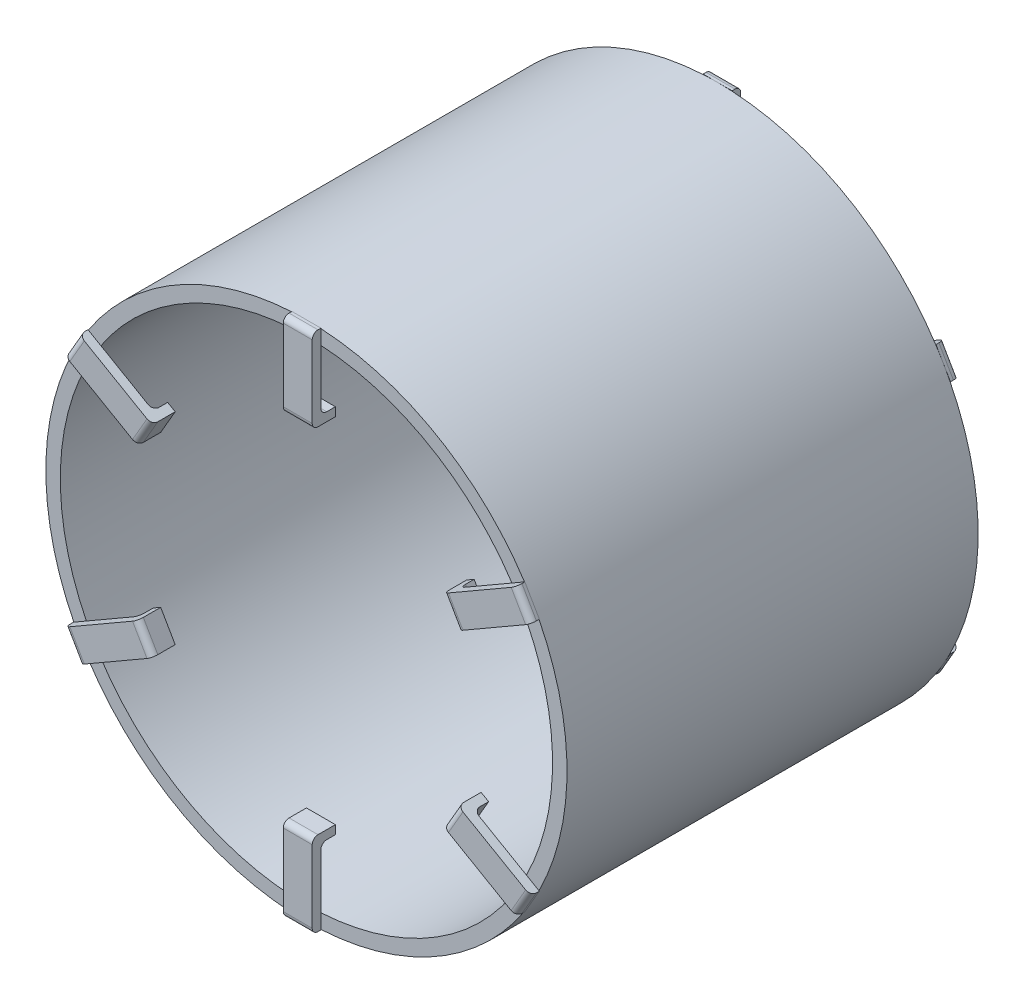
ISO-10303-21;
HEADER;
FILE_DESCRIPTION(('STEP AP214'),'2;1');
FILE_NAME('part.step','',(''),(''),'','','');
FILE_SCHEMA(('AUTOMOTIVE_DESIGN { 1 0 10303 214 1 1 1 1 }'));
ENDSEC;
DATA;
#1=APPLICATION_CONTEXT('core data for automotive mechanical design processes');
#2=APPLICATION_PROTOCOL_DEFINITION('international standard','automotive_design',2000,#1);
#3=PRODUCT_CONTEXT('',#1,'mechanical');
#4=PRODUCT('Part','Part','',(#3));
#5=PRODUCT_RELATED_PRODUCT_CATEGORY('part','',(#4));
#6=PRODUCT_DEFINITION_FORMATION('','',#4);
#7=PRODUCT_DEFINITION_CONTEXT('part definition',#1,'design');
#8=PRODUCT_DEFINITION('design','',#6,#7);
#9=PRODUCT_DEFINITION_SHAPE('','',#8);
#10=(LENGTH_UNIT() NAMED_UNIT(*) SI_UNIT(.MILLI.,.METRE.));
#11=(NAMED_UNIT(*) PLANE_ANGLE_UNIT() SI_UNIT($,.RADIAN.));
#12=(NAMED_UNIT(*) SI_UNIT($,.STERADIAN.) SOLID_ANGLE_UNIT());
#13=UNCERTAINTY_MEASURE_WITH_UNIT(LENGTH_MEASURE(1.E-05),#10,'distance_accuracy_value','');
#14=(GEOMETRIC_REPRESENTATION_CONTEXT(3) GLOBAL_UNCERTAINTY_ASSIGNED_CONTEXT((#13)) GLOBAL_UNIT_ASSIGNED_CONTEXT((#10,
#11,#12)) REPRESENTATION_CONTEXT('',''));
#15=CARTESIAN_POINT('',(0.,0.,0.));
#16=DIRECTION('',(0.,0.,1.));
#17=DIRECTION('',(1.,0.,0.));
#18=AXIS2_PLACEMENT_3D('',#15,#16,#17);
#19=CARTESIAN_POINT('',(0.,0.,-3.55));
#20=DIRECTION('',(0.,0.,1.));
#21=DIRECTION('',(1.,0.,0.));
#22=AXIS2_PLACEMENT_3D('',#19,#20,#21);
#23=PLANE('',#22);
#24=DIRECTION('',(-0.866025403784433,0.50000000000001,0.));
#25=VECTOR('',#24,1.);
#26=CARTESIAN_POINT('',(-2.89628129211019,1.38349364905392,-3.55));
#27=LINE('',#26,#25);
#28=CARTESIAN_POINT('',(-3.79923461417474,1.90481399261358,-3.55));
#29=VERTEX_POINT('',#28);
#30=CARTESIAN_POINT('',(-4.01609560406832,2.03001874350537,-3.55));
#31=VERTEX_POINT('',#30);
#32=EDGE_CURVE('E2142',#29,#31,#27,.T.);
#33=ORIENTED_EDGE('',*,*,#32,.F.);
#34=CARTESIAN_POINT('',(0.,0.,-3.55));
#35=DIRECTION('',(0.,0.,1.));
#36=DIRECTION('',(1.,0.,0.));
#37=AXIS2_PLACEMENT_3D('',#34,#35,#36);
#38=CIRCLE('',#37,4.25);
#39=CARTESIAN_POINT('',(-3.79923461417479,-1.9048139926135,-3.55));
#40=VERTEX_POINT('',#39);
#41=EDGE_CURVE('E1800',#29,#40,#38,.T.);
#42=ORIENTED_EDGE('',*,*,#41,.T.);
#43=DIRECTION('',(-0.866025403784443,-0.499999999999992,0.));
#44=VECTOR('',#43,1.);
#45=CARTESIAN_POINT('',(-2.89628129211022,-1.38349364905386,-3.55));
#46=LINE('',#45,#44);
#47=CARTESIAN_POINT('',(-4.01609560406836,-2.03001874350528,-3.55));
#48=VERTEX_POINT('',#47);
#49=EDGE_CURVE('E1289',#40,#48,#46,.T.);
#50=ORIENTED_EDGE('',*,*,#49,.T.);
#51=CARTESIAN_POINT('',(0.,0.,-3.55));
#52=DIRECTION('',(0.,0.,1.));
#53=DIRECTION('',(1.,0.,0.));
#54=AXIS2_PLACEMENT_3D('',#51,#52,#53);
#55=CIRCLE('',#54,4.5);
#56=EDGE_CURVE('E1811',#31,#48,#55,.T.);
#57=ORIENTED_EDGE('',*,*,#56,.F.);
#58=EDGE_LOOP('',(#33,#42,#50,#57));
#59=FACE_BOUND('',#58,.T.);
#60=ADVANCED_FACE('F362',(#59),#23,.F.);
#61=DIRECTION('',(-0.866025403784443,-0.499999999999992,0.));
#62=VECTOR('',#61,1.);
#63=CARTESIAN_POINT('',(-2.64628129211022,-1.81650635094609,-3.55));
#64=LINE('',#63,#62);
#65=CARTESIAN_POINT('',(-3.54923461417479,-2.33782669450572,-3.55));
#66=VERTEX_POINT('',#65);
#67=CARTESIAN_POINT('',(-3.76609560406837,-2.4630314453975,-3.55));
#68=VERTEX_POINT('',#67);
#69=EDGE_CURVE('E1270',#66,#68,#64,.T.);
#70=ORIENTED_EDGE('',*,*,#69,.F.);
#71=CARTESIAN_POINT('',(-0.25000000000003,-4.24264068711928,-3.55));
#72=VERTEX_POINT('',#71);
#73=EDGE_CURVE('E2158',#66,#72,#38,.T.);
#74=ORIENTED_EDGE('',*,*,#73,.T.);
#75=DIRECTION('',(0.,-1.,0.));
#76=VECTOR('',#75,1.);
#77=CARTESIAN_POINT('',(-0.250000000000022,-3.2,-3.55));
#78=LINE('',#77,#76);
#79=CARTESIAN_POINT('',(-0.250000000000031,-4.49305018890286,-3.55));
#80=VERTEX_POINT('',#79);
#81=EDGE_CURVE('E1338',#72,#80,#78,.T.);
#82=ORIENTED_EDGE('',*,*,#81,.T.);
#83=EDGE_CURVE('E3687',#68,#80,#55,.T.);
#84=ORIENTED_EDGE('',*,*,#83,.F.);
#85=EDGE_LOOP('',(#70,#74,#82,#84));
#86=FACE_BOUND('',#85,.T.);
#87=ADVANCED_FACE('F2197',(#86),#23,.F.);
#88=DIRECTION('',(0.,-1.,0.));
#89=VECTOR('',#88,1.);
#90=CARTESIAN_POINT('',(0.249999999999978,-3.2,-3.55));
#91=LINE('',#90,#89);
#92=CARTESIAN_POINT('',(0.24999999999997,-4.24264068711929,-3.55));
#93=VERTEX_POINT('',#92);
#94=CARTESIAN_POINT('',(0.249999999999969,-4.49305018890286,-3.55));
#95=VERTEX_POINT('',#94);
#96=EDGE_CURVE('E1319',#93,#95,#91,.T.);
#97=ORIENTED_EDGE('',*,*,#96,.F.);
#98=CARTESIAN_POINT('',(3.54923461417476,-2.33782669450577,-3.55));
#99=VERTEX_POINT('',#98);
#100=EDGE_CURVE('E2177',#93,#99,#38,.T.);
#101=ORIENTED_EDGE('',*,*,#100,.T.);
#102=DIRECTION('',(0.866025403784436,-0.500000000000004,0.));
#103=VECTOR('',#102,1.);
#104=CARTESIAN_POINT('',(2.6462812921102,-1.81650635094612,-3.55));
#105=LINE('',#104,#103);
#106=CARTESIAN_POINT('',(3.76609560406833,-2.46303144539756,-3.55));
#107=VERTEX_POINT('',#106);
#108=EDGE_CURVE('E1387',#99,#107,#105,.T.);
#109=ORIENTED_EDGE('',*,*,#108,.T.);
#110=EDGE_CURVE('E2331',#95,#107,#55,.T.);
#111=ORIENTED_EDGE('',*,*,#110,.F.);
#112=EDGE_LOOP('',(#97,#101,#109,#111));
#113=FACE_BOUND('',#112,.T.);
#114=ADVANCED_FACE('F2301',(#113),#23,.F.);
#115=DIRECTION('',(0.866025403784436,-0.500000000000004,0.));
#116=VECTOR('',#115,1.);
#117=CARTESIAN_POINT('',(2.8962812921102,-1.3834936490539,-3.55));
#118=LINE('',#117,#116);
#119=CARTESIAN_POINT('',(3.79923461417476,-1.90481399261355,-3.55));
#120=VERTEX_POINT('',#119);
#121=CARTESIAN_POINT('',(4.01609560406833,-2.03001874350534,-3.55));
#122=VERTEX_POINT('',#121);
#123=EDGE_CURVE('E1368',#120,#122,#118,.T.);
#124=ORIENTED_EDGE('',*,*,#123,.F.);
#125=CARTESIAN_POINT('',(3.79923461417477,1.90481399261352,-3.55));
#126=VERTEX_POINT('',#125);
#127=EDGE_CURVE('E2165',#120,#126,#38,.T.);
#128=ORIENTED_EDGE('',*,*,#127,.T.);
#129=DIRECTION('',(0.86602540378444,0.499999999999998,0.));
#130=VECTOR('',#129,1.);
#131=CARTESIAN_POINT('',(2.89628129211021,1.38349364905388,-3.55));
#132=LINE('',#131,#130);
#133=CARTESIAN_POINT('',(4.01609560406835,2.03001874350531,-3.55));
#134=VERTEX_POINT('',#133);
#135=EDGE_CURVE('E1436',#126,#134,#132,.T.);
#136=ORIENTED_EDGE('',*,*,#135,.T.);
#137=EDGE_CURVE('E3688',#122,#134,#55,.T.);
#138=ORIENTED_EDGE('',*,*,#137,.F.);
#139=EDGE_LOOP('',(#124,#128,#136,#138));
#140=FACE_BOUND('',#139,.T.);
#141=ADVANCED_FACE('F2315',(#140),#23,.F.);
#142=DIRECTION('',(0.86602540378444,0.499999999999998,0.));
#143=VECTOR('',#142,1.);
#144=CARTESIAN_POINT('',(2.64628129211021,1.8165063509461,-3.55));
#145=LINE('',#144,#143);
#146=CARTESIAN_POINT('',(3.54923461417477,2.33782669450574,-3.55));
#147=VERTEX_POINT('',#146);
#148=CARTESIAN_POINT('',(3.76609560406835,2.46303144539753,-3.55));
#149=VERTEX_POINT('',#148);
#150=EDGE_CURVE('E1417',#147,#149,#145,.T.);
#151=ORIENTED_EDGE('',*,*,#150,.F.);
#152=CARTESIAN_POINT('',(0.25,4.24264068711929,-3.55));
#153=VERTEX_POINT('',#152);
#154=EDGE_CURVE('E1794',#147,#153,#38,.T.);
#155=ORIENTED_EDGE('',*,*,#154,.T.);
#156=DIRECTION('',(0.,1.,0.));
#157=VECTOR('',#156,1.);
#158=CARTESIAN_POINT('',(0.25,3.2,-3.55));
#159=LINE('',#158,#157);
#160=CARTESIAN_POINT('',(0.25,4.49305018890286,-3.55));
#161=VERTEX_POINT('',#160);
#162=EDGE_CURVE('E1486',#153,#161,#159,.T.);
#163=ORIENTED_EDGE('',*,*,#162,.T.);
#164=EDGE_CURVE('E1804',#149,#161,#55,.T.);
#165=ORIENTED_EDGE('',*,*,#164,.F.);
#166=EDGE_LOOP('',(#151,#155,#163,#165));
#167=FACE_BOUND('',#166,.T.);
#168=ADVANCED_FACE('F2305',(#167),#23,.F.);
#169=CARTESIAN_POINT('',(0.,0.,3.55));
#170=DIRECTION('',(0.,0.,1.));
#171=DIRECTION('',(1.,0.,0.));
#172=AXIS2_PLACEMENT_3D('',#169,#170,#171);
#173=PLANE('',#172);
#174=CARTESIAN_POINT('',(0.,0.,3.55));
#175=DIRECTION('',(0.,0.,1.));
#176=DIRECTION('',(1.,0.,0.));
#177=AXIS2_PLACEMENT_3D('',#174,#175,#176);
#178=CIRCLE('',#177,4.25);
#179=CARTESIAN_POINT('',(-3.79923461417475,1.90481399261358,3.55));
#180=VERTEX_POINT('',#179);
#181=CARTESIAN_POINT('',(-3.79923461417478,-1.9048139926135,3.55));
#182=VERTEX_POINT('',#181);
#183=EDGE_CURVE('E1806',#180,#182,#178,.T.);
#184=ORIENTED_EDGE('',*,*,#183,.F.);
#185=DIRECTION('',(-0.866025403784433,0.50000000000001,0.));
#186=VECTOR('',#185,1.);
#187=CARTESIAN_POINT('',(-2.89628129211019,1.38349364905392,3.55));
#188=LINE('',#187,#186);
#189=CARTESIAN_POINT('',(-4.01609560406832,2.03001874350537,3.55));
#190=VERTEX_POINT('',#189);
#191=EDGE_CURVE('E1516',#180,#190,#188,.T.);
#192=ORIENTED_EDGE('',*,*,#191,.T.);
#193=CARTESIAN_POINT('',(0.,0.,3.55));
#194=DIRECTION('',(0.,0.,1.));
#195=DIRECTION('',(1.,0.,0.));
#196=AXIS2_PLACEMENT_3D('',#193,#194,#195);
#197=CIRCLE('',#196,4.5);
#198=CARTESIAN_POINT('',(-4.01609560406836,-2.03001874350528,3.55));
#199=VERTEX_POINT('',#198);
#200=EDGE_CURVE('E1816',#190,#199,#197,.T.);
#201=ORIENTED_EDGE('',*,*,#200,.T.);
#202=DIRECTION('',(-0.866025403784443,-0.499999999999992,0.));
#203=VECTOR('',#202,1.);
#204=CARTESIAN_POINT('',(-2.89628129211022,-1.38349364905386,3.55));
#205=LINE('',#204,#203);
#206=EDGE_CURVE('E1580',#182,#199,#205,.T.);
#207=ORIENTED_EDGE('',*,*,#206,.F.);
#208=EDGE_LOOP('',(#184,#192,#201,#207));
#209=FACE_BOUND('',#208,.T.);
#210=ADVANCED_FACE('F2314',(#209),#173,.T.);
#211=CARTESIAN_POINT('',(-3.54923461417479,-2.33782669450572,3.55));
#212=VERTEX_POINT('',#211);
#213=CARTESIAN_POINT('',(-0.25000000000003,-4.24264068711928,3.55));
#214=VERTEX_POINT('',#213);
#215=EDGE_CURVE('E2903',#212,#214,#178,.T.);
#216=ORIENTED_EDGE('',*,*,#215,.F.);
#217=DIRECTION('',(-0.866025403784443,-0.499999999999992,0.));
#218=VECTOR('',#217,1.);
#219=CARTESIAN_POINT('',(-2.64628129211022,-1.81650635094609,3.55));
#220=LINE('',#219,#218);
#221=CARTESIAN_POINT('',(-3.76609560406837,-2.4630314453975,3.55));
#222=VERTEX_POINT('',#221);
#223=EDGE_CURVE('E1562',#212,#222,#220,.T.);
#224=ORIENTED_EDGE('',*,*,#223,.T.);
#225=CARTESIAN_POINT('',(-0.250000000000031,-4.49305018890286,3.55));
#226=VERTEX_POINT('',#225);
#227=EDGE_CURVE('E2931',#222,#226,#197,.T.);
#228=ORIENTED_EDGE('',*,*,#227,.T.);
#229=DIRECTION('',(0.,-1.,0.));
#230=VECTOR('',#229,1.);
#231=CARTESIAN_POINT('',(-0.250000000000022,-3.2,3.55));
#232=LINE('',#231,#230);
#233=EDGE_CURVE('E1627',#214,#226,#232,.T.);
#234=ORIENTED_EDGE('',*,*,#233,.F.);
#235=EDGE_LOOP('',(#216,#224,#228,#234));
#236=FACE_BOUND('',#235,.T.);
#237=ADVANCED_FACE('F2320',(#236),#173,.T.);
#238=CARTESIAN_POINT('',(0.24999999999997,-4.24264068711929,3.55));
#239=VERTEX_POINT('',#238);
#240=CARTESIAN_POINT('',(3.54923461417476,-2.33782669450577,3.55));
#241=VERTEX_POINT('',#240);
#242=EDGE_CURVE('E2910',#239,#241,#178,.T.);
#243=ORIENTED_EDGE('',*,*,#242,.F.);
#244=DIRECTION('',(0.,-1.,0.));
#245=VECTOR('',#244,1.);
#246=CARTESIAN_POINT('',(0.249999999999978,-3.2,3.55));
#247=LINE('',#246,#245);
#248=CARTESIAN_POINT('',(0.249999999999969,-4.49305018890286,3.55));
#249=VERTEX_POINT('',#248);
#250=EDGE_CURVE('E1609',#239,#249,#247,.T.);
#251=ORIENTED_EDGE('',*,*,#250,.T.);
#252=CARTESIAN_POINT('',(3.76609560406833,-2.46303144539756,3.55));
#253=VERTEX_POINT('',#252);
#254=EDGE_CURVE('E2967',#249,#253,#197,.T.);
#255=ORIENTED_EDGE('',*,*,#254,.T.);
#256=DIRECTION('',(0.866025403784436,-0.500000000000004,0.));
#257=VECTOR('',#256,1.);
#258=CARTESIAN_POINT('',(2.6462812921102,-1.81650635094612,3.55));
#259=LINE('',#258,#257);
#260=EDGE_CURVE('E1674',#241,#253,#259,.T.);
#261=ORIENTED_EDGE('',*,*,#260,.F.);
#262=EDGE_LOOP('',(#243,#251,#255,#261));
#263=FACE_BOUND('',#262,.T.);
#264=ADVANCED_FACE('F2965',(#263),#173,.T.);
#265=CARTESIAN_POINT('',(3.79923461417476,-1.90481399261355,3.55));
#266=VERTEX_POINT('',#265);
#267=CARTESIAN_POINT('',(3.79923461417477,1.90481399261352,3.55));
#268=VERTEX_POINT('',#267);
#269=EDGE_CURVE('E2904',#266,#268,#178,.T.);
#270=ORIENTED_EDGE('',*,*,#269,.F.);
#271=DIRECTION('',(0.866025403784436,-0.500000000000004,0.));
#272=VECTOR('',#271,1.);
#273=CARTESIAN_POINT('',(2.8962812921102,-1.3834936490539,3.55));
#274=LINE('',#273,#272);
#275=CARTESIAN_POINT('',(4.01609560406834,-2.03001874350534,3.55));
#276=VERTEX_POINT('',#275);
#277=EDGE_CURVE('E1656',#266,#276,#274,.T.);
#278=ORIENTED_EDGE('',*,*,#277,.T.);
#279=CARTESIAN_POINT('',(4.01609560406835,2.03001874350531,3.55));
#280=VERTEX_POINT('',#279);
#281=EDGE_CURVE('E3039',#276,#280,#197,.T.);
#282=ORIENTED_EDGE('',*,*,#281,.T.);
#283=DIRECTION('',(0.86602540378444,0.499999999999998,0.));
#284=VECTOR('',#283,1.);
#285=CARTESIAN_POINT('',(2.89628129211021,1.38349364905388,3.55));
#286=LINE('',#285,#284);
#287=EDGE_CURVE('E1721',#268,#280,#286,.T.);
#288=ORIENTED_EDGE('',*,*,#287,.F.);
#289=EDGE_LOOP('',(#270,#278,#282,#288));
#290=FACE_BOUND('',#289,.T.);
#291=ADVANCED_FACE('F3006',(#290),#173,.T.);
#292=CARTESIAN_POINT('',(3.54923461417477,2.33782669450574,3.55));
#293=VERTEX_POINT('',#292);
#294=CARTESIAN_POINT('',(0.25,4.24264068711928,3.55));
#295=VERTEX_POINT('',#294);
#296=EDGE_CURVE('E1798',#293,#295,#178,.T.);
#297=ORIENTED_EDGE('',*,*,#296,.F.);
#298=DIRECTION('',(0.86602540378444,0.499999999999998,0.));
#299=VECTOR('',#298,1.);
#300=CARTESIAN_POINT('',(2.64628129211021,1.8165063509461,3.55));
#301=LINE('',#300,#299);
#302=CARTESIAN_POINT('',(3.76609560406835,2.46303144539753,3.55));
#303=VERTEX_POINT('',#302);
#304=EDGE_CURVE('E1703',#293,#303,#301,.T.);
#305=ORIENTED_EDGE('',*,*,#304,.T.);
#306=CARTESIAN_POINT('',(0.25,4.49305018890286,3.55));
#307=VERTEX_POINT('',#306);
#308=EDGE_CURVE('E1809',#303,#307,#197,.T.);
#309=ORIENTED_EDGE('',*,*,#308,.T.);
#310=DIRECTION('',(0.,1.,0.));
#311=VECTOR('',#310,1.);
#312=CARTESIAN_POINT('',(0.25,3.2,3.55));
#313=LINE('',#312,#311);
#314=EDGE_CURVE('E1769',#295,#307,#313,.T.);
#315=ORIENTED_EDGE('',*,*,#314,.F.);
#316=EDGE_LOOP('',(#297,#305,#309,#315));
#317=FACE_BOUND('',#316,.T.);
#318=ADVANCED_FACE('F2312',(#317),#173,.T.);
#319=DIRECTION('',(-0.866025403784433,0.50000000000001,0.));
#320=VECTOR('',#319,1.);
#321=CARTESIAN_POINT('',(-2.64628129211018,1.81650635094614,3.55));
#322=LINE('',#321,#320);
#323=CARTESIAN_POINT('',(-3.54923461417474,2.33782669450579,3.55));
#324=VERTEX_POINT('',#323);
#325=CARTESIAN_POINT('',(-3.76609560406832,2.46303144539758,3.55));
#326=VERTEX_POINT('',#325);
#327=EDGE_CURVE('E1533',#324,#326,#322,.T.);
#328=ORIENTED_EDGE('',*,*,#327,.F.);
#329=CARTESIAN_POINT('',(-0.25,4.24264068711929,3.55));
#330=VERTEX_POINT('',#329);
#331=EDGE_CURVE('E1805',#330,#324,#178,.T.);
#332=ORIENTED_EDGE('',*,*,#331,.F.);
#333=DIRECTION('',(0.,1.,0.));
#334=VECTOR('',#333,1.);
#335=CARTESIAN_POINT('',(-0.25,3.2,3.55));
#336=LINE('',#335,#334);
#337=CARTESIAN_POINT('',(-0.25,4.49305018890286,3.55));
#338=VERTEX_POINT('',#337);
#339=EDGE_CURVE('E1750',#330,#338,#336,.T.);
#340=ORIENTED_EDGE('',*,*,#339,.T.);
#341=EDGE_CURVE('E1815',#338,#326,#197,.T.);
#342=ORIENTED_EDGE('',*,*,#341,.T.);
#343=EDGE_LOOP('',(#328,#332,#340,#342));
#344=FACE_BOUND('',#343,.T.);
#345=ADVANCED_FACE('F2304',(#344),#173,.T.);
#346=CARTESIAN_POINT('',(-0.25,4.24264068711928,-3.55));
#347=VERTEX_POINT('',#346);
#348=CARTESIAN_POINT('',(-3.54923461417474,2.33782669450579,-3.55));
#349=VERTEX_POINT('',#348);
#350=EDGE_CURVE('E1799',#347,#349,#38,.T.);
#351=ORIENTED_EDGE('',*,*,#350,.T.);
#352=DIRECTION('',(-0.866025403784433,0.50000000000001,0.));
#353=VECTOR('',#352,1.);
#354=CARTESIAN_POINT('',(-2.64628129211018,1.81650635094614,-3.55));
#355=LINE('',#354,#353);
#356=CARTESIAN_POINT('',(-3.76609560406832,2.46303144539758,-3.55));
#357=VERTEX_POINT('',#356);
#358=EDGE_CURVE('E1249',#349,#357,#355,.T.);
#359=ORIENTED_EDGE('',*,*,#358,.T.);
#360=CARTESIAN_POINT('',(-0.25,4.49305018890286,-3.55));
#361=VERTEX_POINT('',#360);
#362=EDGE_CURVE('E1810',#361,#357,#55,.T.);
#363=ORIENTED_EDGE('',*,*,#362,.F.);
#364=DIRECTION('',(0.,1.,0.));
#365=VECTOR('',#364,1.);
#366=CARTESIAN_POINT('',(-0.25,3.2,-3.55));
#367=LINE('',#366,#365);
#368=EDGE_CURVE('E1466',#347,#361,#367,.T.);
#369=ORIENTED_EDGE('',*,*,#368,.F.);
#370=EDGE_LOOP('',(#351,#359,#363,#369));
#371=FACE_BOUND('',#370,.T.);
#372=ADVANCED_FACE('F2160',(#371),#23,.F.);
#373=CARTESIAN_POINT('',(0.,0.,3.55));
#374=DIRECTION('',(0.,0.,-1.));
#375=DIRECTION('',(-1.,0.,0.));
#376=AXIS2_PLACEMENT_3D('',#373,#374,#375);
#377=CYLINDRICAL_SURFACE('',#376,4.5);
#378=CARTESIAN_POINT('',(0.,4.5,3.55));
#379=VERTEX_POINT('',#378);
#380=EDGE_CURVE('E1812',#307,#379,#197,.T.);
#381=ORIENTED_EDGE('',*,*,#380,.F.);
#382=ORIENTED_EDGE('',*,*,#308,.F.);
#383=CARTESIAN_POINT('',(0.,0.,3.55));
#384=DIRECTION('',(0.,0.,1.));
#385=DIRECTION('',(1.,0.,0.));
#386=AXIS2_PLACEMENT_3D('',#383,#384,#385);
#387=CIRCLE('',#386,4.5);
#388=CARTESIAN_POINT('',(3.89711431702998,2.24999999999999,3.55));
#389=VERTEX_POINT('',#388);
#390=EDGE_CURVE('E1744',#389,#303,#387,.T.);
#391=ORIENTED_EDGE('',*,*,#390,.F.);
#392=EDGE_CURVE('E1746',#280,#389,#387,.T.);
#393=ORIENTED_EDGE('',*,*,#392,.F.);
#394=ORIENTED_EDGE('',*,*,#281,.F.);
#395=CARTESIAN_POINT('',(0.,0.,3.55));
#396=DIRECTION('',(0.,0.,1.));
#397=DIRECTION('',(1.,0.,0.));
#398=AXIS2_PLACEMENT_3D('',#395,#396,#397);
#399=CIRCLE('',#398,4.5);
#400=CARTESIAN_POINT('',(3.89711431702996,-2.25000000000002,3.55));
#401=VERTEX_POINT('',#400);
#402=EDGE_CURVE('E1697',#401,#276,#399,.T.);
#403=ORIENTED_EDGE('',*,*,#402,.F.);
#404=EDGE_CURVE('E1699',#253,#401,#399,.T.);
#405=ORIENTED_EDGE('',*,*,#404,.F.);
#406=ORIENTED_EDGE('',*,*,#254,.F.);
#407=CARTESIAN_POINT('',(0.,0.,3.55));
#408=DIRECTION('',(0.,0.,1.));
#409=DIRECTION('',(1.,0.,0.));
#410=AXIS2_PLACEMENT_3D('',#407,#408,#409);
#411=CIRCLE('',#410,4.5);
#412=CARTESIAN_POINT('',(0.,-4.5,3.55));
#413=VERTEX_POINT('',#412);
#414=EDGE_CURVE('E1650',#413,#249,#411,.T.);
#415=ORIENTED_EDGE('',*,*,#414,.F.);
#416=EDGE_CURVE('E1652',#226,#413,#411,.T.);
#417=ORIENTED_EDGE('',*,*,#416,.F.);
#418=ORIENTED_EDGE('',*,*,#227,.F.);
#419=CARTESIAN_POINT('',(0.,0.,3.55));
#420=DIRECTION('',(0.,0.,1.));
#421=DIRECTION('',(1.,0.,0.));
#422=AXIS2_PLACEMENT_3D('',#419,#420,#421);
#423=CIRCLE('',#422,4.5);
#424=CARTESIAN_POINT('',(-3.89711431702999,-2.24999999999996,3.55));
#425=VERTEX_POINT('',#424);
#426=EDGE_CURVE('E1603',#425,#222,#423,.T.);
#427=ORIENTED_EDGE('',*,*,#426,.F.);
#428=EDGE_CURVE('E1605',#199,#425,#423,.T.);
#429=ORIENTED_EDGE('',*,*,#428,.F.);
#430=ORIENTED_EDGE('',*,*,#200,.F.);
#431=CARTESIAN_POINT('',(0.,0.,3.55));
#432=DIRECTION('',(0.,0.,1.));
#433=DIRECTION('',(1.,0.,0.));
#434=AXIS2_PLACEMENT_3D('',#431,#432,#433);
#435=CIRCLE('',#434,4.5);
#436=CARTESIAN_POINT('',(-3.89711431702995,2.25000000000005,3.55));
#437=VERTEX_POINT('',#436);
#438=EDGE_CURVE('E1556',#437,#190,#435,.T.);
#439=ORIENTED_EDGE('',*,*,#438,.F.);
#440=EDGE_CURVE('E1558',#326,#437,#435,.T.);
#441=ORIENTED_EDGE('',*,*,#440,.F.);
#442=ORIENTED_EDGE('',*,*,#341,.F.);
#443=CARTESIAN_POINT('',(0.,0.,3.55));
#444=DIRECTION('',(0.,0.,1.));
#445=DIRECTION('',(1.,0.,0.));
#446=AXIS2_PLACEMENT_3D('',#443,#444,#445);
#447=CIRCLE('',#446,4.5);
#448=EDGE_CURVE('E1792',#379,#338,#447,.T.);
#449=ORIENTED_EDGE('',*,*,#448,.F.);
#450=EDGE_LOOP('',(#381,#382,#391,#393,#394,#403,#405,#406,#415,#417,#418,#427,#429,#430,#439,
#441,#442,#449));
#451=FACE_BOUND('',#450,.T.);
#452=CARTESIAN_POINT('',(0.,4.5,-3.55));
#453=VERTEX_POINT('',#452);
#454=EDGE_CURVE('E1807',#161,#453,#55,.T.);
#455=ORIENTED_EDGE('',*,*,#454,.T.);
#456=CARTESIAN_POINT('',(0.,0.,-3.55));
#457=DIRECTION('',(0.,0.,1.));
#458=DIRECTION('',(1.,0.,0.));
#459=AXIS2_PLACEMENT_3D('',#456,#457,#458);
#460=CIRCLE('',#459,4.5);
#461=EDGE_CURVE('E1509',#453,#361,#460,.T.);
#462=ORIENTED_EDGE('',*,*,#461,.T.);
#463=ORIENTED_EDGE('',*,*,#362,.T.);
#464=CARTESIAN_POINT('',(0.,0.,-3.55));
#465=DIRECTION('',(0.,0.,1.));
#466=DIRECTION('',(1.,0.,0.));
#467=AXIS2_PLACEMENT_3D('',#464,#465,#466);
#468=CIRCLE('',#467,4.5);
#469=CARTESIAN_POINT('',(-3.89711431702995,2.25000000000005,-3.55));
#470=VERTEX_POINT('',#469);
#471=EDGE_CURVE('E1266',#357,#470,#468,.T.);
#472=ORIENTED_EDGE('',*,*,#471,.T.);
#473=EDGE_CURVE('E1220',#470,#31,#468,.T.);
#474=ORIENTED_EDGE('',*,*,#473,.T.);
#475=ORIENTED_EDGE('',*,*,#56,.T.);
#476=CARTESIAN_POINT('',(0.,0.,-3.55));
#477=DIRECTION('',(0.,0.,1.));
#478=DIRECTION('',(1.,0.,0.));
#479=AXIS2_PLACEMENT_3D('',#476,#477,#478);
#480=CIRCLE('',#479,4.5);
#481=CARTESIAN_POINT('',(-3.89711431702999,-2.24999999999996,-3.55));
#482=VERTEX_POINT('',#481);
#483=EDGE_CURVE('E1315',#48,#482,#480,.T.);
#484=ORIENTED_EDGE('',*,*,#483,.T.);
#485=EDGE_CURVE('E1312',#482,#68,#480,.T.);
#486=ORIENTED_EDGE('',*,*,#485,.T.);
#487=ORIENTED_EDGE('',*,*,#83,.T.);
#488=CARTESIAN_POINT('',(0.,0.,-3.55));
#489=DIRECTION('',(0.,0.,1.));
#490=DIRECTION('',(1.,0.,0.));
#491=AXIS2_PLACEMENT_3D('',#488,#489,#490);
#492=CIRCLE('',#491,4.5);
#493=CARTESIAN_POINT('',(0.,-4.5,-3.55));
#494=VERTEX_POINT('',#493);
#495=EDGE_CURVE('E1364',#80,#494,#492,.T.);
#496=ORIENTED_EDGE('',*,*,#495,.T.);
#497=EDGE_CURVE('E1361',#494,#95,#492,.T.);
#498=ORIENTED_EDGE('',*,*,#497,.T.);
#499=ORIENTED_EDGE('',*,*,#110,.T.);
#500=CARTESIAN_POINT('',(0.,0.,-3.55));
#501=DIRECTION('',(0.,0.,1.));
#502=DIRECTION('',(1.,0.,0.));
#503=AXIS2_PLACEMENT_3D('',#500,#501,#502);
#504=CIRCLE('',#503,4.5);
#505=CARTESIAN_POINT('',(3.89711431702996,-2.25000000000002,-3.55));
#506=VERTEX_POINT('',#505);
#507=EDGE_CURVE('E1413',#107,#506,#504,.T.);
#508=ORIENTED_EDGE('',*,*,#507,.T.);
#509=EDGE_CURVE('E1410',#506,#122,#504,.T.);
#510=ORIENTED_EDGE('',*,*,#509,.T.);
#511=ORIENTED_EDGE('',*,*,#137,.T.);
#512=CARTESIAN_POINT('',(0.,0.,-3.55));
#513=DIRECTION('',(0.,0.,1.));
#514=DIRECTION('',(1.,0.,0.));
#515=AXIS2_PLACEMENT_3D('',#512,#513,#514);
#516=CIRCLE('',#515,4.5);
#517=CARTESIAN_POINT('',(3.89711431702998,2.24999999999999,-3.55));
#518=VERTEX_POINT('',#517);
#519=EDGE_CURVE('E1462',#134,#518,#516,.T.);
#520=ORIENTED_EDGE('',*,*,#519,.T.);
#521=EDGE_CURVE('E1459',#518,#149,#516,.T.);
#522=ORIENTED_EDGE('',*,*,#521,.T.);
#523=ORIENTED_EDGE('',*,*,#164,.T.);
#524=EDGE_LOOP('',(#455,#462,#463,#472,#474,#475,#484,#486,#487,#496,#498,#499,#508,#510,#511,
#520,#522,#523));
#525=FACE_BOUND('',#524,.T.);
#526=ADVANCED_FACE('F364',(#451,#525),#377,.T.);
#527=CARTESIAN_POINT('',(0.,0.,3.55));
#528=DIRECTION('',(0.,0.,-1.));
#529=DIRECTION('',(-1.,0.,0.));
#530=AXIS2_PLACEMENT_3D('',#527,#528,#529);
#531=CYLINDRICAL_SURFACE('',#530,4.25);
#532=EDGE_CURVE('E1801',#295,#330,#178,.T.);
#533=ORIENTED_EDGE('',*,*,#532,.T.);
#534=ORIENTED_EDGE('',*,*,#331,.T.);
#535=EDGE_CURVE('E2901',#324,#180,#178,.T.);
#536=ORIENTED_EDGE('',*,*,#535,.T.);
#537=ORIENTED_EDGE('',*,*,#183,.T.);
#538=EDGE_CURVE('E2913',#182,#212,#178,.T.);
#539=ORIENTED_EDGE('',*,*,#538,.T.);
#540=ORIENTED_EDGE('',*,*,#215,.T.);
#541=EDGE_CURVE('E2908',#214,#239,#178,.T.);
#542=ORIENTED_EDGE('',*,*,#541,.T.);
#543=ORIENTED_EDGE('',*,*,#242,.T.);
#544=EDGE_CURVE('E2907',#241,#266,#178,.T.);
#545=ORIENTED_EDGE('',*,*,#544,.T.);
#546=ORIENTED_EDGE('',*,*,#269,.T.);
#547=EDGE_CURVE('E2902',#268,#293,#178,.T.);
#548=ORIENTED_EDGE('',*,*,#547,.T.);
#549=ORIENTED_EDGE('',*,*,#296,.T.);
#550=EDGE_LOOP('',(#533,#534,#536,#537,#539,#540,#542,#543,#545,#546,#548,#549));
#551=FACE_BOUND('',#550,.T.);
#552=EDGE_CURVE('E1795',#153,#347,#38,.T.);
#553=ORIENTED_EDGE('',*,*,#552,.F.);
#554=ORIENTED_EDGE('',*,*,#154,.F.);
#555=EDGE_CURVE('E2163',#126,#147,#38,.T.);
#556=ORIENTED_EDGE('',*,*,#555,.F.);
#557=ORIENTED_EDGE('',*,*,#127,.F.);
#558=EDGE_CURVE('E2170',#99,#120,#38,.T.);
#559=ORIENTED_EDGE('',*,*,#558,.F.);
#560=ORIENTED_EDGE('',*,*,#100,.F.);
#561=EDGE_CURVE('E2171',#72,#93,#38,.T.);
#562=ORIENTED_EDGE('',*,*,#561,.F.);
#563=ORIENTED_EDGE('',*,*,#73,.F.);
#564=EDGE_CURVE('E2182',#40,#66,#38,.T.);
#565=ORIENTED_EDGE('',*,*,#564,.F.);
#566=ORIENTED_EDGE('',*,*,#41,.F.);
#567=EDGE_CURVE('E2141',#349,#29,#38,.T.);
#568=ORIENTED_EDGE('',*,*,#567,.F.);
#569=ORIENTED_EDGE('',*,*,#350,.F.);
#570=EDGE_LOOP('',(#553,#554,#556,#557,#559,#560,#562,#563,#565,#566,#568,#569));
#571=FACE_BOUND('',#570,.T.);
#572=ADVANCED_FACE('F2153',(#551,#571),#531,.F.);
#573=CARTESIAN_POINT('',(0.25,3.2,3.55));
#574=DIRECTION('',(0.,0.,1.));
#575=DIRECTION('',(1.,0.,0.));
#576=AXIS2_PLACEMENT_3D('',#573,#574,#575);
#577=PLANE('',#576);
#578=CARTESIAN_POINT('',(0.25,4.5,3.55));
#579=VERTEX_POINT('',#578);
#580=EDGE_CURVE('E1764',#307,#579,#313,.T.);
#581=ORIENTED_EDGE('',*,*,#580,.F.);
#582=ORIENTED_EDGE('',*,*,#380,.T.);
#583=DIRECTION('',(-1.,0.,0.));
#584=VECTOR('',#583,1.);
#585=CARTESIAN_POINT('',(0.25,4.5,3.55));
#586=LINE('',#585,#584);
#587=EDGE_CURVE('E1789',#579,#379,#586,.T.);
#588=ORIENTED_EDGE('',*,*,#587,.F.);
#589=EDGE_LOOP('',(#581,#582,#588));
#590=FACE_BOUND('',#589,.T.);
#591=ADVANCED_FACE('F2845',(#590),#577,.F.);
#592=CARTESIAN_POINT('',(-0.25,4.5,3.55));
#593=VERTEX_POINT('',#592);
#594=EDGE_CURVE('E1788',#379,#593,#586,.T.);
#595=ORIENTED_EDGE('',*,*,#594,.F.);
#596=ORIENTED_EDGE('',*,*,#448,.T.);
#597=EDGE_CURVE('E1751',#338,#593,#336,.T.);
#598=ORIENTED_EDGE('',*,*,#597,.T.);
#599=EDGE_LOOP('',(#595,#596,#598));
#600=FACE_BOUND('',#599,.T.);
#601=ADVANCED_FACE('F2843',(#600),#577,.F.);
#602=CARTESIAN_POINT('',(0.25,3.3,3.55));
#603=VERTEX_POINT('',#602);
#604=EDGE_CURVE('E1765',#603,#295,#313,.T.);
#605=ORIENTED_EDGE('',*,*,#604,.F.);
#606=DIRECTION('',(-1.,0.,0.));
#607=VECTOR('',#606,1.);
#608=CARTESIAN_POINT('',(-0.25,3.3,3.55));
#609=LINE('',#608,#607);
#610=CARTESIAN_POINT('',(-0.25,3.3,3.55));
#611=VERTEX_POINT('',#610);
#612=EDGE_CURVE('E1814',#603,#611,#609,.T.);
#613=ORIENTED_EDGE('',*,*,#612,.T.);
#614=EDGE_CURVE('E1747',#611,#330,#336,.T.);
#615=ORIENTED_EDGE('',*,*,#614,.T.);
#616=ORIENTED_EDGE('',*,*,#532,.F.);
#617=EDGE_LOOP('',(#605,#613,#615,#616));
#618=FACE_BOUND('',#617,.T.);
#619=ADVANCED_FACE('F2840',(#618),#577,.F.);
#620=CARTESIAN_POINT('',(0.25,4.5,3.55));
#621=DIRECTION('',(0.,-1.,0.));
#622=DIRECTION('',(0.,0.,-1.));
#623=AXIS2_PLACEMENT_3D('',#620,#621,#622);
#624=PLANE('',#623);
#625=DIRECTION('',(0.,0.,1.));
#626=VECTOR('',#625,1.);
#627=CARTESIAN_POINT('',(-0.25,4.5,3.55));
#628=LINE('',#627,#626);
#629=CARTESIAN_POINT('',(-0.25,4.5,3.6));
#630=VERTEX_POINT('',#629);
#631=EDGE_CURVE('E1749',#593,#630,#628,.T.);
#632=ORIENTED_EDGE('',*,*,#631,.T.);
#633=DIRECTION('',(-1.,0.,0.));
#634=VECTOR('',#633,1.);
#635=CARTESIAN_POINT('',(0.25,4.5,3.6));
#636=LINE('',#635,#634);
#637=CARTESIAN_POINT('',(0.25,4.5,3.6));
#638=VERTEX_POINT('',#637);
#639=EDGE_CURVE('E1837',#630,#638,#636,.F.);
#640=ORIENTED_EDGE('',*,*,#639,.T.);
#641=DIRECTION('',(0.,0.,1.));
#642=VECTOR('',#641,1.);
#643=CARTESIAN_POINT('',(0.25,4.5,3.55));
#644=LINE('',#643,#642);
#645=EDGE_CURVE('E1768',#579,#638,#644,.T.);
#646=ORIENTED_EDGE('',*,*,#645,.F.);
#647=ORIENTED_EDGE('',*,*,#587,.T.);
#648=ORIENTED_EDGE('',*,*,#594,.T.);
#649=EDGE_LOOP('',(#632,#640,#646,#647,#648));
#650=FACE_BOUND('',#649,.T.);
#651=ADVANCED_FACE('F2836',(#650),#624,.F.);
#652=CARTESIAN_POINT('',(0.25,4.5,3.7));
#653=DIRECTION('',(0.,0.,-1.));
#654=DIRECTION('',(-1.,0.,0.));
#655=AXIS2_PLACEMENT_3D('',#652,#653,#654);
#656=PLANE('',#655);
#657=DIRECTION('',(0.,-1.,0.));
#658=VECTOR('',#657,1.);
#659=CARTESIAN_POINT('',(-0.25,4.5,3.7));
#660=LINE('',#659,#658);
#661=CARTESIAN_POINT('',(-0.25,4.4,3.7));
#662=VERTEX_POINT('',#661);
#663=CARTESIAN_POINT('',(-0.25,3.15,3.7));
#664=VERTEX_POINT('',#663);
#665=EDGE_CURVE('E1754',#662,#664,#660,.T.);
#666=ORIENTED_EDGE('',*,*,#665,.T.);
#667=DIRECTION('',(-1.,0.,0.));
#668=VECTOR('',#667,1.);
#669=CARTESIAN_POINT('',(0.25,3.15,3.7));
#670=LINE('',#669,#668);
#671=CARTESIAN_POINT('',(0.25,3.15,3.7));
#672=VERTEX_POINT('',#671);
#673=EDGE_CURVE('E1831',#664,#672,#670,.F.);
#674=ORIENTED_EDGE('',*,*,#673,.T.);
#675=DIRECTION('',(0.,-1.,0.));
#676=VECTOR('',#675,1.);
#677=CARTESIAN_POINT('',(0.25,4.5,3.7));
#678=LINE('',#677,#676);
#679=CARTESIAN_POINT('',(0.25,4.4,3.7));
#680=VERTEX_POINT('',#679);
#681=EDGE_CURVE('E1772',#680,#672,#678,.T.);
#682=ORIENTED_EDGE('',*,*,#681,.F.);
#683=DIRECTION('',(-1.,0.,0.));
#684=VECTOR('',#683,1.);
#685=CARTESIAN_POINT('',(0.25,4.4,3.7));
#686=LINE('',#685,#684);
#687=EDGE_CURVE('E1828',#680,#662,#686,.T.);
#688=ORIENTED_EDGE('',*,*,#687,.T.);
#689=EDGE_LOOP('',(#666,#674,#682,#688));
#690=FACE_BOUND('',#689,.T.);
#691=ADVANCED_FACE('F2832',(#690),#656,.F.);
#692=CARTESIAN_POINT('',(0.25,3.05,3.7));
#693=DIRECTION('',(0.,1.,0.));
#694=DIRECTION('',(0.,0.,1.));
#695=AXIS2_PLACEMENT_3D('',#692,#693,#694);
#696=PLANE('',#695);
#697=DIRECTION('',(0.,0.,-1.));
#698=VECTOR('',#697,1.);
#699=CARTESIAN_POINT('',(0.25,3.05,3.7));
#700=LINE('',#699,#698);
#701=CARTESIAN_POINT('',(0.25,3.05,3.6));
#702=VERTEX_POINT('',#701);
#703=CARTESIAN_POINT('',(0.25,3.05,3.3));
#704=VERTEX_POINT('',#703);
#705=EDGE_CURVE('E1775',#702,#704,#700,.T.);
#706=ORIENTED_EDGE('',*,*,#705,.F.);
#707=DIRECTION('',(-1.,0.,0.));
#708=VECTOR('',#707,1.);
#709=CARTESIAN_POINT('',(0.25,3.05,3.6));
#710=LINE('',#709,#708);
#711=CARTESIAN_POINT('',(-0.25,3.05,3.6));
#712=VERTEX_POINT('',#711);
#713=EDGE_CURVE('E1821',#702,#712,#710,.T.);
#714=ORIENTED_EDGE('',*,*,#713,.T.);
#715=DIRECTION('',(0.,0.,-1.));
#716=VECTOR('',#715,1.);
#717=CARTESIAN_POINT('',(-0.25,3.05,3.7));
#718=LINE('',#717,#716);
#719=CARTESIAN_POINT('',(-0.25,3.05,3.3));
#720=VERTEX_POINT('',#719);
#721=EDGE_CURVE('E1757',#712,#720,#718,.T.);
#722=ORIENTED_EDGE('',*,*,#721,.T.);
#723=DIRECTION('',(-1.,0.,0.));
#724=VECTOR('',#723,1.);
#725=CARTESIAN_POINT('',(0.25,3.05,3.3));
#726=LINE('',#725,#724);
#727=EDGE_CURVE('E1785',#704,#720,#726,.T.);
#728=ORIENTED_EDGE('',*,*,#727,.F.);
#729=EDGE_LOOP('',(#706,#714,#722,#728));
#730=FACE_BOUND('',#729,.T.);
#731=ADVANCED_FACE('F2828',(#730),#696,.F.);
#732=CARTESIAN_POINT('',(0.25,3.05,3.3));
#733=DIRECTION('',(0.,0.,1.));
#734=DIRECTION('',(1.,0.,0.));
#735=AXIS2_PLACEMENT_3D('',#732,#733,#734);
#736=PLANE('',#735);
#737=DIRECTION('',(0.,1.,0.));
#738=VECTOR('',#737,1.);
#739=CARTESIAN_POINT('',(-0.25,3.05,3.3));
#740=LINE('',#739,#738);
#741=CARTESIAN_POINT('',(-0.25,3.2,3.3));
#742=VERTEX_POINT('',#741);
#743=EDGE_CURVE('E1759',#720,#742,#740,.T.);
#744=ORIENTED_EDGE('',*,*,#743,.T.);
#745=DIRECTION('',(-1.,0.,0.));
#746=VECTOR('',#745,1.);
#747=CARTESIAN_POINT('',(0.25,3.2,3.3));
#748=LINE('',#747,#746);
#749=CARTESIAN_POINT('',(0.25,3.2,3.3));
#750=VERTEX_POINT('',#749);
#751=EDGE_CURVE('E1782',#750,#742,#748,.T.);
#752=ORIENTED_EDGE('',*,*,#751,.F.);
#753=DIRECTION('',(0.,1.,0.));
#754=VECTOR('',#753,1.);
#755=CARTESIAN_POINT('',(0.25,3.05,3.3));
#756=LINE('',#755,#754);
#757=EDGE_CURVE('E1777',#704,#750,#756,.T.);
#758=ORIENTED_EDGE('',*,*,#757,.F.);
#759=ORIENTED_EDGE('',*,*,#727,.T.);
#760=EDGE_LOOP('',(#744,#752,#758,#759));
#761=FACE_BOUND('',#760,.T.);
#762=ADVANCED_FACE('F2824',(#761),#736,.F.);
#763=CARTESIAN_POINT('',(0.25,3.2,3.3));
#764=DIRECTION('',(0.,-1.,0.));
#765=DIRECTION('',(0.,0.,-1.));
#766=AXIS2_PLACEMENT_3D('',#763,#764,#765);
#767=PLANE('',#766);
#768=DIRECTION('',(0.,0.,1.));
#769=VECTOR('',#768,1.);
#770=CARTESIAN_POINT('',(-0.25,3.2,3.3));
#771=LINE('',#770,#769);
#772=CARTESIAN_POINT('',(-0.25,3.2,3.45));
#773=VERTEX_POINT('',#772);
#774=EDGE_CURVE('E1761',#742,#773,#771,.T.);
#775=ORIENTED_EDGE('',*,*,#774,.T.);
#776=DIRECTION('',(-1.,0.,0.));
#777=VECTOR('',#776,1.);
#778=CARTESIAN_POINT('',(0.25,3.2,3.45));
#779=LINE('',#778,#777);
#780=CARTESIAN_POINT('',(0.25,3.2,3.45));
#781=VERTEX_POINT('',#780);
#782=EDGE_CURVE('E1819',#773,#781,#779,.F.);
#783=ORIENTED_EDGE('',*,*,#782,.T.);
#784=DIRECTION('',(0.,0.,1.));
#785=VECTOR('',#784,1.);
#786=CARTESIAN_POINT('',(0.25,3.2,3.3));
#787=LINE('',#786,#785);
#788=EDGE_CURVE('E1779',#750,#781,#787,.T.);
#789=ORIENTED_EDGE('',*,*,#788,.F.);
#790=ORIENTED_EDGE('',*,*,#751,.T.);
#791=EDGE_LOOP('',(#775,#783,#789,#790));
#792=FACE_BOUND('',#791,.T.);
#793=ADVANCED_FACE('F2820',(#792),#767,.F.);
#794=CARTESIAN_POINT('',(0.25,4.5,3.55));
#795=DIRECTION('',(1.,0.,0.));
#796=DIRECTION('',(0.,0.,-1.));
#797=AXIS2_PLACEMENT_3D('',#794,#795,#796);
#798=PLANE('',#797);
#799=ORIENTED_EDGE('',*,*,#681,.T.);
#800=CARTESIAN_POINT('',(0.25,3.15,3.6));
#801=DIRECTION('',(1.,0.,0.));
#802=DIRECTION('',(0.,0.,-1.));
#803=AXIS2_PLACEMENT_3D('',#800,#801,#802);
#804=CIRCLE('',#803,0.1);
#805=EDGE_CURVE('E1835',#672,#702,#804,.T.);
#806=ORIENTED_EDGE('',*,*,#805,.T.);
#807=ORIENTED_EDGE('',*,*,#705,.T.);
#808=ORIENTED_EDGE('',*,*,#757,.T.);
#809=ORIENTED_EDGE('',*,*,#788,.T.);
#810=CARTESIAN_POINT('',(0.25,3.3,3.45));
#811=DIRECTION('',(1.,0.,0.));
#812=DIRECTION('',(0.,0.,-1.));
#813=AXIS2_PLACEMENT_3D('',#810,#811,#812);
#814=CIRCLE('',#813,0.1);
#815=EDGE_CURVE('E1841',#781,#603,#814,.F.);
#816=ORIENTED_EDGE('',*,*,#815,.T.);
#817=ORIENTED_EDGE('',*,*,#604,.T.);
#818=ORIENTED_EDGE('',*,*,#314,.T.);
#819=ORIENTED_EDGE('',*,*,#580,.T.);
#820=ORIENTED_EDGE('',*,*,#645,.T.);
#821=CARTESIAN_POINT('',(0.25,4.4,3.6));
#822=DIRECTION('',(1.,0.,0.));
#823=DIRECTION('',(0.,0.,-1.));
#824=AXIS2_PLACEMENT_3D('',#821,#822,#823);
#825=CIRCLE('',#824,0.1);
#826=EDGE_CURVE('E1833',#638,#680,#825,.T.);
#827=ORIENTED_EDGE('',*,*,#826,.T.);
#828=EDGE_LOOP('',(#799,#806,#807,#808,#809,#816,#817,#818,#819,#820,#827));
#829=FACE_BOUND('',#828,.T.);
#830=ADVANCED_FACE('F2816',(#829),#798,.T.);
#831=CARTESIAN_POINT('',(-0.25,4.5,3.55));
#832=DIRECTION('',(1.,0.,0.));
#833=DIRECTION('',(0.,0.,-1.));
#834=AXIS2_PLACEMENT_3D('',#831,#832,#833);
#835=PLANE('',#834);
#836=ORIENTED_EDGE('',*,*,#721,.F.);
#837=CARTESIAN_POINT('',(-0.25,3.15,3.6));
#838=DIRECTION('',(1.,0.,0.));
#839=DIRECTION('',(0.,0.,-1.));
#840=AXIS2_PLACEMENT_3D('',#837,#838,#839);
#841=CIRCLE('',#840,0.1);
#842=EDGE_CURVE('E1826',#712,#664,#841,.F.);
#843=ORIENTED_EDGE('',*,*,#842,.T.);
#844=ORIENTED_EDGE('',*,*,#665,.F.);
#845=CARTESIAN_POINT('',(-0.25,4.4,3.6));
#846=DIRECTION('',(1.,0.,0.));
#847=DIRECTION('',(0.,0.,-1.));
#848=AXIS2_PLACEMENT_3D('',#845,#846,#847);
#849=CIRCLE('',#848,0.1);
#850=EDGE_CURVE('E1824',#662,#630,#849,.F.);
#851=ORIENTED_EDGE('',*,*,#850,.T.);
#852=ORIENTED_EDGE('',*,*,#631,.F.);
#853=ORIENTED_EDGE('',*,*,#597,.F.);
#854=ORIENTED_EDGE('',*,*,#339,.F.);
#855=ORIENTED_EDGE('',*,*,#614,.F.);
#856=CARTESIAN_POINT('',(-0.25,3.3,3.45));
#857=DIRECTION('',(1.,0.,0.));
#858=DIRECTION('',(0.,0.,-1.));
#859=AXIS2_PLACEMENT_3D('',#856,#857,#858);
#860=CIRCLE('',#859,0.1);
#861=EDGE_CURVE('E1839',#611,#773,#860,.T.);
#862=ORIENTED_EDGE('',*,*,#861,.T.);
#863=ORIENTED_EDGE('',*,*,#774,.F.);
#864=ORIENTED_EDGE('',*,*,#743,.F.);
#865=EDGE_LOOP('',(#836,#843,#844,#851,#852,#853,#854,#855,#862,#863,#864));
#866=FACE_BOUND('',#865,.T.);
#867=ADVANCED_FACE('F2812',(#866),#835,.F.);
#868=CARTESIAN_POINT('',(0.25,3.3,3.45));
#869=DIRECTION('',(1.,0.,0.));
#870=DIRECTION('',(0.,0.,-1.));
#871=AXIS2_PLACEMENT_3D('',#868,#869,#870);
#872=CYLINDRICAL_SURFACE('',#871,0.1);
#873=ORIENTED_EDGE('',*,*,#815,.F.);
#874=ORIENTED_EDGE('',*,*,#782,.F.);
#875=ORIENTED_EDGE('',*,*,#861,.F.);
#876=ORIENTED_EDGE('',*,*,#612,.F.);
#877=EDGE_LOOP('',(#873,#874,#875,#876));
#878=FACE_BOUND('',#877,.T.);
#879=ADVANCED_FACE('F2808',(#878),#872,.F.);
#880=CARTESIAN_POINT('',(0.25,3.15,3.6));
#881=DIRECTION('',(-1.,0.,0.));
#882=DIRECTION('',(0.,0.,1.));
#883=AXIS2_PLACEMENT_3D('',#880,#881,#882);
#884=CYLINDRICAL_SURFACE('',#883,0.1);
#885=ORIENTED_EDGE('',*,*,#805,.F.);
#886=ORIENTED_EDGE('',*,*,#673,.F.);
#887=ORIENTED_EDGE('',*,*,#842,.F.);
#888=ORIENTED_EDGE('',*,*,#713,.F.);
#889=EDGE_LOOP('',(#885,#886,#887,#888));
#890=FACE_BOUND('',#889,.T.);
#891=ADVANCED_FACE('F2804',(#890),#884,.T.);
#892=CARTESIAN_POINT('',(0.25,4.4,3.6));
#893=DIRECTION('',(-1.,0.,0.));
#894=DIRECTION('',(0.,0.,1.));
#895=AXIS2_PLACEMENT_3D('',#892,#893,#894);
#896=CYLINDRICAL_SURFACE('',#895,0.1);
#897=ORIENTED_EDGE('',*,*,#826,.F.);
#898=ORIENTED_EDGE('',*,*,#639,.F.);
#899=ORIENTED_EDGE('',*,*,#850,.F.);
#900=ORIENTED_EDGE('',*,*,#687,.F.);
#901=EDGE_LOOP('',(#897,#898,#899,#900));
#902=FACE_BOUND('',#901,.T.);
#903=ADVANCED_FACE('F2801',(#902),#896,.T.);
#904=CARTESIAN_POINT('',(2.89628129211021,1.38349364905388,3.55));
#905=DIRECTION('',(0.,0.,1.));
#906=DIRECTION('',(1.,0.,0.));
#907=AXIS2_PLACEMENT_3D('',#904,#905,#906);
#908=PLANE('',#907);
#909=CARTESIAN_POINT('',(4.02211431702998,2.03349364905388,3.55));
#910=VERTEX_POINT('',#909);
#911=EDGE_CURVE('E1717',#280,#910,#286,.T.);
#912=ORIENTED_EDGE('',*,*,#911,.F.);
#913=ORIENTED_EDGE('',*,*,#392,.T.);
#914=DIRECTION('',(-0.499999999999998,0.86602540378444,0.));
#915=VECTOR('',#914,1.);
#916=CARTESIAN_POINT('',(4.02211431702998,2.03349364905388,3.55));
#917=LINE('',#916,#915);
#918=EDGE_CURVE('E1741',#910,#389,#917,.T.);
#919=ORIENTED_EDGE('',*,*,#918,.F.);
#920=EDGE_LOOP('',(#912,#913,#919));
#921=FACE_BOUND('',#920,.T.);
#922=ADVANCED_FACE('F2800',(#921),#908,.F.);
#923=CARTESIAN_POINT('',(3.77211431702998,2.4665063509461,3.55));
#924=VERTEX_POINT('',#923);
#925=EDGE_CURVE('E1740',#389,#924,#917,.T.);
#926=ORIENTED_EDGE('',*,*,#925,.F.);
#927=ORIENTED_EDGE('',*,*,#390,.T.);
#928=EDGE_CURVE('E1704',#303,#924,#301,.T.);
#929=ORIENTED_EDGE('',*,*,#928,.T.);
#930=EDGE_LOOP('',(#926,#927,#929));
#931=FACE_BOUND('',#930,.T.);
#932=ADVANCED_FACE('F2798',(#931),#908,.F.);
#933=CARTESIAN_POINT('',(2.98288383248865,1.43349364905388,3.55));
#934=VERTEX_POINT('',#933);
#935=EDGE_CURVE('E1718',#934,#268,#286,.T.);
#936=ORIENTED_EDGE('',*,*,#935,.F.);
#937=DIRECTION('',(-0.499999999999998,0.86602540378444,0.));
#938=VECTOR('',#937,1.);
#939=CARTESIAN_POINT('',(2.73288383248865,1.8665063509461,3.55));
#940=LINE('',#939,#938);
#941=CARTESIAN_POINT('',(2.73288383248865,1.8665063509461,3.55));
#942=VERTEX_POINT('',#941);
#943=EDGE_CURVE('E1843',#934,#942,#940,.T.);
#944=ORIENTED_EDGE('',*,*,#943,.T.);
#945=EDGE_CURVE('E1700',#942,#293,#301,.T.);
#946=ORIENTED_EDGE('',*,*,#945,.T.);
#947=ORIENTED_EDGE('',*,*,#547,.F.);
#948=EDGE_LOOP('',(#936,#944,#946,#947));
#949=FACE_BOUND('',#948,.T.);
#950=ADVANCED_FACE('F2794',(#949),#908,.F.);
#951=CARTESIAN_POINT('',(4.02211431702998,2.03349364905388,3.55));
#952=DIRECTION('',(-0.86602540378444,-0.499999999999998,0.));
#953=DIRECTION('',(0.499999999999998,-0.86602540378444,0.));
#954=AXIS2_PLACEMENT_3D('',#951,#952,#953);
#955=PLANE('',#954);
#956=DIRECTION('',(0.,0.,1.));
#957=VECTOR('',#956,1.);
#958=CARTESIAN_POINT('',(3.77211431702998,2.4665063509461,3.55));
#959=LINE('',#958,#957);
#960=CARTESIAN_POINT('',(3.77211431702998,2.4665063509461,3.6));
#961=VERTEX_POINT('',#960);
#962=EDGE_CURVE('E1702',#924,#961,#959,.T.);
#963=ORIENTED_EDGE('',*,*,#962,.T.);
#964=DIRECTION('',(-0.499999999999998,0.86602540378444,0.));
#965=VECTOR('',#964,1.);
#966=CARTESIAN_POINT('',(4.02211431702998,2.03349364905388,3.6));
#967=LINE('',#966,#965);
#968=CARTESIAN_POINT('',(4.02211431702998,2.03349364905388,3.6));
#969=VERTEX_POINT('',#968);
#970=EDGE_CURVE('E1864',#961,#969,#967,.F.);
#971=ORIENTED_EDGE('',*,*,#970,.T.);
#972=DIRECTION('',(0.,0.,1.));
#973=VECTOR('',#972,1.);
#974=CARTESIAN_POINT('',(4.02211431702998,2.03349364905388,3.55));
#975=LINE('',#974,#973);
#976=EDGE_CURVE('E1720',#910,#969,#975,.T.);
#977=ORIENTED_EDGE('',*,*,#976,.F.);
#978=ORIENTED_EDGE('',*,*,#918,.T.);
#979=ORIENTED_EDGE('',*,*,#925,.T.);
#980=EDGE_LOOP('',(#963,#971,#977,#978,#979));
#981=FACE_BOUND('',#980,.T.);
#982=ADVANCED_FACE('F2790',(#981),#955,.F.);
#983=CARTESIAN_POINT('',(4.02211431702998,2.03349364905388,3.7));
#984=DIRECTION('',(0.,0.,-1.));
#985=DIRECTION('',(-1.,0.,0.));
#986=AXIS2_PLACEMENT_3D('',#983,#984,#985);
#987=PLANE('',#986);
#988=DIRECTION('',(-0.86602540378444,-0.499999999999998,0.));
#989=VECTOR('',#988,1.);
#990=CARTESIAN_POINT('',(3.77211431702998,2.4665063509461,3.7));
#991=LINE('',#990,#989);
#992=CARTESIAN_POINT('',(3.68551177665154,2.4165063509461,3.7));
#993=VERTEX_POINT('',#992);
#994=CARTESIAN_POINT('',(2.60298002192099,1.7915063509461,3.7));
#995=VERTEX_POINT('',#994);
#996=EDGE_CURVE('E1707',#993,#995,#991,.T.);
#997=ORIENTED_EDGE('',*,*,#996,.T.);
#998=DIRECTION('',(-0.499999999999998,0.86602540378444,0.));
#999=VECTOR('',#998,1.);
#1000=CARTESIAN_POINT('',(2.85298002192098,1.35849364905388,3.7));
#1001=LINE('',#1000,#999);
#1002=CARTESIAN_POINT('',(2.85298002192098,1.35849364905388,3.7));
#1003=VERTEX_POINT('',#1002);
#1004=EDGE_CURVE('E1858',#995,#1003,#1001,.F.);
#1005=ORIENTED_EDGE('',*,*,#1004,.T.);
#1006=DIRECTION('',(-0.86602540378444,-0.499999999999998,0.));
#1007=VECTOR('',#1006,1.);
#1008=CARTESIAN_POINT('',(4.02211431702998,2.03349364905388,3.7));
#1009=LINE('',#1008,#1007);
#1010=CARTESIAN_POINT('',(3.93551177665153,1.98349364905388,3.7));
#1011=VERTEX_POINT('',#1010);
#1012=EDGE_CURVE('E1724',#1011,#1003,#1009,.T.);
#1013=ORIENTED_EDGE('',*,*,#1012,.F.);
#1014=DIRECTION('',(-0.499999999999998,0.86602540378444,0.));
#1015=VECTOR('',#1014,1.);
#1016=CARTESIAN_POINT('',(3.93551177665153,1.98349364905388,3.7));
#1017=LINE('',#1016,#1015);
#1018=EDGE_CURVE('E1855',#1011,#993,#1017,.T.);
#1019=ORIENTED_EDGE('',*,*,#1018,.T.);
#1020=EDGE_LOOP('',(#997,#1005,#1013,#1019));
#1021=FACE_BOUND('',#1020,.T.);
#1022=ADVANCED_FACE('F2786',(#1021),#987,.F.);
#1023=CARTESIAN_POINT('',(2.76637748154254,1.30849364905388,3.7));
#1024=DIRECTION('',(0.86602540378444,0.499999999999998,0.));
#1025=DIRECTION('',(-0.499999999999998,0.86602540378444,0.));
#1026=AXIS2_PLACEMENT_3D('',#1023,#1024,#1025);
#1027=PLANE('',#1026);
#1028=DIRECTION('',(0.,0.,-1.));
#1029=VECTOR('',#1028,1.);
#1030=CARTESIAN_POINT('',(2.76637748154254,1.30849364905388,3.7));
#1031=LINE('',#1030,#1029);
#1032=CARTESIAN_POINT('',(2.76637748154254,1.30849364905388,3.6));
#1033=VERTEX_POINT('',#1032);
#1034=CARTESIAN_POINT('',(2.76637748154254,1.30849364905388,3.3));
#1035=VERTEX_POINT('',#1034);
#1036=EDGE_CURVE('E1727',#1033,#1035,#1031,.T.);
#1037=ORIENTED_EDGE('',*,*,#1036,.F.);
#1038=DIRECTION('',(-0.499999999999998,0.86602540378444,0.));
#1039=VECTOR('',#1038,1.);
#1040=CARTESIAN_POINT('',(2.76637748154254,1.30849364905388,3.6));
#1041=LINE('',#1040,#1039);
#1042=CARTESIAN_POINT('',(2.51637748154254,1.7415063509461,3.6));
#1043=VERTEX_POINT('',#1042);
#1044=EDGE_CURVE('E1848',#1033,#1043,#1041,.T.);
#1045=ORIENTED_EDGE('',*,*,#1044,.T.);
#1046=DIRECTION('',(0.,0.,-1.));
#1047=VECTOR('',#1046,1.);
#1048=CARTESIAN_POINT('',(2.51637748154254,1.7415063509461,3.7));
#1049=LINE('',#1048,#1047);
#1050=CARTESIAN_POINT('',(2.51637748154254,1.7415063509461,3.3));
#1051=VERTEX_POINT('',#1050);
#1052=EDGE_CURVE('E1710',#1043,#1051,#1049,.T.);
#1053=ORIENTED_EDGE('',*,*,#1052,.T.);
#1054=DIRECTION('',(-0.499999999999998,0.86602540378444,0.));
#1055=VECTOR('',#1054,1.);
#1056=CARTESIAN_POINT('',(2.76637748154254,1.30849364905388,3.3));
#1057=LINE('',#1056,#1055);
#1058=EDGE_CURVE('E1737',#1035,#1051,#1057,.T.);
#1059=ORIENTED_EDGE('',*,*,#1058,.F.);
#1060=EDGE_LOOP('',(#1037,#1045,#1053,#1059));
#1061=FACE_BOUND('',#1060,.T.);
#1062=ADVANCED_FACE('F2782',(#1061),#1027,.F.);
#1063=CARTESIAN_POINT('',(2.76637748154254,1.30849364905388,3.3));
#1064=DIRECTION('',(0.,0.,1.));
#1065=DIRECTION('',(1.,0.,0.));
#1066=AXIS2_PLACEMENT_3D('',#1063,#1064,#1065);
#1067=PLANE('',#1066);
#1068=DIRECTION('',(0.86602540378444,0.499999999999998,0.));
#1069=VECTOR('',#1068,1.);
#1070=CARTESIAN_POINT('',(2.51637748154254,1.7415063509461,3.3));
#1071=LINE('',#1070,#1069);
#1072=CARTESIAN_POINT('',(2.64628129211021,1.8165063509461,3.3));
#1073=VERTEX_POINT('',#1072);
#1074=EDGE_CURVE('E1712',#1051,#1073,#1071,.T.);
#1075=ORIENTED_EDGE('',*,*,#1074,.T.);
#1076=DIRECTION('',(-0.499999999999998,0.86602540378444,0.));
#1077=VECTOR('',#1076,1.);
#1078=CARTESIAN_POINT('',(2.89628129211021,1.38349364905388,3.3));
#1079=LINE('',#1078,#1077);
#1080=CARTESIAN_POINT('',(2.89628129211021,1.38349364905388,3.3));
#1081=VERTEX_POINT('',#1080);
#1082=EDGE_CURVE('E1734',#1081,#1073,#1079,.T.);
#1083=ORIENTED_EDGE('',*,*,#1082,.F.);
#1084=DIRECTION('',(0.86602540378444,0.499999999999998,0.));
#1085=VECTOR('',#1084,1.);
#1086=CARTESIAN_POINT('',(2.76637748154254,1.30849364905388,3.3));
#1087=LINE('',#1086,#1085);
#1088=EDGE_CURVE('E1729',#1035,#1081,#1087,.T.);
#1089=ORIENTED_EDGE('',*,*,#1088,.F.);
#1090=ORIENTED_EDGE('',*,*,#1058,.T.);
#1091=EDGE_LOOP('',(#1075,#1083,#1089,#1090));
#1092=FACE_BOUND('',#1091,.T.);
#1093=ADVANCED_FACE('F2778',(#1092),#1067,.F.);
#1094=CARTESIAN_POINT('',(2.89628129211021,1.38349364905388,3.3));
#1095=DIRECTION('',(-0.86602540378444,-0.499999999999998,0.));
#1096=DIRECTION('',(0.499999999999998,-0.86602540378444,0.));
#1097=AXIS2_PLACEMENT_3D('',#1094,#1095,#1096);
#1098=PLANE('',#1097);
#1099=DIRECTION('',(0.,0.,1.));
#1100=VECTOR('',#1099,1.);
#1101=CARTESIAN_POINT('',(2.64628129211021,1.8165063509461,3.3));
#1102=LINE('',#1101,#1100);
#1103=CARTESIAN_POINT('',(2.64628129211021,1.8165063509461,3.45));
#1104=VERTEX_POINT('',#1103);
#1105=EDGE_CURVE('E1714',#1073,#1104,#1102,.T.);
#1106=ORIENTED_EDGE('',*,*,#1105,.T.);
#1107=DIRECTION('',(-0.499999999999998,0.86602540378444,0.));
#1108=VECTOR('',#1107,1.);
#1109=CARTESIAN_POINT('',(2.89628129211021,1.38349364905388,3.45));
#1110=LINE('',#1109,#1108);
#1111=CARTESIAN_POINT('',(2.89628129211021,1.38349364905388,3.45));
#1112=VERTEX_POINT('',#1111);
#1113=EDGE_CURVE('E1846',#1104,#1112,#1110,.F.);
#1114=ORIENTED_EDGE('',*,*,#1113,.T.);
#1115=DIRECTION('',(0.,0.,1.));
#1116=VECTOR('',#1115,1.);
#1117=CARTESIAN_POINT('',(2.89628129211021,1.38349364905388,3.3));
#1118=LINE('',#1117,#1116);
#1119=EDGE_CURVE('E1731',#1081,#1112,#1118,.T.);
#1120=ORIENTED_EDGE('',*,*,#1119,.F.);
#1121=ORIENTED_EDGE('',*,*,#1082,.T.);
#1122=EDGE_LOOP('',(#1106,#1114,#1120,#1121));
#1123=FACE_BOUND('',#1122,.T.);
#1124=ADVANCED_FACE('F2774',(#1123),#1098,.F.);
#1125=CARTESIAN_POINT('',(4.02211431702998,2.03349364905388,3.55));
#1126=DIRECTION('',(0.499999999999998,-0.86602540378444,0.));
#1127=DIRECTION('',(0.,0.,-1.));
#1128=AXIS2_PLACEMENT_3D('',#1125,#1126,#1127);
#1129=PLANE('',#1128);
#1130=ORIENTED_EDGE('',*,*,#1012,.T.);
#1131=CARTESIAN_POINT('',(2.85298002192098,1.35849364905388,3.6));
#1132=DIRECTION('',(0.499999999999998,-0.86602540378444,0.));
#1133=DIRECTION('',(0.86602540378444,0.499999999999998,0.));
#1134=AXIS2_PLACEMENT_3D('',#1131,#1132,#1133);
#1135=CIRCLE('',#1134,0.1);
#1136=EDGE_CURVE('E1862',#1003,#1033,#1135,.T.);
#1137=ORIENTED_EDGE('',*,*,#1136,.T.);
#1138=ORIENTED_EDGE('',*,*,#1036,.T.);
#1139=ORIENTED_EDGE('',*,*,#1088,.T.);
#1140=ORIENTED_EDGE('',*,*,#1119,.T.);
#1141=CARTESIAN_POINT('',(2.98288383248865,1.43349364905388,3.45));
#1142=DIRECTION('',(0.499999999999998,-0.86602540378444,0.));
#1143=DIRECTION('',(0.86602540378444,0.499999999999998,0.));
#1144=AXIS2_PLACEMENT_3D('',#1141,#1142,#1143);
#1145=CIRCLE('',#1144,0.1);
#1146=EDGE_CURVE('E1868',#1112,#934,#1145,.F.);
#1147=ORIENTED_EDGE('',*,*,#1146,.T.);
#1148=ORIENTED_EDGE('',*,*,#935,.T.);
#1149=ORIENTED_EDGE('',*,*,#287,.T.);
#1150=ORIENTED_EDGE('',*,*,#911,.T.);
#1151=ORIENTED_EDGE('',*,*,#976,.T.);
#1152=CARTESIAN_POINT('',(3.93551177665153,1.98349364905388,3.6));
#1153=DIRECTION('',(0.499999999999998,-0.86602540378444,0.));
#1154=DIRECTION('',(0.86602540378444,0.499999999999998,0.));
#1155=AXIS2_PLACEMENT_3D('',#1152,#1153,#1154);
#1156=CIRCLE('',#1155,0.1);
#1157=EDGE_CURVE('E1860',#969,#1011,#1156,.T.);
#1158=ORIENTED_EDGE('',*,*,#1157,.T.);
#1159=EDGE_LOOP('',(#1130,#1137,#1138,#1139,#1140,#1147,#1148,#1149,#1150,#1151,#1158));
#1160=FACE_BOUND('',#1159,.T.);
#1161=ADVANCED_FACE('F2770',(#1160),#1129,.T.);
#1162=CARTESIAN_POINT('',(3.77211431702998,2.4665063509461,3.55));
#1163=DIRECTION('',(0.499999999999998,-0.86602540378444,0.));
#1164=DIRECTION('',(0.,0.,-1.));
#1165=AXIS2_PLACEMENT_3D('',#1162,#1163,#1164);
#1166=PLANE('',#1165);
#1167=ORIENTED_EDGE('',*,*,#1052,.F.);
#1168=CARTESIAN_POINT('',(2.60298002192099,1.7915063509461,3.6));
#1169=DIRECTION('',(0.499999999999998,-0.86602540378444,0.));
#1170=DIRECTION('',(0.86602540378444,0.499999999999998,0.));
#1171=AXIS2_PLACEMENT_3D('',#1168,#1169,#1170);
#1172=CIRCLE('',#1171,0.1);
#1173=EDGE_CURVE('E1853',#1043,#995,#1172,.F.);
#1174=ORIENTED_EDGE('',*,*,#1173,.T.);
#1175=ORIENTED_EDGE('',*,*,#996,.F.);
#1176=CARTESIAN_POINT('',(3.68551177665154,2.4165063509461,3.6));
#1177=DIRECTION('',(0.499999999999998,-0.86602540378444,0.));
#1178=DIRECTION('',(0.86602540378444,0.499999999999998,0.));
#1179=AXIS2_PLACEMENT_3D('',#1176,#1177,#1178);
#1180=CIRCLE('',#1179,0.1);
#1181=EDGE_CURVE('E1851',#993,#961,#1180,.F.);
#1182=ORIENTED_EDGE('',*,*,#1181,.T.);
#1183=ORIENTED_EDGE('',*,*,#962,.F.);
#1184=ORIENTED_EDGE('',*,*,#928,.F.);
#1185=ORIENTED_EDGE('',*,*,#304,.F.);
#1186=ORIENTED_EDGE('',*,*,#945,.F.);
#1187=CARTESIAN_POINT('',(2.73288383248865,1.8665063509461,3.45));
#1188=DIRECTION('',(0.499999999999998,-0.86602540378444,0.));
#1189=DIRECTION('',(0.86602540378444,0.499999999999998,0.));
#1190=AXIS2_PLACEMENT_3D('',#1187,#1188,#1189);
#1191=CIRCLE('',#1190,0.1);
#1192=EDGE_CURVE('E1866',#942,#1104,#1191,.T.);
#1193=ORIENTED_EDGE('',*,*,#1192,.T.);
#1194=ORIENTED_EDGE('',*,*,#1105,.F.);
#1195=ORIENTED_EDGE('',*,*,#1074,.F.);
#1196=EDGE_LOOP('',(#1167,#1174,#1175,#1182,#1183,#1184,#1185,#1186,#1193,#1194,#1195));
#1197=FACE_BOUND('',#1196,.T.);
#1198=ADVANCED_FACE('F2767',(#1197),#1166,.F.);
#1199=CARTESIAN_POINT('',(2.6462812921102,-1.81650635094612,3.55));
#1200=DIRECTION('',(0.,0.,1.));
#1201=DIRECTION('',(1.,0.,0.));
#1202=AXIS2_PLACEMENT_3D('',#1199,#1200,#1201);
#1203=PLANE('',#1202);
#1204=CARTESIAN_POINT('',(3.77211431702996,-2.46650635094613,3.55));
#1205=VERTEX_POINT('',#1204);
#1206=EDGE_CURVE('E1670',#253,#1205,#259,.T.);
#1207=ORIENTED_EDGE('',*,*,#1206,.F.);
#1208=ORIENTED_EDGE('',*,*,#404,.T.);
#1209=DIRECTION('',(0.500000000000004,0.866025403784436,0.));
#1210=VECTOR('',#1209,1.);
#1211=CARTESIAN_POINT('',(3.77211431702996,-2.46650635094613,3.55));
#1212=LINE('',#1211,#1210);
#1213=EDGE_CURVE('E1694',#1205,#401,#1212,.T.);
#1214=ORIENTED_EDGE('',*,*,#1213,.F.);
#1215=EDGE_LOOP('',(#1207,#1208,#1214));
#1216=FACE_BOUND('',#1215,.T.);
#1217=ADVANCED_FACE('F2766',(#1216),#1203,.F.);
#1218=CARTESIAN_POINT('',(4.02211431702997,-2.03349364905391,3.55));
#1219=VERTEX_POINT('',#1218);
#1220=EDGE_CURVE('E1693',#401,#1219,#1212,.T.);
#1221=ORIENTED_EDGE('',*,*,#1220,.F.);
#1222=ORIENTED_EDGE('',*,*,#402,.T.);
#1223=EDGE_CURVE('E1657',#276,#1219,#274,.T.);
#1224=ORIENTED_EDGE('',*,*,#1223,.T.);
#1225=EDGE_LOOP('',(#1221,#1222,#1224));
#1226=FACE_BOUND('',#1225,.T.);
#1227=ADVANCED_FACE('F2764',(#1226),#1203,.F.);
#1228=CARTESIAN_POINT('',(2.73288383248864,-1.86650635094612,3.55));
#1229=VERTEX_POINT('',#1228);
#1230=EDGE_CURVE('E1671',#1229,#241,#259,.T.);
#1231=ORIENTED_EDGE('',*,*,#1230,.F.);
#1232=DIRECTION('',(0.500000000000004,0.866025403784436,0.));
#1233=VECTOR('',#1232,1.);
#1234=CARTESIAN_POINT('',(2.98288383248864,-1.4334936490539,3.55));
#1235=LINE('',#1234,#1233);
#1236=CARTESIAN_POINT('',(2.98288383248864,-1.4334936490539,3.55));
#1237=VERTEX_POINT('',#1236);
#1238=EDGE_CURVE('E1870',#1229,#1237,#1235,.T.);
#1239=ORIENTED_EDGE('',*,*,#1238,.T.);
#1240=EDGE_CURVE('E1653',#1237,#266,#274,.T.);
#1241=ORIENTED_EDGE('',*,*,#1240,.T.);
#1242=ORIENTED_EDGE('',*,*,#544,.F.);
#1243=EDGE_LOOP('',(#1231,#1239,#1241,#1242));
#1244=FACE_BOUND('',#1243,.T.);
#1245=ADVANCED_FACE('F2760',(#1244),#1203,.F.);
#1246=CARTESIAN_POINT('',(3.77211431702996,-2.46650635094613,3.55));
#1247=DIRECTION('',(-0.866025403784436,0.500000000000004,0.));
#1248=DIRECTION('',(-0.500000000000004,-0.866025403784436,0.));
#1249=AXIS2_PLACEMENT_3D('',#1246,#1247,#1248);
#1250=PLANE('',#1249);
#1251=DIRECTION('',(0.,0.,1.));
#1252=VECTOR('',#1251,1.);
#1253=CARTESIAN_POINT('',(4.02211431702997,-2.03349364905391,3.55));
#1254=LINE('',#1253,#1252);
#1255=CARTESIAN_POINT('',(4.02211431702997,-2.03349364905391,3.6));
#1256=VERTEX_POINT('',#1255);
#1257=EDGE_CURVE('E1655',#1219,#1256,#1254,.T.);
#1258=ORIENTED_EDGE('',*,*,#1257,.T.);
#1259=DIRECTION('',(0.500000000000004,0.866025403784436,0.));
#1260=VECTOR('',#1259,1.);
#1261=CARTESIAN_POINT('',(3.77211431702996,-2.46650635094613,3.6));
#1262=LINE('',#1261,#1260);
#1263=CARTESIAN_POINT('',(3.77211431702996,-2.46650635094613,3.6));
#1264=VERTEX_POINT('',#1263);
#1265=EDGE_CURVE('E1891',#1256,#1264,#1262,.F.);
#1266=ORIENTED_EDGE('',*,*,#1265,.T.);
#1267=DIRECTION('',(0.,0.,1.));
#1268=VECTOR('',#1267,1.);
#1269=CARTESIAN_POINT('',(3.77211431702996,-2.46650635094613,3.55));
#1270=LINE('',#1269,#1268);
#1271=EDGE_CURVE('E1673',#1205,#1264,#1270,.T.);
#1272=ORIENTED_EDGE('',*,*,#1271,.F.);
#1273=ORIENTED_EDGE('',*,*,#1213,.T.);
#1274=ORIENTED_EDGE('',*,*,#1220,.T.);
#1275=EDGE_LOOP('',(#1258,#1266,#1272,#1273,#1274));
#1276=FACE_BOUND('',#1275,.T.);
#1277=ADVANCED_FACE('F2756',(#1276),#1250,.F.);
#1278=CARTESIAN_POINT('',(3.77211431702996,-2.46650635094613,3.7));
#1279=DIRECTION('',(0.,0.,-1.));
#1280=DIRECTION('',(-1.,0.,0.));
#1281=AXIS2_PLACEMENT_3D('',#1278,#1279,#1280);
#1282=PLANE('',#1281);
#1283=DIRECTION('',(-0.866025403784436,0.500000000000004,0.));
#1284=VECTOR('',#1283,1.);
#1285=CARTESIAN_POINT('',(4.02211431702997,-2.03349364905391,3.7));
#1286=LINE('',#1285,#1284);
#1287=CARTESIAN_POINT('',(3.93551177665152,-1.98349364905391,3.7));
#1288=VERTEX_POINT('',#1287);
#1289=CARTESIAN_POINT('',(2.85298002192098,-1.3584936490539,3.7));
#1290=VERTEX_POINT('',#1289);
#1291=EDGE_CURVE('E1660',#1288,#1290,#1286,.T.);
#1292=ORIENTED_EDGE('',*,*,#1291,.T.);
#1293=DIRECTION('',(0.500000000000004,0.866025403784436,0.));
#1294=VECTOR('',#1293,1.);
#1295=CARTESIAN_POINT('',(2.60298002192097,-1.79150635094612,3.7));
#1296=LINE('',#1295,#1294);
#1297=CARTESIAN_POINT('',(2.60298002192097,-1.79150635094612,3.7));
#1298=VERTEX_POINT('',#1297);
#1299=EDGE_CURVE('E1885',#1290,#1298,#1296,.F.);
#1300=ORIENTED_EDGE('',*,*,#1299,.T.);
#1301=DIRECTION('',(-0.866025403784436,0.500000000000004,0.));
#1302=VECTOR('',#1301,1.);
#1303=CARTESIAN_POINT('',(3.77211431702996,-2.46650635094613,3.7));
#1304=LINE('',#1303,#1302);
#1305=CARTESIAN_POINT('',(3.68551177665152,-2.41650635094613,3.7));
#1306=VERTEX_POINT('',#1305);
#1307=EDGE_CURVE('E1677',#1306,#1298,#1304,.T.);
#1308=ORIENTED_EDGE('',*,*,#1307,.F.);
#1309=DIRECTION('',(0.500000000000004,0.866025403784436,0.));
#1310=VECTOR('',#1309,1.);
#1311=CARTESIAN_POINT('',(3.68551177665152,-2.41650635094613,3.7));
#1312=LINE('',#1311,#1310);
#1313=EDGE_CURVE('E1882',#1306,#1288,#1312,.T.);
#1314=ORIENTED_EDGE('',*,*,#1313,.T.);
#1315=EDGE_LOOP('',(#1292,#1300,#1308,#1314));
#1316=FACE_BOUND('',#1315,.T.);
#1317=ADVANCED_FACE('F2752',(#1316),#1282,.F.);
#1318=CARTESIAN_POINT('',(2.51637748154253,-1.74150635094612,3.7));
#1319=DIRECTION('',(0.866025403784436,-0.500000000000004,0.));
#1320=DIRECTION('',(0.500000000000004,0.866025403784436,0.));
#1321=AXIS2_PLACEMENT_3D('',#1318,#1319,#1320);
#1322=PLANE('',#1321);
#1323=DIRECTION('',(0.,0.,-1.));
#1324=VECTOR('',#1323,1.);
#1325=CARTESIAN_POINT('',(2.51637748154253,-1.74150635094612,3.7));
#1326=LINE('',#1325,#1324);
#1327=CARTESIAN_POINT('',(2.51637748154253,-1.74150635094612,3.6));
#1328=VERTEX_POINT('',#1327);
#1329=CARTESIAN_POINT('',(2.51637748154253,-1.74150635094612,3.3));
#1330=VERTEX_POINT('',#1329);
#1331=EDGE_CURVE('E1680',#1328,#1330,#1326,.T.);
#1332=ORIENTED_EDGE('',*,*,#1331,.F.);
#1333=DIRECTION('',(0.500000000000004,0.866025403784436,0.));
#1334=VECTOR('',#1333,1.);
#1335=CARTESIAN_POINT('',(2.51637748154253,-1.74150635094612,3.6));
#1336=LINE('',#1335,#1334);
#1337=CARTESIAN_POINT('',(2.76637748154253,-1.3084936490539,3.6));
#1338=VERTEX_POINT('',#1337);
#1339=EDGE_CURVE('E1875',#1328,#1338,#1336,.T.);
#1340=ORIENTED_EDGE('',*,*,#1339,.T.);
#1341=DIRECTION('',(0.,0.,-1.));
#1342=VECTOR('',#1341,1.);
#1343=CARTESIAN_POINT('',(2.76637748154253,-1.3084936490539,3.7));
#1344=LINE('',#1343,#1342);
#1345=CARTESIAN_POINT('',(2.76637748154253,-1.3084936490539,3.3));
#1346=VERTEX_POINT('',#1345);
#1347=EDGE_CURVE('E1663',#1338,#1346,#1344,.T.);
#1348=ORIENTED_EDGE('',*,*,#1347,.T.);
#1349=DIRECTION('',(0.500000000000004,0.866025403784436,0.));
#1350=VECTOR('',#1349,1.);
#1351=CARTESIAN_POINT('',(2.51637748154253,-1.74150635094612,3.3));
#1352=LINE('',#1351,#1350);
#1353=EDGE_CURVE('E1690',#1330,#1346,#1352,.T.);
#1354=ORIENTED_EDGE('',*,*,#1353,.F.);
#1355=EDGE_LOOP('',(#1332,#1340,#1348,#1354));
#1356=FACE_BOUND('',#1355,.T.);
#1357=ADVANCED_FACE('F2748',(#1356),#1322,.F.);
#1358=CARTESIAN_POINT('',(2.51637748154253,-1.74150635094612,3.3));
#1359=DIRECTION('',(0.,0.,1.));
#1360=DIRECTION('',(1.,0.,0.));
#1361=AXIS2_PLACEMENT_3D('',#1358,#1359,#1360);
#1362=PLANE('',#1361);
#1363=DIRECTION('',(0.866025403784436,-0.500000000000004,0.));
#1364=VECTOR('',#1363,1.);
#1365=CARTESIAN_POINT('',(2.76637748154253,-1.3084936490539,3.3));
#1366=LINE('',#1365,#1364);
#1367=CARTESIAN_POINT('',(2.8962812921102,-1.3834936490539,3.3));
#1368=VERTEX_POINT('',#1367);
#1369=EDGE_CURVE('E1665',#1346,#1368,#1366,.T.);
#1370=ORIENTED_EDGE('',*,*,#1369,.T.);
#1371=DIRECTION('',(0.500000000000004,0.866025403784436,0.));
#1372=VECTOR('',#1371,1.);
#1373=CARTESIAN_POINT('',(2.6462812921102,-1.81650635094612,3.3));
#1374=LINE('',#1373,#1372);
#1375=CARTESIAN_POINT('',(2.6462812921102,-1.81650635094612,3.3));
#1376=VERTEX_POINT('',#1375);
#1377=EDGE_CURVE('E1687',#1376,#1368,#1374,.T.);
#1378=ORIENTED_EDGE('',*,*,#1377,.F.);
#1379=DIRECTION('',(0.866025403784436,-0.500000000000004,0.));
#1380=VECTOR('',#1379,1.);
#1381=CARTESIAN_POINT('',(2.51637748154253,-1.74150635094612,3.3));
#1382=LINE('',#1381,#1380);
#1383=EDGE_CURVE('E1682',#1330,#1376,#1382,.T.);
#1384=ORIENTED_EDGE('',*,*,#1383,.F.);
#1385=ORIENTED_EDGE('',*,*,#1353,.T.);
#1386=EDGE_LOOP('',(#1370,#1378,#1384,#1385));
#1387=FACE_BOUND('',#1386,.T.);
#1388=ADVANCED_FACE('F2744',(#1387),#1362,.F.);
#1389=CARTESIAN_POINT('',(2.6462812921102,-1.81650635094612,3.3));
#1390=DIRECTION('',(-0.866025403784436,0.500000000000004,0.));
#1391=DIRECTION('',(-0.500000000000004,-0.866025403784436,0.));
#1392=AXIS2_PLACEMENT_3D('',#1389,#1390,#1391);
#1393=PLANE('',#1392);
#1394=DIRECTION('',(0.,0.,1.));
#1395=VECTOR('',#1394,1.);
#1396=CARTESIAN_POINT('',(2.8962812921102,-1.3834936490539,3.3));
#1397=LINE('',#1396,#1395);
#1398=CARTESIAN_POINT('',(2.8962812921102,-1.3834936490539,3.45));
#1399=VERTEX_POINT('',#1398);
#1400=EDGE_CURVE('E1667',#1368,#1399,#1397,.T.);
#1401=ORIENTED_EDGE('',*,*,#1400,.T.);
#1402=DIRECTION('',(0.500000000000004,0.866025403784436,0.));
#1403=VECTOR('',#1402,1.);
#1404=CARTESIAN_POINT('',(2.6462812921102,-1.81650635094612,3.45));
#1405=LINE('',#1404,#1403);
#1406=CARTESIAN_POINT('',(2.6462812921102,-1.81650635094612,3.45));
#1407=VERTEX_POINT('',#1406);
#1408=EDGE_CURVE('E1873',#1399,#1407,#1405,.F.);
#1409=ORIENTED_EDGE('',*,*,#1408,.T.);
#1410=DIRECTION('',(0.,0.,1.));
#1411=VECTOR('',#1410,1.);
#1412=CARTESIAN_POINT('',(2.6462812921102,-1.81650635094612,3.3));
#1413=LINE('',#1412,#1411);
#1414=EDGE_CURVE('E1684',#1376,#1407,#1413,.T.);
#1415=ORIENTED_EDGE('',*,*,#1414,.F.);
#1416=ORIENTED_EDGE('',*,*,#1377,.T.);
#1417=EDGE_LOOP('',(#1401,#1409,#1415,#1416));
#1418=FACE_BOUND('',#1417,.T.);
#1419=ADVANCED_FACE('F2740',(#1418),#1393,.F.);
#1420=CARTESIAN_POINT('',(3.77211431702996,-2.46650635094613,3.55));
#1421=DIRECTION('',(-0.500000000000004,-0.866025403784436,0.));
#1422=DIRECTION('',(0.,0.,-1.));
#1423=AXIS2_PLACEMENT_3D('',#1420,#1421,#1422);
#1424=PLANE('',#1423);
#1425=ORIENTED_EDGE('',*,*,#1307,.T.);
#1426=CARTESIAN_POINT('',(2.60298002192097,-1.79150635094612,3.6));
#1427=DIRECTION('',(-0.500000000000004,-0.866025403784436,0.));
#1428=DIRECTION('',(0.866025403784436,-0.500000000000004,0.));
#1429=AXIS2_PLACEMENT_3D('',#1426,#1427,#1428);
#1430=CIRCLE('',#1429,0.1);
#1431=EDGE_CURVE('E1889',#1298,#1328,#1430,.T.);
#1432=ORIENTED_EDGE('',*,*,#1431,.T.);
#1433=ORIENTED_EDGE('',*,*,#1331,.T.);
#1434=ORIENTED_EDGE('',*,*,#1383,.T.);
#1435=ORIENTED_EDGE('',*,*,#1414,.T.);
#1436=CARTESIAN_POINT('',(2.73288383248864,-1.86650635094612,3.45));
#1437=DIRECTION('',(-0.500000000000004,-0.866025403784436,0.));
#1438=DIRECTION('',(0.866025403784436,-0.500000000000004,0.));
#1439=AXIS2_PLACEMENT_3D('',#1436,#1437,#1438);
#1440=CIRCLE('',#1439,0.1);
#1441=EDGE_CURVE('E1895',#1407,#1229,#1440,.F.);
#1442=ORIENTED_EDGE('',*,*,#1441,.T.);
#1443=ORIENTED_EDGE('',*,*,#1230,.T.);
#1444=ORIENTED_EDGE('',*,*,#260,.T.);
#1445=ORIENTED_EDGE('',*,*,#1206,.T.);
#1446=ORIENTED_EDGE('',*,*,#1271,.T.);
#1447=CARTESIAN_POINT('',(3.68551177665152,-2.41650635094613,3.6));
#1448=DIRECTION('',(-0.500000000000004,-0.866025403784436,0.));
#1449=DIRECTION('',(0.866025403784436,-0.500000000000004,0.));
#1450=AXIS2_PLACEMENT_3D('',#1447,#1448,#1449);
#1451=CIRCLE('',#1450,0.1);
#1452=EDGE_CURVE('E1887',#1264,#1306,#1451,.T.);
#1453=ORIENTED_EDGE('',*,*,#1452,.T.);
#1454=EDGE_LOOP('',(#1425,#1432,#1433,#1434,#1435,#1442,#1443,#1444,#1445,#1446,#1453));
#1455=FACE_BOUND('',#1454,.T.);
#1456=ADVANCED_FACE('F2736',(#1455),#1424,.T.);
#1457=CARTESIAN_POINT('',(4.02211431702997,-2.03349364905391,3.55));
#1458=DIRECTION('',(-0.500000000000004,-0.866025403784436,0.));
#1459=DIRECTION('',(0.,0.,-1.));
#1460=AXIS2_PLACEMENT_3D('',#1457,#1458,#1459);
#1461=PLANE('',#1460);
#1462=ORIENTED_EDGE('',*,*,#1347,.F.);
#1463=CARTESIAN_POINT('',(2.85298002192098,-1.3584936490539,3.6));
#1464=DIRECTION('',(-0.500000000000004,-0.866025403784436,0.));
#1465=DIRECTION('',(0.866025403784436,-0.500000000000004,0.));
#1466=AXIS2_PLACEMENT_3D('',#1463,#1464,#1465);
#1467=CIRCLE('',#1466,0.1);
#1468=EDGE_CURVE('E1880',#1338,#1290,#1467,.F.);
#1469=ORIENTED_EDGE('',*,*,#1468,.T.);
#1470=ORIENTED_EDGE('',*,*,#1291,.F.);
#1471=CARTESIAN_POINT('',(3.93551177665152,-1.98349364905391,3.6));
#1472=DIRECTION('',(-0.500000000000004,-0.866025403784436,0.));
#1473=DIRECTION('',(0.866025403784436,-0.500000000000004,0.));
#1474=AXIS2_PLACEMENT_3D('',#1471,#1472,#1473);
#1475=CIRCLE('',#1474,0.1);
#1476=EDGE_CURVE('E1878',#1288,#1256,#1475,.F.);
#1477=ORIENTED_EDGE('',*,*,#1476,.T.);
#1478=ORIENTED_EDGE('',*,*,#1257,.F.);
#1479=ORIENTED_EDGE('',*,*,#1223,.F.);
#1480=ORIENTED_EDGE('',*,*,#277,.F.);
#1481=ORIENTED_EDGE('',*,*,#1240,.F.);
#1482=CARTESIAN_POINT('',(2.98288383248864,-1.4334936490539,3.45));
#1483=DIRECTION('',(-0.500000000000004,-0.866025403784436,0.));
#1484=DIRECTION('',(0.866025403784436,-0.500000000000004,0.));
#1485=AXIS2_PLACEMENT_3D('',#1482,#1483,#1484);
#1486=CIRCLE('',#1485,0.1);
#1487=EDGE_CURVE('E1893',#1237,#1399,#1486,.T.);
#1488=ORIENTED_EDGE('',*,*,#1487,.T.);
#1489=ORIENTED_EDGE('',*,*,#1400,.F.);
#1490=ORIENTED_EDGE('',*,*,#1369,.F.);
#1491=EDGE_LOOP('',(#1462,#1469,#1470,#1477,#1478,#1479,#1480,#1481,#1488,#1489,#1490));
#1492=FACE_BOUND('',#1491,.T.);
#1493=ADVANCED_FACE('F2733',(#1492),#1461,.F.);
#1494=CARTESIAN_POINT('',(-0.250000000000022,-3.2,3.55));
#1495=DIRECTION('',(0.,0.,1.));
#1496=DIRECTION('',(1.,0.,0.));
#1497=AXIS2_PLACEMENT_3D('',#1494,#1495,#1496);
#1498=PLANE('',#1497);
#1499=CARTESIAN_POINT('',(-0.250000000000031,-4.5,3.55));
#1500=VERTEX_POINT('',#1499);
#1501=EDGE_CURVE('E1623',#226,#1500,#232,.T.);
#1502=ORIENTED_EDGE('',*,*,#1501,.F.);
#1503=ORIENTED_EDGE('',*,*,#416,.T.);
#1504=DIRECTION('',(1.,0.,0.));
#1505=VECTOR('',#1504,1.);
#1506=CARTESIAN_POINT('',(-0.250000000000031,-4.5,3.55));
#1507=LINE('',#1506,#1505);
#1508=EDGE_CURVE('E1647',#1500,#413,#1507,.T.);
#1509=ORIENTED_EDGE('',*,*,#1508,.F.);
#1510=EDGE_LOOP('',(#1502,#1503,#1509));
#1511=FACE_BOUND('',#1510,.T.);
#1512=ADVANCED_FACE('F2732',(#1511),#1498,.F.);
#1513=CARTESIAN_POINT('',(0.249999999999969,-4.5,3.55));
#1514=VERTEX_POINT('',#1513);
#1515=EDGE_CURVE('E1646',#413,#1514,#1507,.T.);
#1516=ORIENTED_EDGE('',*,*,#1515,.F.);
#1517=ORIENTED_EDGE('',*,*,#414,.T.);
#1518=EDGE_CURVE('E1610',#249,#1514,#247,.T.);
#1519=ORIENTED_EDGE('',*,*,#1518,.T.);
#1520=EDGE_LOOP('',(#1516,#1517,#1519));
#1521=FACE_BOUND('',#1520,.T.);
#1522=ADVANCED_FACE('F2730',(#1521),#1498,.F.);
#1523=CARTESIAN_POINT('',(-0.250000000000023,-3.3,3.55));
#1524=VERTEX_POINT('',#1523);
#1525=EDGE_CURVE('E1624',#1524,#214,#232,.T.);
#1526=ORIENTED_EDGE('',*,*,#1525,.F.);
#1527=DIRECTION('',(1.,0.,0.));
#1528=VECTOR('',#1527,1.);
#1529=CARTESIAN_POINT('',(0.249999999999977,-3.3,3.55));
#1530=LINE('',#1529,#1528);
#1531=CARTESIAN_POINT('',(0.249999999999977,-3.3,3.55));
#1532=VERTEX_POINT('',#1531);
#1533=EDGE_CURVE('E1897',#1524,#1532,#1530,.T.);
#1534=ORIENTED_EDGE('',*,*,#1533,.T.);
#1535=EDGE_CURVE('E1606',#1532,#239,#247,.T.);
#1536=ORIENTED_EDGE('',*,*,#1535,.T.);
#1537=ORIENTED_EDGE('',*,*,#541,.F.);
#1538=EDGE_LOOP('',(#1526,#1534,#1536,#1537));
#1539=FACE_BOUND('',#1538,.T.);
#1540=ADVANCED_FACE('F2726',(#1539),#1498,.F.);
#1541=CARTESIAN_POINT('',(-0.250000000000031,-4.5,3.55));
#1542=DIRECTION('',(0.,1.,0.));
#1543=DIRECTION('',(-1.,0.,0.));
#1544=AXIS2_PLACEMENT_3D('',#1541,#1542,#1543);
#1545=PLANE('',#1544);
#1546=DIRECTION('',(0.,0.,1.));
#1547=VECTOR('',#1546,1.);
#1548=CARTESIAN_POINT('',(0.249999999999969,-4.5,3.55));
#1549=LINE('',#1548,#1547);
#1550=CARTESIAN_POINT('',(0.249999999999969,-4.5,3.6));
#1551=VERTEX_POINT('',#1550);
#1552=EDGE_CURVE('E1608',#1514,#1551,#1549,.T.);
#1553=ORIENTED_EDGE('',*,*,#1552,.T.);
#1554=DIRECTION('',(1.,0.,0.));
#1555=VECTOR('',#1554,1.);
#1556=CARTESIAN_POINT('',(-0.250000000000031,-4.5,3.6));
#1557=LINE('',#1556,#1555);
#1558=CARTESIAN_POINT('',(-0.250000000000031,-4.5,3.6));
#1559=VERTEX_POINT('',#1558);
#1560=EDGE_CURVE('E1918',#1551,#1559,#1557,.F.);
#1561=ORIENTED_EDGE('',*,*,#1560,.T.);
#1562=DIRECTION('',(0.,0.,1.));
#1563=VECTOR('',#1562,1.);
#1564=CARTESIAN_POINT('',(-0.250000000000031,-4.5,3.55));
#1565=LINE('',#1564,#1563);
#1566=EDGE_CURVE('E1626',#1500,#1559,#1565,.T.);
#1567=ORIENTED_EDGE('',*,*,#1566,.F.);
#1568=ORIENTED_EDGE('',*,*,#1508,.T.);
#1569=ORIENTED_EDGE('',*,*,#1515,.T.);
#1570=EDGE_LOOP('',(#1553,#1561,#1567,#1568,#1569));
#1571=FACE_BOUND('',#1570,.T.);
#1572=ADVANCED_FACE('F2722',(#1571),#1545,.F.);
#1573=CARTESIAN_POINT('',(-0.250000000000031,-4.5,3.7));
#1574=DIRECTION('',(0.,0.,-1.));
#1575=DIRECTION('',(-1.,0.,0.));
#1576=AXIS2_PLACEMENT_3D('',#1573,#1574,#1575);
#1577=PLANE('',#1576);
#1578=DIRECTION('',(0.,1.,0.));
#1579=VECTOR('',#1578,1.);
#1580=CARTESIAN_POINT('',(0.249999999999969,-4.5,3.7));
#1581=LINE('',#1580,#1579);
#1582=CARTESIAN_POINT('',(0.249999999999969,-4.4,3.7));
#1583=VERTEX_POINT('',#1582);
#1584=CARTESIAN_POINT('',(0.249999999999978,-3.15,3.7));
#1585=VERTEX_POINT('',#1584);
#1586=EDGE_CURVE('E1613',#1583,#1585,#1581,.T.);
#1587=ORIENTED_EDGE('',*,*,#1586,.T.);
#1588=DIRECTION('',(1.,0.,0.));
#1589=VECTOR('',#1588,1.);
#1590=CARTESIAN_POINT('',(-0.250000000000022,-3.15,3.7));
#1591=LINE('',#1590,#1589);
#1592=CARTESIAN_POINT('',(-0.250000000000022,-3.15,3.7));
#1593=VERTEX_POINT('',#1592);
#1594=EDGE_CURVE('E1912',#1585,#1593,#1591,.F.);
#1595=ORIENTED_EDGE('',*,*,#1594,.T.);
#1596=DIRECTION('',(0.,1.,0.));
#1597=VECTOR('',#1596,1.);
#1598=CARTESIAN_POINT('',(-0.250000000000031,-4.5,3.7));
#1599=LINE('',#1598,#1597);
#1600=CARTESIAN_POINT('',(-0.250000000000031,-4.4,3.7));
#1601=VERTEX_POINT('',#1600);
#1602=EDGE_CURVE('E1630',#1601,#1593,#1599,.T.);
#1603=ORIENTED_EDGE('',*,*,#1602,.F.);
#1604=DIRECTION('',(1.,0.,0.));
#1605=VECTOR('',#1604,1.);
#1606=CARTESIAN_POINT('',(-0.250000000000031,-4.4,3.7));
#1607=LINE('',#1606,#1605);
#1608=EDGE_CURVE('E1909',#1601,#1583,#1607,.T.);
#1609=ORIENTED_EDGE('',*,*,#1608,.T.);
#1610=EDGE_LOOP('',(#1587,#1595,#1603,#1609));
#1611=FACE_BOUND('',#1610,.T.);
#1612=ADVANCED_FACE('F2718',(#1611),#1577,.F.);
#1613=CARTESIAN_POINT('',(-0.250000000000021,-3.05,3.7));
#1614=DIRECTION('',(0.,-1.,0.));
#1615=DIRECTION('',(1.,0.,0.));
#1616=AXIS2_PLACEMENT_3D('',#1613,#1614,#1615);
#1617=PLANE('',#1616);
#1618=DIRECTION('',(0.,0.,-1.));
#1619=VECTOR('',#1618,1.);
#1620=CARTESIAN_POINT('',(-0.250000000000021,-3.05,3.7));
#1621=LINE('',#1620,#1619);
#1622=CARTESIAN_POINT('',(-0.250000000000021,-3.05,3.6));
#1623=VERTEX_POINT('',#1622);
#1624=CARTESIAN_POINT('',(-0.250000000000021,-3.05,3.3));
#1625=VERTEX_POINT('',#1624);
#1626=EDGE_CURVE('E1633',#1623,#1625,#1621,.T.);
#1627=ORIENTED_EDGE('',*,*,#1626,.F.);
#1628=DIRECTION('',(1.,0.,0.));
#1629=VECTOR('',#1628,1.);
#1630=CARTESIAN_POINT('',(-0.250000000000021,-3.05,3.6));
#1631=LINE('',#1630,#1629);
#1632=CARTESIAN_POINT('',(0.249999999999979,-3.05,3.6));
#1633=VERTEX_POINT('',#1632);
#1634=EDGE_CURVE('E1902',#1623,#1633,#1631,.T.);
#1635=ORIENTED_EDGE('',*,*,#1634,.T.);
#1636=DIRECTION('',(0.,0.,-1.));
#1637=VECTOR('',#1636,1.);
#1638=CARTESIAN_POINT('',(0.249999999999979,-3.05,3.7));
#1639=LINE('',#1638,#1637);
#1640=CARTESIAN_POINT('',(0.249999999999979,-3.05,3.3));
#1641=VERTEX_POINT('',#1640);
#1642=EDGE_CURVE('E1616',#1633,#1641,#1639,.T.);
#1643=ORIENTED_EDGE('',*,*,#1642,.T.);
#1644=DIRECTION('',(1.,0.,0.));
#1645=VECTOR('',#1644,1.);
#1646=CARTESIAN_POINT('',(-0.250000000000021,-3.05,3.3));
#1647=LINE('',#1646,#1645);
#1648=EDGE_CURVE('E1643',#1625,#1641,#1647,.T.);
#1649=ORIENTED_EDGE('',*,*,#1648,.F.);
#1650=EDGE_LOOP('',(#1627,#1635,#1643,#1649));
#1651=FACE_BOUND('',#1650,.T.);
#1652=ADVANCED_FACE('F2714',(#1651),#1617,.F.);
#1653=CARTESIAN_POINT('',(-0.250000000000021,-3.05,3.3));
#1654=DIRECTION('',(0.,0.,1.));
#1655=DIRECTION('',(1.,0.,0.));
#1656=AXIS2_PLACEMENT_3D('',#1653,#1654,#1655);
#1657=PLANE('',#1656);
#1658=DIRECTION('',(0.,-1.,0.));
#1659=VECTOR('',#1658,1.);
#1660=CARTESIAN_POINT('',(0.249999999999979,-3.05,3.3));
#1661=LINE('',#1660,#1659);
#1662=CARTESIAN_POINT('',(0.249999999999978,-3.2,3.3));
#1663=VERTEX_POINT('',#1662);
#1664=EDGE_CURVE('E1618',#1641,#1663,#1661,.T.);
#1665=ORIENTED_EDGE('',*,*,#1664,.T.);
#1666=DIRECTION('',(1.,0.,0.));
#1667=VECTOR('',#1666,1.);
#1668=CARTESIAN_POINT('',(-0.250000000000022,-3.2,3.3));
#1669=LINE('',#1668,#1667);
#1670=CARTESIAN_POINT('',(-0.250000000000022,-3.2,3.3));
#1671=VERTEX_POINT('',#1670);
#1672=EDGE_CURVE('E1640',#1671,#1663,#1669,.T.);
#1673=ORIENTED_EDGE('',*,*,#1672,.F.);
#1674=DIRECTION('',(0.,-1.,0.));
#1675=VECTOR('',#1674,1.);
#1676=CARTESIAN_POINT('',(-0.250000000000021,-3.05,3.3));
#1677=LINE('',#1676,#1675);
#1678=EDGE_CURVE('E1635',#1625,#1671,#1677,.T.);
#1679=ORIENTED_EDGE('',*,*,#1678,.F.);
#1680=ORIENTED_EDGE('',*,*,#1648,.T.);
#1681=EDGE_LOOP('',(#1665,#1673,#1679,#1680));
#1682=FACE_BOUND('',#1681,.T.);
#1683=ADVANCED_FACE('F2710',(#1682),#1657,.F.);
#1684=CARTESIAN_POINT('',(-0.250000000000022,-3.2,3.3));
#1685=DIRECTION('',(0.,1.,0.));
#1686=DIRECTION('',(-1.,0.,0.));
#1687=AXIS2_PLACEMENT_3D('',#1684,#1685,#1686);
#1688=PLANE('',#1687);
#1689=DIRECTION('',(0.,0.,1.));
#1690=VECTOR('',#1689,1.);
#1691=CARTESIAN_POINT('',(0.249999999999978,-3.2,3.3));
#1692=LINE('',#1691,#1690);
#1693=CARTESIAN_POINT('',(0.249999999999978,-3.2,3.45));
#1694=VERTEX_POINT('',#1693);
#1695=EDGE_CURVE('E1620',#1663,#1694,#1692,.T.);
#1696=ORIENTED_EDGE('',*,*,#1695,.T.);
#1697=DIRECTION('',(1.,0.,0.));
#1698=VECTOR('',#1697,1.);
#1699=CARTESIAN_POINT('',(-0.250000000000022,-3.2,3.45));
#1700=LINE('',#1699,#1698);
#1701=CARTESIAN_POINT('',(-0.250000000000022,-3.2,3.45));
#1702=VERTEX_POINT('',#1701);
#1703=EDGE_CURVE('E1900',#1694,#1702,#1700,.F.);
#1704=ORIENTED_EDGE('',*,*,#1703,.T.);
#1705=DIRECTION('',(0.,0.,1.));
#1706=VECTOR('',#1705,1.);
#1707=CARTESIAN_POINT('',(-0.250000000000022,-3.2,3.3));
#1708=LINE('',#1707,#1706);
#1709=EDGE_CURVE('E1637',#1671,#1702,#1708,.T.);
#1710=ORIENTED_EDGE('',*,*,#1709,.F.);
#1711=ORIENTED_EDGE('',*,*,#1672,.T.);
#1712=EDGE_LOOP('',(#1696,#1704,#1710,#1711));
#1713=FACE_BOUND('',#1712,.T.);
#1714=ADVANCED_FACE('F2706',(#1713),#1688,.F.);
#1715=CARTESIAN_POINT('',(-0.250000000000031,-4.5,3.55));
#1716=DIRECTION('',(-1.,0.,0.));
#1717=DIRECTION('',(0.,0.,-1.));
#1718=AXIS2_PLACEMENT_3D('',#1715,#1716,#1717);
#1719=PLANE('',#1718);
#1720=ORIENTED_EDGE('',*,*,#1602,.T.);
#1721=CARTESIAN_POINT('',(-0.250000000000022,-3.15,3.6));
#1722=DIRECTION('',(-1.,0.,0.));
#1723=DIRECTION('',(0.,-1.,0.));
#1724=AXIS2_PLACEMENT_3D('',#1721,#1722,#1723);
#1725=CIRCLE('',#1724,0.1);
#1726=EDGE_CURVE('E1916',#1593,#1623,#1725,.T.);
#1727=ORIENTED_EDGE('',*,*,#1726,.T.);
#1728=ORIENTED_EDGE('',*,*,#1626,.T.);
#1729=ORIENTED_EDGE('',*,*,#1678,.T.);
#1730=ORIENTED_EDGE('',*,*,#1709,.T.);
#1731=CARTESIAN_POINT('',(-0.250000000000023,-3.3,3.45));
#1732=DIRECTION('',(-1.,0.,0.));
#1733=DIRECTION('',(0.,-1.,0.));
#1734=AXIS2_PLACEMENT_3D('',#1731,#1732,#1733);
#1735=CIRCLE('',#1734,0.1);
#1736=EDGE_CURVE('E1922',#1702,#1524,#1735,.F.);
#1737=ORIENTED_EDGE('',*,*,#1736,.T.);
#1738=ORIENTED_EDGE('',*,*,#1525,.T.);
#1739=ORIENTED_EDGE('',*,*,#233,.T.);
#1740=ORIENTED_EDGE('',*,*,#1501,.T.);
#1741=ORIENTED_EDGE('',*,*,#1566,.T.);
#1742=CARTESIAN_POINT('',(-0.250000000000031,-4.4,3.6));
#1743=DIRECTION('',(-1.,0.,0.));
#1744=DIRECTION('',(0.,-1.,0.));
#1745=AXIS2_PLACEMENT_3D('',#1742,#1743,#1744);
#1746=CIRCLE('',#1745,0.1);
#1747=EDGE_CURVE('E1914',#1559,#1601,#1746,.T.);
#1748=ORIENTED_EDGE('',*,*,#1747,.T.);
#1749=EDGE_LOOP('',(#1720,#1727,#1728,#1729,#1730,#1737,#1738,#1739,#1740,#1741,#1748));
#1750=FACE_BOUND('',#1749,.T.);
#1751=ADVANCED_FACE('F2702',(#1750),#1719,.T.);
#1752=CARTESIAN_POINT('',(0.249999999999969,-4.5,3.55));
#1753=DIRECTION('',(-1.,0.,0.));
#1754=DIRECTION('',(0.,0.,-1.));
#1755=AXIS2_PLACEMENT_3D('',#1752,#1753,#1754);
#1756=PLANE('',#1755);
#1757=ORIENTED_EDGE('',*,*,#1642,.F.);
#1758=CARTESIAN_POINT('',(0.249999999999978,-3.15,3.6));
#1759=DIRECTION('',(-1.,0.,0.));
#1760=DIRECTION('',(0.,-1.,0.));
#1761=AXIS2_PLACEMENT_3D('',#1758,#1759,#1760);
#1762=CIRCLE('',#1761,0.1);
#1763=EDGE_CURVE('E1907',#1633,#1585,#1762,.F.);
#1764=ORIENTED_EDGE('',*,*,#1763,.T.);
#1765=ORIENTED_EDGE('',*,*,#1586,.F.);
#1766=CARTESIAN_POINT('',(0.249999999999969,-4.4,3.6));
#1767=DIRECTION('',(-1.,0.,0.));
#1768=DIRECTION('',(0.,-1.,0.));
#1769=AXIS2_PLACEMENT_3D('',#1766,#1767,#1768);
#1770=CIRCLE('',#1769,0.1);
#1771=EDGE_CURVE('E1905',#1583,#1551,#1770,.F.);
#1772=ORIENTED_EDGE('',*,*,#1771,.T.);
#1773=ORIENTED_EDGE('',*,*,#1552,.F.);
#1774=ORIENTED_EDGE('',*,*,#1518,.F.);
#1775=ORIENTED_EDGE('',*,*,#250,.F.);
#1776=ORIENTED_EDGE('',*,*,#1535,.F.);
#1777=CARTESIAN_POINT('',(0.249999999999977,-3.3,3.45));
#1778=DIRECTION('',(-1.,0.,0.));
#1779=DIRECTION('',(0.,-1.,0.));
#1780=AXIS2_PLACEMENT_3D('',#1777,#1778,#1779);
#1781=CIRCLE('',#1780,0.1);
#1782=EDGE_CURVE('E1920',#1532,#1694,#1781,.T.);
#1783=ORIENTED_EDGE('',*,*,#1782,.T.);
#1784=ORIENTED_EDGE('',*,*,#1695,.F.);
#1785=ORIENTED_EDGE('',*,*,#1664,.F.);
#1786=EDGE_LOOP('',(#1757,#1764,#1765,#1772,#1773,#1774,#1775,#1776,#1783,#1784,#1785));
#1787=FACE_BOUND('',#1786,.T.);
#1788=ADVANCED_FACE('F2699',(#1787),#1756,.F.);
#1789=CARTESIAN_POINT('',(-2.89628129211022,-1.38349364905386,3.55));
#1790=DIRECTION('',(0.,0.,1.));
#1791=DIRECTION('',(1.,0.,0.));
#1792=AXIS2_PLACEMENT_3D('',#1789,#1790,#1791);
#1793=PLANE('',#1792);
#1794=CARTESIAN_POINT('',(-4.02211431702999,-2.03349364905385,3.55));
#1795=VERTEX_POINT('',#1794);
#1796=EDGE_CURVE('E1576',#199,#1795,#205,.T.);
#1797=ORIENTED_EDGE('',*,*,#1796,.F.);
#1798=ORIENTED_EDGE('',*,*,#428,.T.);
#1799=DIRECTION('',(0.499999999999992,-0.866025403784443,0.));
#1800=VECTOR('',#1799,1.);
#1801=CARTESIAN_POINT('',(-4.02211431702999,-2.03349364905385,3.55));
#1802=LINE('',#1801,#1800);
#1803=EDGE_CURVE('E1600',#1795,#425,#1802,.T.);
#1804=ORIENTED_EDGE('',*,*,#1803,.F.);
#1805=EDGE_LOOP('',(#1797,#1798,#1804));
#1806=FACE_BOUND('',#1805,.T.);
#1807=ADVANCED_FACE('F2698',(#1806),#1793,.F.);
#1808=CARTESIAN_POINT('',(-3.77211431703,-2.46650635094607,3.55));
#1809=VERTEX_POINT('',#1808);
#1810=EDGE_CURVE('E1599',#425,#1809,#1802,.T.);
#1811=ORIENTED_EDGE('',*,*,#1810,.F.);
#1812=ORIENTED_EDGE('',*,*,#426,.T.);
#1813=EDGE_CURVE('E1563',#222,#1809,#220,.T.);
#1814=ORIENTED_EDGE('',*,*,#1813,.T.);
#1815=EDGE_LOOP('',(#1811,#1812,#1814));
#1816=FACE_BOUND('',#1815,.T.);
#1817=ADVANCED_FACE('F2696',(#1816),#1793,.F.);
#1818=CARTESIAN_POINT('',(-2.98288383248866,-1.43349364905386,3.55));
#1819=VERTEX_POINT('',#1818);
#1820=EDGE_CURVE('E1577',#1819,#182,#205,.T.);
#1821=ORIENTED_EDGE('',*,*,#1820,.F.);
#1822=DIRECTION('',(0.499999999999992,-0.866025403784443,0.));
#1823=VECTOR('',#1822,1.);
#1824=CARTESIAN_POINT('',(-2.73288383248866,-1.86650635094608,3.55));
#1825=LINE('',#1824,#1823);
#1826=CARTESIAN_POINT('',(-2.73288383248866,-1.86650635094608,3.55));
#1827=VERTEX_POINT('',#1826);
#1828=EDGE_CURVE('E1924',#1819,#1827,#1825,.T.);
#1829=ORIENTED_EDGE('',*,*,#1828,.T.);
#1830=EDGE_CURVE('E1559',#1827,#212,#220,.T.);
#1831=ORIENTED_EDGE('',*,*,#1830,.T.);
#1832=ORIENTED_EDGE('',*,*,#538,.F.);
#1833=EDGE_LOOP('',(#1821,#1829,#1831,#1832));
#1834=FACE_BOUND('',#1833,.T.);
#1835=ADVANCED_FACE('F2692',(#1834),#1793,.F.);
#1836=CARTESIAN_POINT('',(-4.02211431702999,-2.03349364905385,3.55));
#1837=DIRECTION('',(0.866025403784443,0.499999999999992,0.));
#1838=DIRECTION('',(-0.499999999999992,0.866025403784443,0.));
#1839=AXIS2_PLACEMENT_3D('',#1836,#1837,#1838);
#1840=PLANE('',#1839);
#1841=DIRECTION('',(0.,0.,1.));
#1842=VECTOR('',#1841,1.);
#1843=CARTESIAN_POINT('',(-3.77211431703,-2.46650635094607,3.55));
#1844=LINE('',#1843,#1842);
#1845=CARTESIAN_POINT('',(-3.77211431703,-2.46650635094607,3.6));
#1846=VERTEX_POINT('',#1845);
#1847=EDGE_CURVE('E1561',#1809,#1846,#1844,.T.);
#1848=ORIENTED_EDGE('',*,*,#1847,.T.);
#1849=DIRECTION('',(0.499999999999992,-0.866025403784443,0.));
#1850=VECTOR('',#1849,1.);
#1851=CARTESIAN_POINT('',(-4.02211431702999,-2.03349364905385,3.6));
#1852=LINE('',#1851,#1850);
#1853=CARTESIAN_POINT('',(-4.02211431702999,-2.03349364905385,3.6));
#1854=VERTEX_POINT('',#1853);
#1855=EDGE_CURVE('E1945',#1846,#1854,#1852,.F.);
#1856=ORIENTED_EDGE('',*,*,#1855,.T.);
#1857=DIRECTION('',(0.,0.,1.));
#1858=VECTOR('',#1857,1.);
#1859=CARTESIAN_POINT('',(-4.02211431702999,-2.03349364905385,3.55));
#1860=LINE('',#1859,#1858);
#1861=EDGE_CURVE('E1579',#1795,#1854,#1860,.T.);
#1862=ORIENTED_EDGE('',*,*,#1861,.F.);
#1863=ORIENTED_EDGE('',*,*,#1803,.T.);
#1864=ORIENTED_EDGE('',*,*,#1810,.T.);
#1865=EDGE_LOOP('',(#1848,#1856,#1862,#1863,#1864));
#1866=FACE_BOUND('',#1865,.T.);
#1867=ADVANCED_FACE('F2688',(#1866),#1840,.F.);
#1868=CARTESIAN_POINT('',(-4.02211431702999,-2.03349364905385,3.7));
#1869=DIRECTION('',(0.,0.,-1.));
#1870=DIRECTION('',(-1.,0.,0.));
#1871=AXIS2_PLACEMENT_3D('',#1868,#1869,#1870);
#1872=PLANE('',#1871);
#1873=DIRECTION('',(0.866025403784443,0.499999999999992,0.));
#1874=VECTOR('',#1873,1.);
#1875=CARTESIAN_POINT('',(-3.77211431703,-2.46650635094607,3.7));
#1876=LINE('',#1875,#1874);
#1877=CARTESIAN_POINT('',(-3.68551177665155,-2.41650635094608,3.7));
#1878=VERTEX_POINT('',#1877);
#1879=CARTESIAN_POINT('',(-2.602980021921,-1.79150635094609,3.7));
#1880=VERTEX_POINT('',#1879);
#1881=EDGE_CURVE('E1566',#1878,#1880,#1876,.T.);
#1882=ORIENTED_EDGE('',*,*,#1881,.T.);
#1883=DIRECTION('',(0.499999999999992,-0.866025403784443,0.));
#1884=VECTOR('',#1883,1.);
#1885=CARTESIAN_POINT('',(-2.85298002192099,-1.35849364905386,3.7));
#1886=LINE('',#1885,#1884);
#1887=CARTESIAN_POINT('',(-2.85298002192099,-1.35849364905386,3.7));
#1888=VERTEX_POINT('',#1887);
#1889=EDGE_CURVE('E1939',#1880,#1888,#1886,.F.);
#1890=ORIENTED_EDGE('',*,*,#1889,.T.);
#1891=DIRECTION('',(0.866025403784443,0.499999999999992,0.));
#1892=VECTOR('',#1891,1.);
#1893=CARTESIAN_POINT('',(-4.02211431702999,-2.03349364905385,3.7));
#1894=LINE('',#1893,#1892);
#1895=CARTESIAN_POINT('',(-3.93551177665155,-1.98349364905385,3.7));
#1896=VERTEX_POINT('',#1895);
#1897=EDGE_CURVE('E1583',#1896,#1888,#1894,.T.);
#1898=ORIENTED_EDGE('',*,*,#1897,.F.);
#1899=DIRECTION('',(0.499999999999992,-0.866025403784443,0.));
#1900=VECTOR('',#1899,1.);
#1901=CARTESIAN_POINT('',(-3.93551177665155,-1.98349364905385,3.7));
#1902=LINE('',#1901,#1900);
#1903=EDGE_CURVE('E1936',#1896,#1878,#1902,.T.);
#1904=ORIENTED_EDGE('',*,*,#1903,.T.);
#1905=EDGE_LOOP('',(#1882,#1890,#1898,#1904));
#1906=FACE_BOUND('',#1905,.T.);
#1907=ADVANCED_FACE('F2684',(#1906),#1872,.F.);
#1908=CARTESIAN_POINT('',(-2.76637748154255,-1.30849364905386,3.7));
#1909=DIRECTION('',(-0.866025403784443,-0.499999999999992,0.));
#1910=DIRECTION('',(0.499999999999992,-0.866025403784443,0.));
#1911=AXIS2_PLACEMENT_3D('',#1908,#1909,#1910);
#1912=PLANE('',#1911);
#1913=DIRECTION('',(0.,0.,-1.));
#1914=VECTOR('',#1913,1.);
#1915=CARTESIAN_POINT('',(-2.76637748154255,-1.30849364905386,3.7));
#1916=LINE('',#1915,#1914);
#1917=CARTESIAN_POINT('',(-2.76637748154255,-1.30849364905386,3.6));
#1918=VERTEX_POINT('',#1917);
#1919=CARTESIAN_POINT('',(-2.76637748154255,-1.30849364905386,3.3));
#1920=VERTEX_POINT('',#1919);
#1921=EDGE_CURVE('E1586',#1918,#1920,#1916,.T.);
#1922=ORIENTED_EDGE('',*,*,#1921,.F.);
#1923=DIRECTION('',(0.499999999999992,-0.866025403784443,0.));
#1924=VECTOR('',#1923,1.);
#1925=CARTESIAN_POINT('',(-2.76637748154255,-1.30849364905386,3.6));
#1926=LINE('',#1925,#1924);
#1927=CARTESIAN_POINT('',(-2.51637748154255,-1.74150635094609,3.6));
#1928=VERTEX_POINT('',#1927);
#1929=EDGE_CURVE('E1929',#1918,#1928,#1926,.T.);
#1930=ORIENTED_EDGE('',*,*,#1929,.T.);
#1931=DIRECTION('',(0.,0.,-1.));
#1932=VECTOR('',#1931,1.);
#1933=CARTESIAN_POINT('',(-2.51637748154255,-1.74150635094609,3.7));
#1934=LINE('',#1933,#1932);
#1935=CARTESIAN_POINT('',(-2.51637748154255,-1.74150635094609,3.3));
#1936=VERTEX_POINT('',#1935);
#1937=EDGE_CURVE('E1569',#1928,#1936,#1934,.T.);
#1938=ORIENTED_EDGE('',*,*,#1937,.T.);
#1939=DIRECTION('',(0.499999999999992,-0.866025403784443,0.));
#1940=VECTOR('',#1939,1.);
#1941=CARTESIAN_POINT('',(-2.76637748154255,-1.30849364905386,3.3));
#1942=LINE('',#1941,#1940);
#1943=EDGE_CURVE('E1596',#1920,#1936,#1942,.T.);
#1944=ORIENTED_EDGE('',*,*,#1943,.F.);
#1945=EDGE_LOOP('',(#1922,#1930,#1938,#1944));
#1946=FACE_BOUND('',#1945,.T.);
#1947=ADVANCED_FACE('F2680',(#1946),#1912,.F.);
#1948=CARTESIAN_POINT('',(-2.76637748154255,-1.30849364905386,3.3));
#1949=DIRECTION('',(0.,0.,1.));
#1950=DIRECTION('',(1.,0.,0.));
#1951=AXIS2_PLACEMENT_3D('',#1948,#1949,#1950);
#1952=PLANE('',#1951);
#1953=DIRECTION('',(-0.866025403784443,-0.499999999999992,0.));
#1954=VECTOR('',#1953,1.);
#1955=CARTESIAN_POINT('',(-2.51637748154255,-1.74150635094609,3.3));
#1956=LINE('',#1955,#1954);
#1957=CARTESIAN_POINT('',(-2.64628129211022,-1.81650635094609,3.3));
#1958=VERTEX_POINT('',#1957);
#1959=EDGE_CURVE('E1571',#1936,#1958,#1956,.T.);
#1960=ORIENTED_EDGE('',*,*,#1959,.T.);
#1961=DIRECTION('',(0.499999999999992,-0.866025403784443,0.));
#1962=VECTOR('',#1961,1.);
#1963=CARTESIAN_POINT('',(-2.89628129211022,-1.38349364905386,3.3));
#1964=LINE('',#1963,#1962);
#1965=CARTESIAN_POINT('',(-2.89628129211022,-1.38349364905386,3.3));
#1966=VERTEX_POINT('',#1965);
#1967=EDGE_CURVE('E1593',#1966,#1958,#1964,.T.);
#1968=ORIENTED_EDGE('',*,*,#1967,.F.);
#1969=DIRECTION('',(-0.866025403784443,-0.499999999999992,0.));
#1970=VECTOR('',#1969,1.);
#1971=CARTESIAN_POINT('',(-2.76637748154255,-1.30849364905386,3.3));
#1972=LINE('',#1971,#1970);
#1973=EDGE_CURVE('E1588',#1920,#1966,#1972,.T.);
#1974=ORIENTED_EDGE('',*,*,#1973,.F.);
#1975=ORIENTED_EDGE('',*,*,#1943,.T.);
#1976=EDGE_LOOP('',(#1960,#1968,#1974,#1975));
#1977=FACE_BOUND('',#1976,.T.);
#1978=ADVANCED_FACE('F2676',(#1977),#1952,.F.);
#1979=CARTESIAN_POINT('',(-2.89628129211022,-1.38349364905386,3.3));
#1980=DIRECTION('',(0.866025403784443,0.499999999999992,0.));
#1981=DIRECTION('',(-0.499999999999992,0.866025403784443,0.));
#1982=AXIS2_PLACEMENT_3D('',#1979,#1980,#1981);
#1983=PLANE('',#1982);
#1984=DIRECTION('',(0.,0.,1.));
#1985=VECTOR('',#1984,1.);
#1986=CARTESIAN_POINT('',(-2.64628129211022,-1.81650635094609,3.3));
#1987=LINE('',#1986,#1985);
#1988=CARTESIAN_POINT('',(-2.64628129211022,-1.81650635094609,3.45));
#1989=VERTEX_POINT('',#1988);
#1990=EDGE_CURVE('E1573',#1958,#1989,#1987,.T.);
#1991=ORIENTED_EDGE('',*,*,#1990,.T.);
#1992=DIRECTION('',(0.499999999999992,-0.866025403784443,0.));
#1993=VECTOR('',#1992,1.);
#1994=CARTESIAN_POINT('',(-2.89628129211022,-1.38349364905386,3.45));
#1995=LINE('',#1994,#1993);
#1996=CARTESIAN_POINT('',(-2.89628129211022,-1.38349364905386,3.45));
#1997=VERTEX_POINT('',#1996);
#1998=EDGE_CURVE('E1927',#1989,#1997,#1995,.F.);
#1999=ORIENTED_EDGE('',*,*,#1998,.T.);
#2000=DIRECTION('',(0.,0.,1.));
#2001=VECTOR('',#2000,1.);
#2002=CARTESIAN_POINT('',(-2.89628129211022,-1.38349364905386,3.3));
#2003=LINE('',#2002,#2001);
#2004=EDGE_CURVE('E1590',#1966,#1997,#2003,.T.);
#2005=ORIENTED_EDGE('',*,*,#2004,.F.);
#2006=ORIENTED_EDGE('',*,*,#1967,.T.);
#2007=EDGE_LOOP('',(#1991,#1999,#2005,#2006));
#2008=FACE_BOUND('',#2007,.T.);
#2009=ADVANCED_FACE('F2672',(#2008),#1983,.F.);
#2010=CARTESIAN_POINT('',(-4.02211431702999,-2.03349364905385,3.55));
#2011=DIRECTION('',(-0.499999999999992,0.866025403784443,0.));
#2012=DIRECTION('',(0.,0.,-1.));
#2013=AXIS2_PLACEMENT_3D('',#2010,#2011,#2012);
#2014=PLANE('',#2013);
#2015=ORIENTED_EDGE('',*,*,#1897,.T.);
#2016=CARTESIAN_POINT('',(-2.85298002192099,-1.35849364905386,3.6));
#2017=DIRECTION('',(-0.499999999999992,0.866025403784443,0.));
#2018=DIRECTION('',(-0.866025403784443,-0.499999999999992,0.));
#2019=AXIS2_PLACEMENT_3D('',#2016,#2017,#2018);
#2020=CIRCLE('',#2019,0.1);
#2021=EDGE_CURVE('E1943',#1888,#1918,#2020,.T.);
#2022=ORIENTED_EDGE('',*,*,#2021,.T.);
#2023=ORIENTED_EDGE('',*,*,#1921,.T.);
#2024=ORIENTED_EDGE('',*,*,#1973,.T.);
#2025=ORIENTED_EDGE('',*,*,#2004,.T.);
#2026=CARTESIAN_POINT('',(-2.98288383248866,-1.43349364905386,3.45));
#2027=DIRECTION('',(-0.499999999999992,0.866025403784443,0.));
#2028=DIRECTION('',(-0.866025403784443,-0.499999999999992,0.));
#2029=AXIS2_PLACEMENT_3D('',#2026,#2027,#2028);
#2030=CIRCLE('',#2029,0.1);
#2031=EDGE_CURVE('E1949',#1997,#1819,#2030,.F.);
#2032=ORIENTED_EDGE('',*,*,#2031,.T.);
#2033=ORIENTED_EDGE('',*,*,#1820,.T.);
#2034=ORIENTED_EDGE('',*,*,#206,.T.);
#2035=ORIENTED_EDGE('',*,*,#1796,.T.);
#2036=ORIENTED_EDGE('',*,*,#1861,.T.);
#2037=CARTESIAN_POINT('',(-3.93551177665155,-1.98349364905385,3.6));
#2038=DIRECTION('',(-0.499999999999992,0.866025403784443,0.));
#2039=DIRECTION('',(-0.866025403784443,-0.499999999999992,0.));
#2040=AXIS2_PLACEMENT_3D('',#2037,#2038,#2039);
#2041=CIRCLE('',#2040,0.1);
#2042=EDGE_CURVE('E1941',#1854,#1896,#2041,.T.);
#2043=ORIENTED_EDGE('',*,*,#2042,.T.);
#2044=EDGE_LOOP('',(#2015,#2022,#2023,#2024,#2025,#2032,#2033,#2034,#2035,#2036,#2043));
#2045=FACE_BOUND('',#2044,.T.);
#2046=ADVANCED_FACE('F2668',(#2045),#2014,.T.);
#2047=CARTESIAN_POINT('',(-3.77211431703,-2.46650635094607,3.55));
#2048=DIRECTION('',(-0.499999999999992,0.866025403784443,0.));
#2049=DIRECTION('',(0.,0.,-1.));
#2050=AXIS2_PLACEMENT_3D('',#2047,#2048,#2049);
#2051=PLANE('',#2050);
#2052=ORIENTED_EDGE('',*,*,#1937,.F.);
#2053=CARTESIAN_POINT('',(-2.602980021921,-1.79150635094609,3.6));
#2054=DIRECTION('',(-0.499999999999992,0.866025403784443,0.));
#2055=DIRECTION('',(-0.866025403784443,-0.499999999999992,0.));
#2056=AXIS2_PLACEMENT_3D('',#2053,#2054,#2055);
#2057=CIRCLE('',#2056,0.1);
#2058=EDGE_CURVE('E1934',#1928,#1880,#2057,.F.);
#2059=ORIENTED_EDGE('',*,*,#2058,.T.);
#2060=ORIENTED_EDGE('',*,*,#1881,.F.);
#2061=CARTESIAN_POINT('',(-3.68551177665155,-2.41650635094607,3.6));
#2062=DIRECTION('',(-0.499999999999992,0.866025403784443,0.));
#2063=DIRECTION('',(-0.866025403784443,-0.499999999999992,0.));
#2064=AXIS2_PLACEMENT_3D('',#2061,#2062,#2063);
#2065=CIRCLE('',#2064,0.1);
#2066=EDGE_CURVE('E1932',#1878,#1846,#2065,.F.);
#2067=ORIENTED_EDGE('',*,*,#2066,.T.);
#2068=ORIENTED_EDGE('',*,*,#1847,.F.);
#2069=ORIENTED_EDGE('',*,*,#1813,.F.);
#2070=ORIENTED_EDGE('',*,*,#223,.F.);
#2071=ORIENTED_EDGE('',*,*,#1830,.F.);
#2072=CARTESIAN_POINT('',(-2.73288383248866,-1.86650635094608,3.45));
#2073=DIRECTION('',(-0.499999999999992,0.866025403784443,0.));
#2074=DIRECTION('',(-0.866025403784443,-0.499999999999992,0.));
#2075=AXIS2_PLACEMENT_3D('',#2072,#2073,#2074);
#2076=CIRCLE('',#2075,0.1);
#2077=EDGE_CURVE('E1947',#1827,#1989,#2076,.T.);
#2078=ORIENTED_EDGE('',*,*,#2077,.T.);
#2079=ORIENTED_EDGE('',*,*,#1990,.F.);
#2080=ORIENTED_EDGE('',*,*,#1959,.F.);
#2081=EDGE_LOOP('',(#2052,#2059,#2060,#2067,#2068,#2069,#2070,#2071,#2078,#2079,#2080));
#2082=FACE_BOUND('',#2081,.T.);
#2083=ADVANCED_FACE('F2665',(#2082),#2051,.F.);
#2084=CARTESIAN_POINT('',(-2.64628129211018,1.81650635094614,3.55));
#2085=DIRECTION('',(0.,0.,1.));
#2086=DIRECTION('',(1.,0.,0.));
#2087=AXIS2_PLACEMENT_3D('',#2084,#2085,#2086);
#2088=PLANE('',#2087);
#2089=CARTESIAN_POINT('',(-3.77211431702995,2.46650635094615,3.55));
#2090=VERTEX_POINT('',#2089);
#2091=EDGE_CURVE('E1529',#326,#2090,#322,.T.);
#2092=ORIENTED_EDGE('',*,*,#2091,.F.);
#2093=ORIENTED_EDGE('',*,*,#440,.T.);
#2094=DIRECTION('',(-0.50000000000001,-0.866025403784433,0.));
#2095=VECTOR('',#2094,1.);
#2096=CARTESIAN_POINT('',(-3.77211431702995,2.46650635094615,3.55));
#2097=LINE('',#2096,#2095);
#2098=EDGE_CURVE('E1553',#2090,#437,#2097,.T.);
#2099=ORIENTED_EDGE('',*,*,#2098,.F.);
#2100=EDGE_LOOP('',(#2092,#2093,#2099));
#2101=FACE_BOUND('',#2100,.T.);
#2102=ADVANCED_FACE('F2664',(#2101),#2088,.F.);
#2103=CARTESIAN_POINT('',(-4.02211431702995,2.03349364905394,3.55));
#2104=VERTEX_POINT('',#2103);
#2105=EDGE_CURVE('E1552',#437,#2104,#2097,.T.);
#2106=ORIENTED_EDGE('',*,*,#2105,.F.);
#2107=ORIENTED_EDGE('',*,*,#438,.T.);
#2108=EDGE_CURVE('E1512',#190,#2104,#188,.T.);
#2109=ORIENTED_EDGE('',*,*,#2108,.T.);
#2110=EDGE_LOOP('',(#2106,#2107,#2109));
#2111=FACE_BOUND('',#2110,.T.);
#2112=ADVANCED_FACE('F2662',(#2111),#2088,.F.);
#2113=CARTESIAN_POINT('',(-2.73288383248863,1.86650635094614,3.55));
#2114=VERTEX_POINT('',#2113);
#2115=EDGE_CURVE('E1530',#2114,#324,#322,.T.);
#2116=ORIENTED_EDGE('',*,*,#2115,.F.);
#2117=DIRECTION('',(-0.50000000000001,-0.866025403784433,0.));
#2118=VECTOR('',#2117,1.);
#2119=CARTESIAN_POINT('',(-2.98288383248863,1.43349364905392,3.55));
#2120=LINE('',#2119,#2118);
#2121=CARTESIAN_POINT('',(-2.98288383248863,1.43349364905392,3.55));
#2122=VERTEX_POINT('',#2121);
#2123=EDGE_CURVE('E1951',#2114,#2122,#2120,.T.);
#2124=ORIENTED_EDGE('',*,*,#2123,.T.);
#2125=EDGE_CURVE('E1513',#2122,#180,#188,.T.);
#2126=ORIENTED_EDGE('',*,*,#2125,.T.);
#2127=ORIENTED_EDGE('',*,*,#535,.F.);
#2128=EDGE_LOOP('',(#2116,#2124,#2126,#2127));
#2129=FACE_BOUND('',#2128,.T.);
#2130=ADVANCED_FACE('F2658',(#2129),#2088,.F.);
#2131=CARTESIAN_POINT('',(-3.77211431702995,2.46650635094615,3.55));
#2132=DIRECTION('',(0.866025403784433,-0.50000000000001,0.));
#2133=DIRECTION('',(0.50000000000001,0.866025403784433,0.));
#2134=AXIS2_PLACEMENT_3D('',#2131,#2132,#2133);
#2135=PLANE('',#2134);
#2136=DIRECTION('',(0.,0.,1.));
#2137=VECTOR('',#2136,1.);
#2138=CARTESIAN_POINT('',(-4.02211431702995,2.03349364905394,3.55));
#2139=LINE('',#2138,#2137);
#2140=CARTESIAN_POINT('',(-4.02211431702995,2.03349364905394,3.6));
#2141=VERTEX_POINT('',#2140);
#2142=EDGE_CURVE('E1515',#2104,#2141,#2139,.T.);
#2143=ORIENTED_EDGE('',*,*,#2142,.T.);
#2144=DIRECTION('',(-0.50000000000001,-0.866025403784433,0.));
#2145=VECTOR('',#2144,1.);
#2146=CARTESIAN_POINT('',(-3.77211431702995,2.46650635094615,3.6));
#2147=LINE('',#2146,#2145);
#2148=CARTESIAN_POINT('',(-3.77211431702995,2.46650635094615,3.6));
#2149=VERTEX_POINT('',#2148);
#2150=EDGE_CURVE('E1972',#2141,#2149,#2147,.F.);
#2151=ORIENTED_EDGE('',*,*,#2150,.T.);
#2152=DIRECTION('',(0.,0.,1.));
#2153=VECTOR('',#2152,1.);
#2154=CARTESIAN_POINT('',(-3.77211431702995,2.46650635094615,3.55));
#2155=LINE('',#2154,#2153);
#2156=EDGE_CURVE('E1532',#2090,#2149,#2155,.T.);
#2157=ORIENTED_EDGE('',*,*,#2156,.F.);
#2158=ORIENTED_EDGE('',*,*,#2098,.T.);
#2159=ORIENTED_EDGE('',*,*,#2105,.T.);
#2160=EDGE_LOOP('',(#2143,#2151,#2157,#2158,#2159));
#2161=FACE_BOUND('',#2160,.T.);
#2162=ADVANCED_FACE('F2654',(#2161),#2135,.F.);
#2163=CARTESIAN_POINT('',(-3.77211431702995,2.46650635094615,3.7));
#2164=DIRECTION('',(0.,0.,-1.));
#2165=DIRECTION('',(-1.,0.,0.));
#2166=AXIS2_PLACEMENT_3D('',#2163,#2164,#2165);
#2167=PLANE('',#2166);
#2168=DIRECTION('',(0.866025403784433,-0.50000000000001,0.));
#2169=VECTOR('',#2168,1.);
#2170=CARTESIAN_POINT('',(-4.02211431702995,2.03349364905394,3.7));
#2171=LINE('',#2170,#2169);
#2172=CARTESIAN_POINT('',(-3.93551177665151,1.98349364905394,3.7));
#2173=VERTEX_POINT('',#2172);
#2174=CARTESIAN_POINT('',(-2.85298002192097,1.35849364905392,3.7));
#2175=VERTEX_POINT('',#2174);
#2176=EDGE_CURVE('E1519',#2173,#2175,#2171,.T.);
#2177=ORIENTED_EDGE('',*,*,#2176,.T.);
#2178=DIRECTION('',(-0.50000000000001,-0.866025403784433,0.));
#2179=VECTOR('',#2178,1.);
#2180=CARTESIAN_POINT('',(-2.60298002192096,1.79150635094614,3.7));
#2181=LINE('',#2180,#2179);
#2182=CARTESIAN_POINT('',(-2.60298002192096,1.79150635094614,3.7));
#2183=VERTEX_POINT('',#2182);
#2184=EDGE_CURVE('E1966',#2175,#2183,#2181,.F.);
#2185=ORIENTED_EDGE('',*,*,#2184,.T.);
#2186=DIRECTION('',(0.866025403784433,-0.50000000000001,0.));
#2187=VECTOR('',#2186,1.);
#2188=CARTESIAN_POINT('',(-3.77211431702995,2.46650635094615,3.7));
#2189=LINE('',#2188,#2187);
#2190=CARTESIAN_POINT('',(-3.6855117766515,2.41650635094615,3.7));
#2191=VERTEX_POINT('',#2190);
#2192=EDGE_CURVE('E1536',#2191,#2183,#2189,.T.);
#2193=ORIENTED_EDGE('',*,*,#2192,.F.);
#2194=DIRECTION('',(-0.50000000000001,-0.866025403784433,0.));
#2195=VECTOR('',#2194,1.);
#2196=CARTESIAN_POINT('',(-3.6855117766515,2.41650635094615,3.7));
#2197=LINE('',#2196,#2195);
#2198=EDGE_CURVE('E1963',#2191,#2173,#2197,.T.);
#2199=ORIENTED_EDGE('',*,*,#2198,.T.);
#2200=EDGE_LOOP('',(#2177,#2185,#2193,#2199));
#2201=FACE_BOUND('',#2200,.T.);
#2202=ADVANCED_FACE('F2650',(#2201),#2167,.F.);
#2203=CARTESIAN_POINT('',(-2.51637748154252,1.74150635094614,3.7));
#2204=DIRECTION('',(-0.866025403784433,0.50000000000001,0.));
#2205=DIRECTION('',(-0.50000000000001,-0.866025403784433,0.));
#2206=AXIS2_PLACEMENT_3D('',#2203,#2204,#2205);
#2207=PLANE('',#2206);
#2208=DIRECTION('',(0.,0.,-1.));
#2209=VECTOR('',#2208,1.);
#2210=CARTESIAN_POINT('',(-2.51637748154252,1.74150635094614,3.7));
#2211=LINE('',#2210,#2209);
#2212=CARTESIAN_POINT('',(-2.51637748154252,1.74150635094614,3.6));
#2213=VERTEX_POINT('',#2212);
#2214=CARTESIAN_POINT('',(-2.51637748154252,1.74150635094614,3.3));
#2215=VERTEX_POINT('',#2214);
#2216=EDGE_CURVE('E1539',#2213,#2215,#2211,.T.);
#2217=ORIENTED_EDGE('',*,*,#2216,.F.);
#2218=DIRECTION('',(-0.50000000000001,-0.866025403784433,0.));
#2219=VECTOR('',#2218,1.);
#2220=CARTESIAN_POINT('',(-2.51637748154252,1.74150635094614,3.6));
#2221=LINE('',#2220,#2219);
#2222=CARTESIAN_POINT('',(-2.76637748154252,1.30849364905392,3.6));
#2223=VERTEX_POINT('',#2222);
#2224=EDGE_CURVE('E1956',#2213,#2223,#2221,.T.);
#2225=ORIENTED_EDGE('',*,*,#2224,.T.);
#2226=DIRECTION('',(0.,0.,-1.));
#2227=VECTOR('',#2226,1.);
#2228=CARTESIAN_POINT('',(-2.76637748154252,1.30849364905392,3.7));
#2229=LINE('',#2228,#2227);
#2230=CARTESIAN_POINT('',(-2.76637748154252,1.30849364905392,3.3));
#2231=VERTEX_POINT('',#2230);
#2232=EDGE_CURVE('E1522',#2223,#2231,#2229,.T.);
#2233=ORIENTED_EDGE('',*,*,#2232,.T.);
#2234=DIRECTION('',(-0.50000000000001,-0.866025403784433,0.));
#2235=VECTOR('',#2234,1.);
#2236=CARTESIAN_POINT('',(-2.51637748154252,1.74150635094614,3.3));
#2237=LINE('',#2236,#2235);
#2238=EDGE_CURVE('E1549',#2215,#2231,#2237,.T.);
#2239=ORIENTED_EDGE('',*,*,#2238,.F.);
#2240=EDGE_LOOP('',(#2217,#2225,#2233,#2239));
#2241=FACE_BOUND('',#2240,.T.);
#2242=ADVANCED_FACE('F2646',(#2241),#2207,.F.);
#2243=CARTESIAN_POINT('',(-2.51637748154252,1.74150635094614,3.3));
#2244=DIRECTION('',(0.,0.,1.));
#2245=DIRECTION('',(1.,0.,0.));
#2246=AXIS2_PLACEMENT_3D('',#2243,#2244,#2245);
#2247=PLANE('',#2246);
#2248=DIRECTION('',(-0.866025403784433,0.50000000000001,0.));
#2249=VECTOR('',#2248,1.);
#2250=CARTESIAN_POINT('',(-2.76637748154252,1.30849364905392,3.3));
#2251=LINE('',#2250,#2249);
#2252=CARTESIAN_POINT('',(-2.89628129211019,1.38349364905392,3.3));
#2253=VERTEX_POINT('',#2252);
#2254=EDGE_CURVE('E1524',#2231,#2253,#2251,.T.);
#2255=ORIENTED_EDGE('',*,*,#2254,.T.);
#2256=DIRECTION('',(-0.50000000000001,-0.866025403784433,0.));
#2257=VECTOR('',#2256,1.);
#2258=CARTESIAN_POINT('',(-2.64628129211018,1.81650635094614,3.3));
#2259=LINE('',#2258,#2257);
#2260=CARTESIAN_POINT('',(-2.64628129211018,1.81650635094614,3.3));
#2261=VERTEX_POINT('',#2260);
#2262=EDGE_CURVE('E1546',#2261,#2253,#2259,.T.);
#2263=ORIENTED_EDGE('',*,*,#2262,.F.);
#2264=DIRECTION('',(-0.866025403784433,0.50000000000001,0.));
#2265=VECTOR('',#2264,1.);
#2266=CARTESIAN_POINT('',(-2.51637748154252,1.74150635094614,3.3));
#2267=LINE('',#2266,#2265);
#2268=EDGE_CURVE('E1541',#2215,#2261,#2267,.T.);
#2269=ORIENTED_EDGE('',*,*,#2268,.F.);
#2270=ORIENTED_EDGE('',*,*,#2238,.T.);
#2271=EDGE_LOOP('',(#2255,#2263,#2269,#2270));
#2272=FACE_BOUND('',#2271,.T.);
#2273=ADVANCED_FACE('F2642',(#2272),#2247,.F.);
#2274=CARTESIAN_POINT('',(-2.64628129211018,1.81650635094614,3.3));
#2275=DIRECTION('',(0.866025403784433,-0.50000000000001,0.));
#2276=DIRECTION('',(0.50000000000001,0.866025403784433,0.));
#2277=AXIS2_PLACEMENT_3D('',#2274,#2275,#2276);
#2278=PLANE('',#2277);
#2279=DIRECTION('',(0.,0.,1.));
#2280=VECTOR('',#2279,1.);
#2281=CARTESIAN_POINT('',(-2.89628129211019,1.38349364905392,3.3));
#2282=LINE('',#2281,#2280);
#2283=CARTESIAN_POINT('',(-2.89628129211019,1.38349364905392,3.45));
#2284=VERTEX_POINT('',#2283);
#2285=EDGE_CURVE('E1526',#2253,#2284,#2282,.T.);
#2286=ORIENTED_EDGE('',*,*,#2285,.T.);
#2287=DIRECTION('',(-0.50000000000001,-0.866025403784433,0.));
#2288=VECTOR('',#2287,1.);
#2289=CARTESIAN_POINT('',(-2.64628129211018,1.81650635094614,3.45));
#2290=LINE('',#2289,#2288);
#2291=CARTESIAN_POINT('',(-2.64628129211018,1.81650635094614,3.45));
#2292=VERTEX_POINT('',#2291);
#2293=EDGE_CURVE('E1954',#2284,#2292,#2290,.F.);
#2294=ORIENTED_EDGE('',*,*,#2293,.T.);
#2295=DIRECTION('',(0.,0.,1.));
#2296=VECTOR('',#2295,1.);
#2297=CARTESIAN_POINT('',(-2.64628129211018,1.81650635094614,3.3));
#2298=LINE('',#2297,#2296);
#2299=EDGE_CURVE('E1543',#2261,#2292,#2298,.T.);
#2300=ORIENTED_EDGE('',*,*,#2299,.F.);
#2301=ORIENTED_EDGE('',*,*,#2262,.T.);
#2302=EDGE_LOOP('',(#2286,#2294,#2300,#2301));
#2303=FACE_BOUND('',#2302,.T.);
#2304=ADVANCED_FACE('F2638',(#2303),#2278,.F.);
#2305=CARTESIAN_POINT('',(-3.77211431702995,2.46650635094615,3.55));
#2306=DIRECTION('',(0.50000000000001,0.866025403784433,0.));
#2307=DIRECTION('',(0.,0.,-1.));
#2308=AXIS2_PLACEMENT_3D('',#2305,#2306,#2307);
#2309=PLANE('',#2308);
#2310=ORIENTED_EDGE('',*,*,#2192,.T.);
#2311=CARTESIAN_POINT('',(-2.60298002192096,1.79150635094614,3.6));
#2312=DIRECTION('',(0.50000000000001,0.866025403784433,0.));
#2313=DIRECTION('',(-0.866025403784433,0.50000000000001,0.));
#2314=AXIS2_PLACEMENT_3D('',#2311,#2312,#2313);
#2315=CIRCLE('',#2314,0.1);
#2316=EDGE_CURVE('E1970',#2183,#2213,#2315,.T.);
#2317=ORIENTED_EDGE('',*,*,#2316,.T.);
#2318=ORIENTED_EDGE('',*,*,#2216,.T.);
#2319=ORIENTED_EDGE('',*,*,#2268,.T.);
#2320=ORIENTED_EDGE('',*,*,#2299,.T.);
#2321=CARTESIAN_POINT('',(-2.73288383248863,1.86650635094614,3.45));
#2322=DIRECTION('',(0.50000000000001,0.866025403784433,0.));
#2323=DIRECTION('',(-0.866025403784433,0.50000000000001,0.));
#2324=AXIS2_PLACEMENT_3D('',#2321,#2322,#2323);
#2325=CIRCLE('',#2324,0.1);
#2326=EDGE_CURVE('E1976',#2292,#2114,#2325,.F.);
#2327=ORIENTED_EDGE('',*,*,#2326,.T.);
#2328=ORIENTED_EDGE('',*,*,#2115,.T.);
#2329=ORIENTED_EDGE('',*,*,#327,.T.);
#2330=ORIENTED_EDGE('',*,*,#2091,.T.);
#2331=ORIENTED_EDGE('',*,*,#2156,.T.);
#2332=CARTESIAN_POINT('',(-3.6855117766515,2.41650635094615,3.6));
#2333=DIRECTION('',(0.50000000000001,0.866025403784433,0.));
#2334=DIRECTION('',(-0.866025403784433,0.50000000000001,0.));
#2335=AXIS2_PLACEMENT_3D('',#2332,#2333,#2334);
#2336=CIRCLE('',#2335,0.1);
#2337=EDGE_CURVE('E1968',#2149,#2191,#2336,.T.);
#2338=ORIENTED_EDGE('',*,*,#2337,.T.);
#2339=EDGE_LOOP('',(#2310,#2317,#2318,#2319,#2320,#2327,#2328,#2329,#2330,#2331,#2338));
#2340=FACE_BOUND('',#2339,.T.);
#2341=ADVANCED_FACE('F2634',(#2340),#2309,.T.);
#2342=CARTESIAN_POINT('',(-4.02211431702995,2.03349364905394,3.55));
#2343=DIRECTION('',(0.50000000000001,0.866025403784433,0.));
#2344=DIRECTION('',(0.,0.,-1.));
#2345=AXIS2_PLACEMENT_3D('',#2342,#2343,#2344);
#2346=PLANE('',#2345);
#2347=ORIENTED_EDGE('',*,*,#2232,.F.);
#2348=CARTESIAN_POINT('',(-2.85298002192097,1.35849364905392,3.6));
#2349=DIRECTION('',(0.50000000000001,0.866025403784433,0.));
#2350=DIRECTION('',(-0.866025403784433,0.50000000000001,0.));
#2351=AXIS2_PLACEMENT_3D('',#2348,#2349,#2350);
#2352=CIRCLE('',#2351,0.1);
#2353=EDGE_CURVE('E1961',#2223,#2175,#2352,.F.);
#2354=ORIENTED_EDGE('',*,*,#2353,.T.);
#2355=ORIENTED_EDGE('',*,*,#2176,.F.);
#2356=CARTESIAN_POINT('',(-3.93551177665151,1.98349364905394,3.6));
#2357=DIRECTION('',(0.50000000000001,0.866025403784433,0.));
#2358=DIRECTION('',(-0.866025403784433,0.50000000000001,0.));
#2359=AXIS2_PLACEMENT_3D('',#2356,#2357,#2358);
#2360=CIRCLE('',#2359,0.1);
#2361=EDGE_CURVE('E1959',#2173,#2141,#2360,.F.);
#2362=ORIENTED_EDGE('',*,*,#2361,.T.);
#2363=ORIENTED_EDGE('',*,*,#2142,.F.);
#2364=ORIENTED_EDGE('',*,*,#2108,.F.);
#2365=ORIENTED_EDGE('',*,*,#191,.F.);
#2366=ORIENTED_EDGE('',*,*,#2125,.F.);
#2367=CARTESIAN_POINT('',(-2.98288383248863,1.43349364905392,3.45));
#2368=DIRECTION('',(0.50000000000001,0.866025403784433,0.));
#2369=DIRECTION('',(-0.866025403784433,0.50000000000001,0.));
#2370=AXIS2_PLACEMENT_3D('',#2367,#2368,#2369);
#2371=CIRCLE('',#2370,0.1);
#2372=EDGE_CURVE('E1974',#2122,#2284,#2371,.T.);
#2373=ORIENTED_EDGE('',*,*,#2372,.T.);
#2374=ORIENTED_EDGE('',*,*,#2285,.F.);
#2375=ORIENTED_EDGE('',*,*,#2254,.F.);
#2376=EDGE_LOOP('',(#2347,#2354,#2355,#2362,#2363,#2364,#2365,#2366,#2373,#2374,#2375));
#2377=FACE_BOUND('',#2376,.T.);
#2378=ADVANCED_FACE('F2630',(#2377),#2346,.F.);
#2379=CARTESIAN_POINT('',(2.98288383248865,1.43349364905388,3.45));
#2380=DIRECTION('',(0.499999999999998,-0.86602540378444,0.));
#2381=DIRECTION('',(0.86602540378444,0.499999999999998,0.));
#2382=AXIS2_PLACEMENT_3D('',#2379,#2380,#2381);
#2383=CYLINDRICAL_SURFACE('',#2382,0.1);
#2384=ORIENTED_EDGE('',*,*,#1146,.F.);
#2385=ORIENTED_EDGE('',*,*,#1113,.F.);
#2386=ORIENTED_EDGE('',*,*,#1192,.F.);
#2387=ORIENTED_EDGE('',*,*,#943,.F.);
#2388=EDGE_LOOP('',(#2384,#2385,#2386,#2387));
#2389=FACE_BOUND('',#2388,.T.);
#2390=ADVANCED_FACE('F2626',(#2389),#2383,.F.);
#2391=CARTESIAN_POINT('',(2.85298002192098,1.35849364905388,3.6));
#2392=DIRECTION('',(-0.499999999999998,0.86602540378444,0.));
#2393=DIRECTION('',(-0.86602540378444,-0.499999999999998,0.));
#2394=AXIS2_PLACEMENT_3D('',#2391,#2392,#2393);
#2395=CYLINDRICAL_SURFACE('',#2394,0.1);
#2396=ORIENTED_EDGE('',*,*,#1136,.F.);
#2397=ORIENTED_EDGE('',*,*,#1004,.F.);
#2398=ORIENTED_EDGE('',*,*,#1173,.F.);
#2399=ORIENTED_EDGE('',*,*,#1044,.F.);
#2400=EDGE_LOOP('',(#2396,#2397,#2398,#2399));
#2401=FACE_BOUND('',#2400,.T.);
#2402=ADVANCED_FACE('F2622',(#2401),#2395,.T.);
#2403=CARTESIAN_POINT('',(3.93551177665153,1.98349364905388,3.6));
#2404=DIRECTION('',(-0.499999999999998,0.86602540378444,0.));
#2405=DIRECTION('',(-0.86602540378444,-0.499999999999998,0.));
#2406=AXIS2_PLACEMENT_3D('',#2403,#2404,#2405);
#2407=CYLINDRICAL_SURFACE('',#2406,0.1);
#2408=ORIENTED_EDGE('',*,*,#1157,.F.);
#2409=ORIENTED_EDGE('',*,*,#970,.F.);
#2410=ORIENTED_EDGE('',*,*,#1181,.F.);
#2411=ORIENTED_EDGE('',*,*,#1018,.F.);
#2412=EDGE_LOOP('',(#2408,#2409,#2410,#2411));
#2413=FACE_BOUND('',#2412,.T.);
#2414=ADVANCED_FACE('F2618',(#2413),#2407,.T.);
#2415=CARTESIAN_POINT('',(2.73288383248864,-1.86650635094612,3.45));
#2416=DIRECTION('',(-0.500000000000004,-0.866025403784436,0.));
#2417=DIRECTION('',(0.866025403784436,-0.500000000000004,0.));
#2418=AXIS2_PLACEMENT_3D('',#2415,#2416,#2417);
#2419=CYLINDRICAL_SURFACE('',#2418,0.1);
#2420=ORIENTED_EDGE('',*,*,#1441,.F.);
#2421=ORIENTED_EDGE('',*,*,#1408,.F.);
#2422=ORIENTED_EDGE('',*,*,#1487,.F.);
#2423=ORIENTED_EDGE('',*,*,#1238,.F.);
#2424=EDGE_LOOP('',(#2420,#2421,#2422,#2423));
#2425=FACE_BOUND('',#2424,.T.);
#2426=ADVANCED_FACE('F2614',(#2425),#2419,.F.);
#2427=CARTESIAN_POINT('',(2.60298002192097,-1.79150635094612,3.6));
#2428=DIRECTION('',(0.500000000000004,0.866025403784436,0.));
#2429=DIRECTION('',(-0.866025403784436,0.500000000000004,0.));
#2430=AXIS2_PLACEMENT_3D('',#2427,#2428,#2429);
#2431=CYLINDRICAL_SURFACE('',#2430,0.1);
#2432=ORIENTED_EDGE('',*,*,#1431,.F.);
#2433=ORIENTED_EDGE('',*,*,#1299,.F.);
#2434=ORIENTED_EDGE('',*,*,#1468,.F.);
#2435=ORIENTED_EDGE('',*,*,#1339,.F.);
#2436=EDGE_LOOP('',(#2432,#2433,#2434,#2435));
#2437=FACE_BOUND('',#2436,.T.);
#2438=ADVANCED_FACE('F2610',(#2437),#2431,.T.);
#2439=CARTESIAN_POINT('',(3.68551177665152,-2.41650635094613,3.6));
#2440=DIRECTION('',(0.500000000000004,0.866025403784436,0.));
#2441=DIRECTION('',(-0.866025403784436,0.500000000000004,0.));
#2442=AXIS2_PLACEMENT_3D('',#2439,#2440,#2441);
#2443=CYLINDRICAL_SURFACE('',#2442,0.1);
#2444=ORIENTED_EDGE('',*,*,#1452,.F.);
#2445=ORIENTED_EDGE('',*,*,#1265,.F.);
#2446=ORIENTED_EDGE('',*,*,#1476,.F.);
#2447=ORIENTED_EDGE('',*,*,#1313,.F.);
#2448=EDGE_LOOP('',(#2444,#2445,#2446,#2447));
#2449=FACE_BOUND('',#2448,.T.);
#2450=ADVANCED_FACE('F2606',(#2449),#2443,.T.);
#2451=CARTESIAN_POINT('',(-0.250000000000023,-3.3,3.45));
#2452=DIRECTION('',(-1.,0.,0.));
#2453=DIRECTION('',(0.,-1.,0.));
#2454=AXIS2_PLACEMENT_3D('',#2451,#2452,#2453);
#2455=CYLINDRICAL_SURFACE('',#2454,0.1);
#2456=ORIENTED_EDGE('',*,*,#1736,.F.);
#2457=ORIENTED_EDGE('',*,*,#1703,.F.);
#2458=ORIENTED_EDGE('',*,*,#1782,.F.);
#2459=ORIENTED_EDGE('',*,*,#1533,.F.);
#2460=EDGE_LOOP('',(#2456,#2457,#2458,#2459));
#2461=FACE_BOUND('',#2460,.T.);
#2462=ADVANCED_FACE('F2602',(#2461),#2455,.F.);
#2463=CARTESIAN_POINT('',(-0.250000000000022,-3.15,3.6));
#2464=DIRECTION('',(1.,0.,0.));
#2465=DIRECTION('',(0.,1.,0.));
#2466=AXIS2_PLACEMENT_3D('',#2463,#2464,#2465);
#2467=CYLINDRICAL_SURFACE('',#2466,0.1);
#2468=ORIENTED_EDGE('',*,*,#1726,.F.);
#2469=ORIENTED_EDGE('',*,*,#1594,.F.);
#2470=ORIENTED_EDGE('',*,*,#1763,.F.);
#2471=ORIENTED_EDGE('',*,*,#1634,.F.);
#2472=EDGE_LOOP('',(#2468,#2469,#2470,#2471));
#2473=FACE_BOUND('',#2472,.T.);
#2474=ADVANCED_FACE('F2598',(#2473),#2467,.T.);
#2475=CARTESIAN_POINT('',(-0.250000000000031,-4.4,3.6));
#2476=DIRECTION('',(1.,0.,0.));
#2477=DIRECTION('',(0.,1.,0.));
#2478=AXIS2_PLACEMENT_3D('',#2475,#2476,#2477);
#2479=CYLINDRICAL_SURFACE('',#2478,0.1);
#2480=ORIENTED_EDGE('',*,*,#1747,.F.);
#2481=ORIENTED_EDGE('',*,*,#1560,.F.);
#2482=ORIENTED_EDGE('',*,*,#1771,.F.);
#2483=ORIENTED_EDGE('',*,*,#1608,.F.);
#2484=EDGE_LOOP('',(#2480,#2481,#2482,#2483));
#2485=FACE_BOUND('',#2484,.T.);
#2486=ADVANCED_FACE('F2594',(#2485),#2479,.T.);
#2487=CARTESIAN_POINT('',(-2.98288383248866,-1.43349364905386,3.45));
#2488=DIRECTION('',(-0.499999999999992,0.866025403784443,0.));
#2489=DIRECTION('',(-0.866025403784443,-0.499999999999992,0.));
#2490=AXIS2_PLACEMENT_3D('',#2487,#2488,#2489);
#2491=CYLINDRICAL_SURFACE('',#2490,0.1);
#2492=ORIENTED_EDGE('',*,*,#2031,.F.);
#2493=ORIENTED_EDGE('',*,*,#1998,.F.);
#2494=ORIENTED_EDGE('',*,*,#2077,.F.);
#2495=ORIENTED_EDGE('',*,*,#1828,.F.);
#2496=EDGE_LOOP('',(#2492,#2493,#2494,#2495));
#2497=FACE_BOUND('',#2496,.T.);
#2498=ADVANCED_FACE('F2590',(#2497),#2491,.F.);
#2499=CARTESIAN_POINT('',(-2.85298002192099,-1.35849364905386,3.6));
#2500=DIRECTION('',(0.499999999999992,-0.866025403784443,0.));
#2501=DIRECTION('',(0.866025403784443,0.499999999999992,0.));
#2502=AXIS2_PLACEMENT_3D('',#2499,#2500,#2501);
#2503=CYLINDRICAL_SURFACE('',#2502,0.1);
#2504=ORIENTED_EDGE('',*,*,#2021,.F.);
#2505=ORIENTED_EDGE('',*,*,#1889,.F.);
#2506=ORIENTED_EDGE('',*,*,#2058,.F.);
#2507=ORIENTED_EDGE('',*,*,#1929,.F.);
#2508=EDGE_LOOP('',(#2504,#2505,#2506,#2507));
#2509=FACE_BOUND('',#2508,.T.);
#2510=ADVANCED_FACE('F2586',(#2509),#2503,.T.);
#2511=CARTESIAN_POINT('',(-3.93551177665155,-1.98349364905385,3.6));
#2512=DIRECTION('',(0.499999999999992,-0.866025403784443,0.));
#2513=DIRECTION('',(0.866025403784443,0.499999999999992,0.));
#2514=AXIS2_PLACEMENT_3D('',#2511,#2512,#2513);
#2515=CYLINDRICAL_SURFACE('',#2514,0.1);
#2516=ORIENTED_EDGE('',*,*,#2042,.F.);
#2517=ORIENTED_EDGE('',*,*,#1855,.F.);
#2518=ORIENTED_EDGE('',*,*,#2066,.F.);
#2519=ORIENTED_EDGE('',*,*,#1903,.F.);
#2520=EDGE_LOOP('',(#2516,#2517,#2518,#2519));
#2521=FACE_BOUND('',#2520,.T.);
#2522=ADVANCED_FACE('F2582',(#2521),#2515,.T.);
#2523=CARTESIAN_POINT('',(-2.73288383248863,1.86650635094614,3.45));
#2524=DIRECTION('',(0.50000000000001,0.866025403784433,0.));
#2525=DIRECTION('',(-0.866025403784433,0.50000000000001,0.));
#2526=AXIS2_PLACEMENT_3D('',#2523,#2524,#2525);
#2527=CYLINDRICAL_SURFACE('',#2526,0.1);
#2528=ORIENTED_EDGE('',*,*,#2326,.F.);
#2529=ORIENTED_EDGE('',*,*,#2293,.F.);
#2530=ORIENTED_EDGE('',*,*,#2372,.F.);
#2531=ORIENTED_EDGE('',*,*,#2123,.F.);
#2532=EDGE_LOOP('',(#2528,#2529,#2530,#2531));
#2533=FACE_BOUND('',#2532,.T.);
#2534=ADVANCED_FACE('F2578',(#2533),#2527,.F.);
#2535=CARTESIAN_POINT('',(-2.60298002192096,1.79150635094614,3.6));
#2536=DIRECTION('',(-0.50000000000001,-0.866025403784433,0.));
#2537=DIRECTION('',(0.866025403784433,-0.50000000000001,0.));
#2538=AXIS2_PLACEMENT_3D('',#2535,#2536,#2537);
#2539=CYLINDRICAL_SURFACE('',#2538,0.1);
#2540=ORIENTED_EDGE('',*,*,#2316,.F.);
#2541=ORIENTED_EDGE('',*,*,#2184,.F.);
#2542=ORIENTED_EDGE('',*,*,#2353,.F.);
#2543=ORIENTED_EDGE('',*,*,#2224,.F.);
#2544=EDGE_LOOP('',(#2540,#2541,#2542,#2543));
#2545=FACE_BOUND('',#2544,.T.);
#2546=ADVANCED_FACE('F2574',(#2545),#2539,.T.);
#2547=CARTESIAN_POINT('',(-3.6855117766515,2.41650635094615,3.6));
#2548=DIRECTION('',(-0.50000000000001,-0.866025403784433,0.));
#2549=DIRECTION('',(0.866025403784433,-0.50000000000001,0.));
#2550=AXIS2_PLACEMENT_3D('',#2547,#2548,#2549);
#2551=CYLINDRICAL_SURFACE('',#2550,0.1);
#2552=ORIENTED_EDGE('',*,*,#2337,.F.);
#2553=ORIENTED_EDGE('',*,*,#2150,.F.);
#2554=ORIENTED_EDGE('',*,*,#2361,.F.);
#2555=ORIENTED_EDGE('',*,*,#2198,.F.);
#2556=EDGE_LOOP('',(#2552,#2553,#2554,#2555));
#2557=FACE_BOUND('',#2556,.T.);
#2558=ADVANCED_FACE('F2572',(#2557),#2551,.T.);
#2559=CARTESIAN_POINT('',(0.25,3.2,-3.55));
#2560=DIRECTION('',(0.,0.,1.));
#2561=DIRECTION('',(1.,0.,0.));
#2562=AXIS2_PLACEMENT_3D('',#2559,#2560,#2561);
#2563=PLANE('',#2562);
#2564=ORIENTED_EDGE('',*,*,#454,.F.);
#2565=CARTESIAN_POINT('',(0.25,4.5,-3.55));
#2566=VERTEX_POINT('',#2565);
#2567=EDGE_CURVE('E1481',#161,#2566,#159,.T.);
#2568=ORIENTED_EDGE('',*,*,#2567,.T.);
#2569=DIRECTION('',(-1.,0.,0.));
#2570=VECTOR('',#2569,1.);
#2571=CARTESIAN_POINT('',(0.25,4.5,-3.55));
#2572=LINE('',#2571,#2570);
#2573=EDGE_CURVE('E1501',#2566,#453,#2572,.T.);
#2574=ORIENTED_EDGE('',*,*,#2573,.T.);
#2575=EDGE_LOOP('',(#2564,#2568,#2574));
#2576=FACE_BOUND('',#2575,.T.);
#2577=ADVANCED_FACE('F2571',(#2576),#2563,.T.);
#2578=ORIENTED_EDGE('',*,*,#461,.F.);
#2579=CARTESIAN_POINT('',(-0.25,4.5,-3.55));
#2580=VERTEX_POINT('',#2579);
#2581=EDGE_CURVE('E1500',#453,#2580,#2572,.T.);
#2582=ORIENTED_EDGE('',*,*,#2581,.T.);
#2583=EDGE_CURVE('E1467',#361,#2580,#367,.T.);
#2584=ORIENTED_EDGE('',*,*,#2583,.F.);
#2585=EDGE_LOOP('',(#2578,#2582,#2584));
#2586=FACE_BOUND('',#2585,.T.);
#2587=ADVANCED_FACE('F2569',(#2586),#2563,.T.);
#2588=CARTESIAN_POINT('',(-0.25,3.3,-3.55));
#2589=VERTEX_POINT('',#2588);
#2590=EDGE_CURVE('E1463',#2589,#347,#367,.T.);
#2591=ORIENTED_EDGE('',*,*,#2590,.F.);
#2592=DIRECTION('',(-1.,0.,0.));
#2593=VECTOR('',#2592,1.);
#2594=CARTESIAN_POINT('',(0.25,3.3,-3.55));
#2595=LINE('',#2594,#2593);
#2596=CARTESIAN_POINT('',(0.25,3.3,-3.55));
#2597=VERTEX_POINT('',#2596);
#2598=EDGE_CURVE('E1981',#2589,#2597,#2595,.F.);
#2599=ORIENTED_EDGE('',*,*,#2598,.T.);
#2600=EDGE_CURVE('E1482',#2597,#153,#159,.T.);
#2601=ORIENTED_EDGE('',*,*,#2600,.T.);
#2602=ORIENTED_EDGE('',*,*,#552,.T.);
#2603=EDGE_LOOP('',(#2591,#2599,#2601,#2602));
#2604=FACE_BOUND('',#2603,.T.);
#2605=ADVANCED_FACE('F2565',(#2604),#2563,.T.);
#2606=CARTESIAN_POINT('',(0.25,3.2,-3.3));
#2607=DIRECTION('',(0.,1.,0.));
#2608=DIRECTION('',(0.,0.,1.));
#2609=AXIS2_PLACEMENT_3D('',#2606,#2607,#2608);
#2610=PLANE('',#2609);
#2611=DIRECTION('',(0.,0.,-1.));
#2612=VECTOR('',#2611,1.);
#2613=CARTESIAN_POINT('',(0.25,3.2,-3.3));
#2614=LINE('',#2613,#2612);
#2615=CARTESIAN_POINT('',(0.25,3.2,-3.3));
#2616=VERTEX_POINT('',#2615);
#2617=CARTESIAN_POINT('',(0.25,3.2,-3.45));
#2618=VERTEX_POINT('',#2617);
#2619=EDGE_CURVE('E1485',#2616,#2618,#2614,.T.);
#2620=ORIENTED_EDGE('',*,*,#2619,.T.);
#2621=DIRECTION('',(-1.,0.,0.));
#2622=VECTOR('',#2621,1.);
#2623=CARTESIAN_POINT('',(-0.25,3.2,-3.45));
#2624=LINE('',#2623,#2622);
#2625=CARTESIAN_POINT('',(-0.25,3.2,-3.45));
#2626=VERTEX_POINT('',#2625);
#2627=EDGE_CURVE('E1978',#2618,#2626,#2624,.T.);
#2628=ORIENTED_EDGE('',*,*,#2627,.T.);
#2629=DIRECTION('',(0.,0.,-1.));
#2630=VECTOR('',#2629,1.);
#2631=CARTESIAN_POINT('',(-0.25,3.2,-3.3));
#2632=LINE('',#2631,#2630);
#2633=CARTESIAN_POINT('',(-0.25,3.2,-3.3));
#2634=VERTEX_POINT('',#2633);
#2635=EDGE_CURVE('E1465',#2634,#2626,#2632,.T.);
#2636=ORIENTED_EDGE('',*,*,#2635,.F.);
#2637=DIRECTION('',(-1.,0.,0.));
#2638=VECTOR('',#2637,1.);
#2639=CARTESIAN_POINT('',(0.25,3.2,-3.3));
#2640=LINE('',#2639,#2638);
#2641=EDGE_CURVE('E1507',#2616,#2634,#2640,.T.);
#2642=ORIENTED_EDGE('',*,*,#2641,.F.);
#2643=EDGE_LOOP('',(#2620,#2628,#2636,#2642));
#2644=FACE_BOUND('',#2643,.T.);
#2645=ADVANCED_FACE('F2561',(#2644),#2610,.T.);
#2646=CARTESIAN_POINT('',(0.25,3.05,-3.3));
#2647=DIRECTION('',(0.,0.,1.));
#2648=DIRECTION('',(1.,0.,0.));
#2649=AXIS2_PLACEMENT_3D('',#2646,#2647,#2648);
#2650=PLANE('',#2649);
#2651=DIRECTION('',(0.,1.,0.));
#2652=VECTOR('',#2651,1.);
#2653=CARTESIAN_POINT('',(-0.25,3.05,-3.3));
#2654=LINE('',#2653,#2652);
#2655=CARTESIAN_POINT('',(-0.25,3.05,-3.3));
#2656=VERTEX_POINT('',#2655);
#2657=EDGE_CURVE('E1470',#2656,#2634,#2654,.T.);
#2658=ORIENTED_EDGE('',*,*,#2657,.F.);
#2659=DIRECTION('',(-1.,0.,0.));
#2660=VECTOR('',#2659,1.);
#2661=CARTESIAN_POINT('',(0.25,3.05,-3.3));
#2662=LINE('',#2661,#2660);
#2663=CARTESIAN_POINT('',(0.25,3.05,-3.3));
#2664=VERTEX_POINT('',#2663);
#2665=EDGE_CURVE('E1504',#2664,#2656,#2662,.T.);
#2666=ORIENTED_EDGE('',*,*,#2665,.F.);
#2667=DIRECTION('',(0.,1.,0.));
#2668=VECTOR('',#2667,1.);
#2669=CARTESIAN_POINT('',(0.25,3.05,-3.3));
#2670=LINE('',#2669,#2668);
#2671=EDGE_CURVE('E1489',#2664,#2616,#2670,.T.);
#2672=ORIENTED_EDGE('',*,*,#2671,.T.);
#2673=ORIENTED_EDGE('',*,*,#2641,.T.);
#2674=EDGE_LOOP('',(#2658,#2666,#2672,#2673));
#2675=FACE_BOUND('',#2674,.T.);
#2676=ADVANCED_FACE('F2557',(#2675),#2650,.T.);
#2677=CARTESIAN_POINT('',(0.25,3.05,-3.7));
#2678=DIRECTION('',(0.,-1.,0.));
#2679=DIRECTION('',(0.,0.,-1.));
#2680=AXIS2_PLACEMENT_3D('',#2677,#2678,#2679);
#2681=PLANE('',#2680);
#2682=DIRECTION('',(0.,0.,1.));
#2683=VECTOR('',#2682,1.);
#2684=CARTESIAN_POINT('',(-0.25,3.05,-3.7));
#2685=LINE('',#2684,#2683);
#2686=CARTESIAN_POINT('',(-0.25,3.05,-3.6));
#2687=VERTEX_POINT('',#2686);
#2688=EDGE_CURVE('E1473',#2687,#2656,#2685,.T.);
#2689=ORIENTED_EDGE('',*,*,#2688,.F.);
#2690=DIRECTION('',(-1.,0.,0.));
#2691=VECTOR('',#2690,1.);
#2692=CARTESIAN_POINT('',(0.25,3.05,-3.6));
#2693=LINE('',#2692,#2691);
#2694=CARTESIAN_POINT('',(0.25,3.05,-3.6));
#2695=VERTEX_POINT('',#2694);
#2696=EDGE_CURVE('E1996',#2687,#2695,#2693,.F.);
#2697=ORIENTED_EDGE('',*,*,#2696,.T.);
#2698=DIRECTION('',(0.,0.,1.));
#2699=VECTOR('',#2698,1.);
#2700=CARTESIAN_POINT('',(0.25,3.05,-3.7));
#2701=LINE('',#2700,#2699);
#2702=EDGE_CURVE('E1492',#2695,#2664,#2701,.T.);
#2703=ORIENTED_EDGE('',*,*,#2702,.T.);
#2704=ORIENTED_EDGE('',*,*,#2665,.T.);
#2705=EDGE_LOOP('',(#2689,#2697,#2703,#2704));
#2706=FACE_BOUND('',#2705,.T.);
#2707=ADVANCED_FACE('F2553',(#2706),#2681,.T.);
#2708=CARTESIAN_POINT('',(0.25,4.5,-3.7));
#2709=DIRECTION('',(0.,0.,-1.));
#2710=DIRECTION('',(-1.,0.,0.));
#2711=AXIS2_PLACEMENT_3D('',#2708,#2709,#2710);
#2712=PLANE('',#2711);
#2713=DIRECTION('',(0.,-1.,0.));
#2714=VECTOR('',#2713,1.);
#2715=CARTESIAN_POINT('',(0.25,4.5,-3.7));
#2716=LINE('',#2715,#2714);
#2717=CARTESIAN_POINT('',(0.25,4.4,-3.7));
#2718=VERTEX_POINT('',#2717);
#2719=CARTESIAN_POINT('',(0.25,3.15,-3.7));
#2720=VERTEX_POINT('',#2719);
#2721=EDGE_CURVE('E1494',#2718,#2720,#2716,.T.);
#2722=ORIENTED_EDGE('',*,*,#2721,.T.);
#2723=DIRECTION('',(-1.,0.,0.));
#2724=VECTOR('',#2723,1.);
#2725=CARTESIAN_POINT('',(0.25,3.15,-3.7));
#2726=LINE('',#2725,#2724);
#2727=CARTESIAN_POINT('',(-0.25,3.15,-3.7));
#2728=VERTEX_POINT('',#2727);
#2729=EDGE_CURVE('E1989',#2720,#2728,#2726,.T.);
#2730=ORIENTED_EDGE('',*,*,#2729,.T.);
#2731=DIRECTION('',(0.,-1.,0.));
#2732=VECTOR('',#2731,1.);
#2733=CARTESIAN_POINT('',(-0.25,4.5,-3.7));
#2734=LINE('',#2733,#2732);
#2735=CARTESIAN_POINT('',(-0.25,4.4,-3.7));
#2736=VERTEX_POINT('',#2735);
#2737=EDGE_CURVE('E1475',#2736,#2728,#2734,.T.);
#2738=ORIENTED_EDGE('',*,*,#2737,.F.);
#2739=DIRECTION('',(-1.,0.,0.));
#2740=VECTOR('',#2739,1.);
#2741=CARTESIAN_POINT('',(0.25,4.4,-3.7));
#2742=LINE('',#2741,#2740);
#2743=EDGE_CURVE('E1987',#2736,#2718,#2742,.F.);
#2744=ORIENTED_EDGE('',*,*,#2743,.T.);
#2745=EDGE_LOOP('',(#2722,#2730,#2738,#2744));
#2746=FACE_BOUND('',#2745,.T.);
#2747=ADVANCED_FACE('F2549',(#2746),#2712,.T.);
#2748=CARTESIAN_POINT('',(0.25,4.5,-3.55));
#2749=DIRECTION('',(0.,1.,0.));
#2750=DIRECTION('',(0.,0.,1.));
#2751=AXIS2_PLACEMENT_3D('',#2748,#2749,#2750);
#2752=PLANE('',#2751);
#2753=DIRECTION('',(0.,0.,-1.));
#2754=VECTOR('',#2753,1.);
#2755=CARTESIAN_POINT('',(0.25,4.5,-3.55));
#2756=LINE('',#2755,#2754);
#2757=CARTESIAN_POINT('',(0.25,4.5,-3.6));
#2758=VERTEX_POINT('',#2757);
#2759=EDGE_CURVE('E1497',#2566,#2758,#2756,.T.);
#2760=ORIENTED_EDGE('',*,*,#2759,.T.);
#2761=DIRECTION('',(-1.,0.,0.));
#2762=VECTOR('',#2761,1.);
#2763=CARTESIAN_POINT('',(0.25,4.5,-3.6));
#2764=LINE('',#2763,#2762);
#2765=CARTESIAN_POINT('',(-0.25,4.5,-3.6));
#2766=VERTEX_POINT('',#2765);
#2767=EDGE_CURVE('E2002',#2758,#2766,#2764,.T.);
#2768=ORIENTED_EDGE('',*,*,#2767,.T.);
#2769=DIRECTION('',(0.,0.,-1.));
#2770=VECTOR('',#2769,1.);
#2771=CARTESIAN_POINT('',(-0.25,4.5,-3.55));
#2772=LINE('',#2771,#2770);
#2773=EDGE_CURVE('E1478',#2580,#2766,#2772,.T.);
#2774=ORIENTED_EDGE('',*,*,#2773,.F.);
#2775=ORIENTED_EDGE('',*,*,#2581,.F.);
#2776=ORIENTED_EDGE('',*,*,#2573,.F.);
#2777=EDGE_LOOP('',(#2760,#2768,#2774,#2775,#2776));
#2778=FACE_BOUND('',#2777,.T.);
#2779=ADVANCED_FACE('F2545',(#2778),#2752,.T.);
#2780=CARTESIAN_POINT('',(0.25,4.5,-3.55));
#2781=DIRECTION('',(1.,0.,0.));
#2782=DIRECTION('',(0.,0.,1.));
#2783=AXIS2_PLACEMENT_3D('',#2780,#2781,#2782);
#2784=PLANE('',#2783);
#2785=ORIENTED_EDGE('',*,*,#2702,.F.);
#2786=CARTESIAN_POINT('',(0.25,3.15,-3.6));
#2787=DIRECTION('',(1.,0.,0.));
#2788=DIRECTION('',(0.,0.,-1.));
#2789=AXIS2_PLACEMENT_3D('',#2786,#2787,#2788);
#2790=CIRCLE('',#2789,0.1);
#2791=EDGE_CURVE('E2000',#2695,#2720,#2790,.T.);
#2792=ORIENTED_EDGE('',*,*,#2791,.T.);
#2793=ORIENTED_EDGE('',*,*,#2721,.F.);
#2794=CARTESIAN_POINT('',(0.25,4.4,-3.6));
#2795=DIRECTION('',(1.,0.,0.));
#2796=DIRECTION('',(0.,0.,-1.));
#2797=AXIS2_PLACEMENT_3D('',#2794,#2795,#2796);
#2798=CIRCLE('',#2797,0.1);
#2799=EDGE_CURVE('E1998',#2718,#2758,#2798,.T.);
#2800=ORIENTED_EDGE('',*,*,#2799,.T.);
#2801=ORIENTED_EDGE('',*,*,#2759,.F.);
#2802=ORIENTED_EDGE('',*,*,#2567,.F.);
#2803=ORIENTED_EDGE('',*,*,#162,.F.);
#2804=ORIENTED_EDGE('',*,*,#2600,.F.);
#2805=CARTESIAN_POINT('',(0.25,3.3,-3.45));
#2806=DIRECTION('',(1.,0.,0.));
#2807=DIRECTION('',(0.,0.,-1.));
#2808=AXIS2_PLACEMENT_3D('',#2805,#2806,#2807);
#2809=CIRCLE('',#2808,0.1);
#2810=EDGE_CURVE('E1985',#2597,#2618,#2809,.F.);
#2811=ORIENTED_EDGE('',*,*,#2810,.T.);
#2812=ORIENTED_EDGE('',*,*,#2619,.F.);
#2813=ORIENTED_EDGE('',*,*,#2671,.F.);
#2814=EDGE_LOOP('',(#2785,#2792,#2793,#2800,#2801,#2802,#2803,#2804,#2811,#2812,#2813));
#2815=FACE_BOUND('',#2814,.T.);
#2816=ADVANCED_FACE('F2541',(#2815),#2784,.T.);
#2817=CARTESIAN_POINT('',(-0.25,4.5,-3.55));
#2818=DIRECTION('',(1.,0.,0.));
#2819=DIRECTION('',(0.,0.,1.));
#2820=AXIS2_PLACEMENT_3D('',#2817,#2818,#2819);
#2821=PLANE('',#2820);
#2822=ORIENTED_EDGE('',*,*,#2737,.T.);
#2823=CARTESIAN_POINT('',(-0.25,3.15,-3.6));
#2824=DIRECTION('',(1.,0.,0.));
#2825=DIRECTION('',(0.,0.,-1.));
#2826=AXIS2_PLACEMENT_3D('',#2823,#2824,#2825);
#2827=CIRCLE('',#2826,0.1);
#2828=EDGE_CURVE('E1994',#2728,#2687,#2827,.F.);
#2829=ORIENTED_EDGE('',*,*,#2828,.T.);
#2830=ORIENTED_EDGE('',*,*,#2688,.T.);
#2831=ORIENTED_EDGE('',*,*,#2657,.T.);
#2832=ORIENTED_EDGE('',*,*,#2635,.T.);
#2833=CARTESIAN_POINT('',(-0.25,3.3,-3.45));
#2834=DIRECTION('',(1.,0.,0.));
#2835=DIRECTION('',(0.,0.,-1.));
#2836=AXIS2_PLACEMENT_3D('',#2833,#2834,#2835);
#2837=CIRCLE('',#2836,0.1);
#2838=EDGE_CURVE('E1983',#2626,#2589,#2837,.T.);
#2839=ORIENTED_EDGE('',*,*,#2838,.T.);
#2840=ORIENTED_EDGE('',*,*,#2590,.T.);
#2841=ORIENTED_EDGE('',*,*,#368,.T.);
#2842=ORIENTED_EDGE('',*,*,#2583,.T.);
#2843=ORIENTED_EDGE('',*,*,#2773,.T.);
#2844=CARTESIAN_POINT('',(-0.25,4.4,-3.6));
#2845=DIRECTION('',(1.,0.,0.));
#2846=DIRECTION('',(0.,0.,-1.));
#2847=AXIS2_PLACEMENT_3D('',#2844,#2845,#2846);
#2848=CIRCLE('',#2847,0.1);
#2849=EDGE_CURVE('E1992',#2766,#2736,#2848,.F.);
#2850=ORIENTED_EDGE('',*,*,#2849,.T.);
#2851=EDGE_LOOP('',(#2822,#2829,#2830,#2831,#2832,#2839,#2840,#2841,#2842,#2843,#2850));
#2852=FACE_BOUND('',#2851,.T.);
#2853=ADVANCED_FACE('F2537',(#2852),#2821,.F.);
#2854=CARTESIAN_POINT('',(0.25,3.3,-3.45));
#2855=DIRECTION('',(1.,0.,0.));
#2856=DIRECTION('',(0.,0.,-1.));
#2857=AXIS2_PLACEMENT_3D('',#2854,#2855,#2856);
#2858=CYLINDRICAL_SURFACE('',#2857,0.1);
#2859=ORIENTED_EDGE('',*,*,#2810,.F.);
#2860=ORIENTED_EDGE('',*,*,#2598,.F.);
#2861=ORIENTED_EDGE('',*,*,#2838,.F.);
#2862=ORIENTED_EDGE('',*,*,#2627,.F.);
#2863=EDGE_LOOP('',(#2859,#2860,#2861,#2862));
#2864=FACE_BOUND('',#2863,.T.);
#2865=ADVANCED_FACE('F2534',(#2864),#2858,.F.);
#2866=CARTESIAN_POINT('',(2.89628129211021,1.38349364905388,-3.55));
#2867=DIRECTION('',(0.,0.,1.));
#2868=DIRECTION('',(1.,0.,0.));
#2869=AXIS2_PLACEMENT_3D('',#2866,#2867,#2868);
#2870=PLANE('',#2869);
#2871=ORIENTED_EDGE('',*,*,#519,.F.);
#2872=CARTESIAN_POINT('',(4.02211431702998,2.03349364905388,-3.55));
#2873=VERTEX_POINT('',#2872);
#2874=EDGE_CURVE('E1432',#134,#2873,#132,.T.);
#2875=ORIENTED_EDGE('',*,*,#2874,.T.);
#2876=DIRECTION('',(-0.499999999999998,0.86602540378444,0.));
#2877=VECTOR('',#2876,1.);
#2878=CARTESIAN_POINT('',(4.02211431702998,2.03349364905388,-3.55));
#2879=LINE('',#2878,#2877);
#2880=EDGE_CURVE('E1451',#2873,#518,#2879,.T.);
#2881=ORIENTED_EDGE('',*,*,#2880,.T.);
#2882=EDGE_LOOP('',(#2871,#2875,#2881));
#2883=FACE_BOUND('',#2882,.T.);
#2884=ADVANCED_FACE('F2533',(#2883),#2870,.T.);
#2885=ORIENTED_EDGE('',*,*,#521,.F.);
#2886=CARTESIAN_POINT('',(3.77211431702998,2.4665063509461,-3.55));
#2887=VERTEX_POINT('',#2886);
#2888=EDGE_CURVE('E1450',#518,#2887,#2879,.T.);
#2889=ORIENTED_EDGE('',*,*,#2888,.T.);
#2890=EDGE_CURVE('E1418',#149,#2887,#145,.T.);
#2891=ORIENTED_EDGE('',*,*,#2890,.F.);
#2892=EDGE_LOOP('',(#2885,#2889,#2891));
#2893=FACE_BOUND('',#2892,.T.);
#2894=ADVANCED_FACE('F2532',(#2893),#2870,.T.);
#2895=CARTESIAN_POINT('',(2.73288383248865,1.8665063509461,-3.55));
#2896=VERTEX_POINT('',#2895);
#2897=EDGE_CURVE('E1414',#2896,#147,#145,.T.);
#2898=ORIENTED_EDGE('',*,*,#2897,.F.);
#2899=DIRECTION('',(-0.499999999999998,0.86602540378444,0.));
#2900=VECTOR('',#2899,1.);
#2901=CARTESIAN_POINT('',(2.98288383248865,1.43349364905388,-3.55));
#2902=LINE('',#2901,#2900);
#2903=CARTESIAN_POINT('',(2.98288383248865,1.43349364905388,-3.55));
#2904=VERTEX_POINT('',#2903);
#2905=EDGE_CURVE('E2008',#2896,#2904,#2902,.F.);
#2906=ORIENTED_EDGE('',*,*,#2905,.T.);
#2907=EDGE_CURVE('E1433',#2904,#126,#132,.T.);
#2908=ORIENTED_EDGE('',*,*,#2907,.T.);
#2909=ORIENTED_EDGE('',*,*,#555,.T.);
#2910=EDGE_LOOP('',(#2898,#2906,#2908,#2909));
#2911=FACE_BOUND('',#2910,.T.);
#2912=ADVANCED_FACE('F2528',(#2911),#2870,.T.);
#2913=CARTESIAN_POINT('',(2.89628129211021,1.38349364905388,-3.3));
#2914=DIRECTION('',(0.86602540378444,0.499999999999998,0.));
#2915=DIRECTION('',(-0.499999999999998,0.86602540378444,0.));
#2916=AXIS2_PLACEMENT_3D('',#2913,#2914,#2915);
#2917=PLANE('',#2916);
#2918=DIRECTION('',(0.,0.,-1.));
#2919=VECTOR('',#2918,1.);
#2920=CARTESIAN_POINT('',(2.89628129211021,1.38349364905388,-3.3));
#2921=LINE('',#2920,#2919);
#2922=CARTESIAN_POINT('',(2.89628129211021,1.38349364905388,-3.3));
#2923=VERTEX_POINT('',#2922);
#2924=CARTESIAN_POINT('',(2.89628129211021,1.38349364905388,-3.45));
#2925=VERTEX_POINT('',#2924);
#2926=EDGE_CURVE('E1435',#2923,#2925,#2921,.T.);
#2927=ORIENTED_EDGE('',*,*,#2926,.T.);
#2928=DIRECTION('',(-0.499999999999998,0.86602540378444,0.));
#2929=VECTOR('',#2928,1.);
#2930=CARTESIAN_POINT('',(2.64628129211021,1.8165063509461,-3.45));
#2931=LINE('',#2930,#2929);
#2932=CARTESIAN_POINT('',(2.64628129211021,1.8165063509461,-3.45));
#2933=VERTEX_POINT('',#2932);
#2934=EDGE_CURVE('E2005',#2925,#2933,#2931,.T.);
#2935=ORIENTED_EDGE('',*,*,#2934,.T.);
#2936=DIRECTION('',(0.,0.,-1.));
#2937=VECTOR('',#2936,1.);
#2938=CARTESIAN_POINT('',(2.64628129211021,1.8165063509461,-3.3));
#2939=LINE('',#2938,#2937);
#2940=CARTESIAN_POINT('',(2.64628129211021,1.8165063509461,-3.3));
#2941=VERTEX_POINT('',#2940);
#2942=EDGE_CURVE('E1416',#2941,#2933,#2939,.T.);
#2943=ORIENTED_EDGE('',*,*,#2942,.F.);
#2944=DIRECTION('',(-0.499999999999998,0.86602540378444,0.));
#2945=VECTOR('',#2944,1.);
#2946=CARTESIAN_POINT('',(2.89628129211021,1.38349364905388,-3.3));
#2947=LINE('',#2946,#2945);
#2948=EDGE_CURVE('E1457',#2923,#2941,#2947,.T.);
#2949=ORIENTED_EDGE('',*,*,#2948,.F.);
#2950=EDGE_LOOP('',(#2927,#2935,#2943,#2949));
#2951=FACE_BOUND('',#2950,.T.);
#2952=ADVANCED_FACE('F2524',(#2951),#2917,.T.);
#2953=CARTESIAN_POINT('',(2.76637748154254,1.30849364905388,-3.3));
#2954=DIRECTION('',(0.,0.,1.));
#2955=DIRECTION('',(1.,0.,0.));
#2956=AXIS2_PLACEMENT_3D('',#2953,#2954,#2955);
#2957=PLANE('',#2956);
#2958=DIRECTION('',(0.86602540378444,0.499999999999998,0.));
#2959=VECTOR('',#2958,1.);
#2960=CARTESIAN_POINT('',(2.51637748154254,1.7415063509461,-3.3));
#2961=LINE('',#2960,#2959);
#2962=CARTESIAN_POINT('',(2.51637748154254,1.7415063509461,-3.3));
#2963=VERTEX_POINT('',#2962);
#2964=EDGE_CURVE('E1421',#2963,#2941,#2961,.T.);
#2965=ORIENTED_EDGE('',*,*,#2964,.F.);
#2966=DIRECTION('',(-0.499999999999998,0.86602540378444,0.));
#2967=VECTOR('',#2966,1.);
#2968=CARTESIAN_POINT('',(2.76637748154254,1.30849364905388,-3.3));
#2969=LINE('',#2968,#2967);
#2970=CARTESIAN_POINT('',(2.76637748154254,1.30849364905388,-3.3));
#2971=VERTEX_POINT('',#2970);
#2972=EDGE_CURVE('E1454',#2971,#2963,#2969,.T.);
#2973=ORIENTED_EDGE('',*,*,#2972,.F.);
#2974=DIRECTION('',(0.86602540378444,0.499999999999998,0.));
#2975=VECTOR('',#2974,1.);
#2976=CARTESIAN_POINT('',(2.76637748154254,1.30849364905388,-3.3));
#2977=LINE('',#2976,#2975);
#2978=EDGE_CURVE('E1439',#2971,#2923,#2977,.T.);
#2979=ORIENTED_EDGE('',*,*,#2978,.T.);
#2980=ORIENTED_EDGE('',*,*,#2948,.T.);
#2981=EDGE_LOOP('',(#2965,#2973,#2979,#2980));
#2982=FACE_BOUND('',#2981,.T.);
#2983=ADVANCED_FACE('F2520',(#2982),#2957,.T.);
#2984=CARTESIAN_POINT('',(2.76637748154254,1.30849364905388,-3.7));
#2985=DIRECTION('',(-0.86602540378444,-0.499999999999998,0.));
#2986=DIRECTION('',(0.499999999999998,-0.86602540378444,0.));
#2987=AXIS2_PLACEMENT_3D('',#2984,#2985,#2986);
#2988=PLANE('',#2987);
#2989=DIRECTION('',(0.,0.,1.));
#2990=VECTOR('',#2989,1.);
#2991=CARTESIAN_POINT('',(2.51637748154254,1.7415063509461,-3.7));
#2992=LINE('',#2991,#2990);
#2993=CARTESIAN_POINT('',(2.51637748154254,1.7415063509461,-3.6));
#2994=VERTEX_POINT('',#2993);
#2995=EDGE_CURVE('E1424',#2994,#2963,#2992,.T.);
#2996=ORIENTED_EDGE('',*,*,#2995,.F.);
#2997=DIRECTION('',(-0.499999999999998,0.86602540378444,0.));
#2998=VECTOR('',#2997,1.);
#2999=CARTESIAN_POINT('',(2.76637748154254,1.30849364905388,-3.6));
#3000=LINE('',#2999,#2998);
#3001=CARTESIAN_POINT('',(2.76637748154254,1.30849364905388,-3.6));
#3002=VERTEX_POINT('',#3001);
#3003=EDGE_CURVE('E2019',#2994,#3002,#3000,.F.);
#3004=ORIENTED_EDGE('',*,*,#3003,.T.);
#3005=DIRECTION('',(0.,0.,1.));
#3006=VECTOR('',#3005,1.);
#3007=CARTESIAN_POINT('',(2.76637748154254,1.30849364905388,-3.7));
#3008=LINE('',#3007,#3006);
#3009=EDGE_CURVE('E1442',#3002,#2971,#3008,.T.);
#3010=ORIENTED_EDGE('',*,*,#3009,.T.);
#3011=ORIENTED_EDGE('',*,*,#2972,.T.);
#3012=EDGE_LOOP('',(#2996,#3004,#3010,#3011));
#3013=FACE_BOUND('',#3012,.T.);
#3014=ADVANCED_FACE('F2516',(#3013),#2988,.T.);
#3015=CARTESIAN_POINT('',(4.02211431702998,2.03349364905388,-3.7));
#3016=DIRECTION('',(0.,0.,-1.));
#3017=DIRECTION('',(-1.,0.,0.));
#3018=AXIS2_PLACEMENT_3D('',#3015,#3016,#3017);
#3019=PLANE('',#3018);
#3020=DIRECTION('',(-0.86602540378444,-0.499999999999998,0.));
#3021=VECTOR('',#3020,1.);
#3022=CARTESIAN_POINT('',(4.02211431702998,2.03349364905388,-3.7));
#3023=LINE('',#3022,#3021);
#3024=CARTESIAN_POINT('',(3.93551177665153,1.98349364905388,-3.7));
#3025=VERTEX_POINT('',#3024);
#3026=CARTESIAN_POINT('',(2.85298002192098,1.35849364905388,-3.7));
#3027=VERTEX_POINT('',#3026);
#3028=EDGE_CURVE('E1444',#3025,#3027,#3023,.T.);
#3029=ORIENTED_EDGE('',*,*,#3028,.T.);
#3030=DIRECTION('',(-0.499999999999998,0.86602540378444,0.));
#3031=VECTOR('',#3030,1.);
#3032=CARTESIAN_POINT('',(2.85298002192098,1.35849364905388,-3.7));
#3033=LINE('',#3032,#3031);
#3034=CARTESIAN_POINT('',(2.60298002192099,1.7915063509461,-3.7));
#3035=VERTEX_POINT('',#3034);
#3036=EDGE_CURVE('E2012',#3027,#3035,#3033,.T.);
#3037=ORIENTED_EDGE('',*,*,#3036,.T.);
#3038=DIRECTION('',(-0.86602540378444,-0.499999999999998,0.));
#3039=VECTOR('',#3038,1.);
#3040=CARTESIAN_POINT('',(3.77211431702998,2.4665063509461,-3.7));
#3041=LINE('',#3040,#3039);
#3042=CARTESIAN_POINT('',(3.68551177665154,2.4165063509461,-3.7));
#3043=VERTEX_POINT('',#3042);
#3044=EDGE_CURVE('E1426',#3043,#3035,#3041,.T.);
#3045=ORIENTED_EDGE('',*,*,#3044,.F.);
#3046=DIRECTION('',(-0.499999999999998,0.86602540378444,0.));
#3047=VECTOR('',#3046,1.);
#3048=CARTESIAN_POINT('',(3.93551177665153,1.98349364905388,-3.7));
#3049=LINE('',#3048,#3047);
#3050=EDGE_CURVE('E2010',#3043,#3025,#3049,.F.);
#3051=ORIENTED_EDGE('',*,*,#3050,.T.);
#3052=EDGE_LOOP('',(#3029,#3037,#3045,#3051));
#3053=FACE_BOUND('',#3052,.T.);
#3054=ADVANCED_FACE('F2512',(#3053),#3019,.T.);
#3055=CARTESIAN_POINT('',(4.02211431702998,2.03349364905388,-3.55));
#3056=DIRECTION('',(0.86602540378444,0.499999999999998,0.));
#3057=DIRECTION('',(-0.499999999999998,0.86602540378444,0.));
#3058=AXIS2_PLACEMENT_3D('',#3055,#3056,#3057);
#3059=PLANE('',#3058);
#3060=DIRECTION('',(0.,0.,-1.));
#3061=VECTOR('',#3060,1.);
#3062=CARTESIAN_POINT('',(4.02211431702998,2.03349364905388,-3.55));
#3063=LINE('',#3062,#3061);
#3064=CARTESIAN_POINT('',(4.02211431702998,2.03349364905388,-3.6));
#3065=VERTEX_POINT('',#3064);
#3066=EDGE_CURVE('E1447',#2873,#3065,#3063,.T.);
#3067=ORIENTED_EDGE('',*,*,#3066,.T.);
#3068=DIRECTION('',(-0.499999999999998,0.86602540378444,0.));
#3069=VECTOR('',#3068,1.);
#3070=CARTESIAN_POINT('',(4.02211431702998,2.03349364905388,-3.6));
#3071=LINE('',#3070,#3069);
#3072=CARTESIAN_POINT('',(3.77211431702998,2.4665063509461,-3.6));
#3073=VERTEX_POINT('',#3072);
#3074=EDGE_CURVE('E2025',#3065,#3073,#3071,.T.);
#3075=ORIENTED_EDGE('',*,*,#3074,.T.);
#3076=DIRECTION('',(0.,0.,-1.));
#3077=VECTOR('',#3076,1.);
#3078=CARTESIAN_POINT('',(3.77211431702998,2.4665063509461,-3.55));
#3079=LINE('',#3078,#3077);
#3080=EDGE_CURVE('E1429',#2887,#3073,#3079,.T.);
#3081=ORIENTED_EDGE('',*,*,#3080,.F.);
#3082=ORIENTED_EDGE('',*,*,#2888,.F.);
#3083=ORIENTED_EDGE('',*,*,#2880,.F.);
#3084=EDGE_LOOP('',(#3067,#3075,#3081,#3082,#3083));
#3085=FACE_BOUND('',#3084,.T.);
#3086=ADVANCED_FACE('F2508',(#3085),#3059,.T.);
#3087=CARTESIAN_POINT('',(4.02211431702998,2.03349364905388,-3.55));
#3088=DIRECTION('',(0.499999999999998,-0.86602540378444,0.));
#3089=DIRECTION('',(0.,0.,1.));
#3090=AXIS2_PLACEMENT_3D('',#3087,#3088,#3089);
#3091=PLANE('',#3090);
#3092=ORIENTED_EDGE('',*,*,#3009,.F.);
#3093=CARTESIAN_POINT('',(2.85298002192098,1.35849364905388,-3.6));
#3094=DIRECTION('',(0.499999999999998,-0.86602540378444,0.));
#3095=DIRECTION('',(0.86602540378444,0.499999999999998,0.));
#3096=AXIS2_PLACEMENT_3D('',#3093,#3094,#3095);
#3097=CIRCLE('',#3096,0.1);
#3098=EDGE_CURVE('E2023',#3002,#3027,#3097,.T.);
#3099=ORIENTED_EDGE('',*,*,#3098,.T.);
#3100=ORIENTED_EDGE('',*,*,#3028,.F.);
#3101=CARTESIAN_POINT('',(3.93551177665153,1.98349364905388,-3.6));
#3102=DIRECTION('',(0.499999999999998,-0.86602540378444,0.));
#3103=DIRECTION('',(0.86602540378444,0.499999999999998,0.));
#3104=AXIS2_PLACEMENT_3D('',#3101,#3102,#3103);
#3105=CIRCLE('',#3104,0.1);
#3106=EDGE_CURVE('E2021',#3025,#3065,#3105,.T.);
#3107=ORIENTED_EDGE('',*,*,#3106,.T.);
#3108=ORIENTED_EDGE('',*,*,#3066,.F.);
#3109=ORIENTED_EDGE('',*,*,#2874,.F.);
#3110=ORIENTED_EDGE('',*,*,#135,.F.);
#3111=ORIENTED_EDGE('',*,*,#2907,.F.);
#3112=CARTESIAN_POINT('',(2.98288383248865,1.43349364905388,-3.45));
#3113=DIRECTION('',(0.499999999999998,-0.86602540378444,0.));
#3114=DIRECTION('',(0.86602540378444,0.499999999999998,0.));
#3115=AXIS2_PLACEMENT_3D('',#3112,#3113,#3114);
#3116=CIRCLE('',#3115,0.1);
#3117=EDGE_CURVE('E2030',#2904,#2925,#3116,.F.);
#3118=ORIENTED_EDGE('',*,*,#3117,.T.);
#3119=ORIENTED_EDGE('',*,*,#2926,.F.);
#3120=ORIENTED_EDGE('',*,*,#2978,.F.);
#3121=EDGE_LOOP('',(#3092,#3099,#3100,#3107,#3108,#3109,#3110,#3111,#3118,#3119,#3120));
#3122=FACE_BOUND('',#3121,.T.);
#3123=ADVANCED_FACE('F2505',(#3122),#3091,.T.);
#3124=CARTESIAN_POINT('',(3.77211431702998,2.4665063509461,-3.55));
#3125=DIRECTION('',(0.499999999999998,-0.86602540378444,0.));
#3126=DIRECTION('',(0.,0.,1.));
#3127=AXIS2_PLACEMENT_3D('',#3124,#3125,#3126);
#3128=PLANE('',#3127);
#3129=ORIENTED_EDGE('',*,*,#3044,.T.);
#3130=CARTESIAN_POINT('',(2.60298002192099,1.7915063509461,-3.6));
#3131=DIRECTION('',(0.499999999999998,-0.86602540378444,0.));
#3132=DIRECTION('',(0.86602540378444,0.499999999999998,0.));
#3133=AXIS2_PLACEMENT_3D('',#3130,#3131,#3132);
#3134=CIRCLE('',#3133,0.1);
#3135=EDGE_CURVE('E2017',#3035,#2994,#3134,.F.);
#3136=ORIENTED_EDGE('',*,*,#3135,.T.);
#3137=ORIENTED_EDGE('',*,*,#2995,.T.);
#3138=ORIENTED_EDGE('',*,*,#2964,.T.);
#3139=ORIENTED_EDGE('',*,*,#2942,.T.);
#3140=CARTESIAN_POINT('',(2.73288383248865,1.8665063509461,-3.45));
#3141=DIRECTION('',(0.499999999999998,-0.86602540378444,0.));
#3142=DIRECTION('',(0.86602540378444,0.499999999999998,0.));
#3143=AXIS2_PLACEMENT_3D('',#3140,#3141,#3142);
#3144=CIRCLE('',#3143,0.1);
#3145=EDGE_CURVE('E2028',#2933,#2896,#3144,.T.);
#3146=ORIENTED_EDGE('',*,*,#3145,.T.);
#3147=ORIENTED_EDGE('',*,*,#2897,.T.);
#3148=ORIENTED_EDGE('',*,*,#150,.T.);
#3149=ORIENTED_EDGE('',*,*,#2890,.T.);
#3150=ORIENTED_EDGE('',*,*,#3080,.T.);
#3151=CARTESIAN_POINT('',(3.68551177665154,2.4165063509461,-3.6));
#3152=DIRECTION('',(0.499999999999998,-0.86602540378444,0.));
#3153=DIRECTION('',(0.86602540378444,0.499999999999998,0.));
#3154=AXIS2_PLACEMENT_3D('',#3151,#3152,#3153);
#3155=CIRCLE('',#3154,0.1);
#3156=EDGE_CURVE('E2015',#3073,#3043,#3155,.F.);
#3157=ORIENTED_EDGE('',*,*,#3156,.T.);
#3158=EDGE_LOOP('',(#3129,#3136,#3137,#3138,#3139,#3146,#3147,#3148,#3149,#3150,#3157));
#3159=FACE_BOUND('',#3158,.T.);
#3160=ADVANCED_FACE('F2502',(#3159),#3128,.F.);
#3161=CARTESIAN_POINT('',(2.6462812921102,-1.81650635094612,-3.55));
#3162=DIRECTION('',(0.,0.,1.));
#3163=DIRECTION('',(1.,0.,0.));
#3164=AXIS2_PLACEMENT_3D('',#3161,#3162,#3163);
#3165=PLANE('',#3164);
#3166=ORIENTED_EDGE('',*,*,#507,.F.);
#3167=CARTESIAN_POINT('',(3.77211431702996,-2.46650635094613,-3.55));
#3168=VERTEX_POINT('',#3167);
#3169=EDGE_CURVE('E1383',#107,#3168,#105,.T.);
#3170=ORIENTED_EDGE('',*,*,#3169,.T.);
#3171=DIRECTION('',(0.500000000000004,0.866025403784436,0.));
#3172=VECTOR('',#3171,1.);
#3173=CARTESIAN_POINT('',(3.77211431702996,-2.46650635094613,-3.55));
#3174=LINE('',#3173,#3172);
#3175=EDGE_CURVE('E1402',#3168,#506,#3174,.T.);
#3176=ORIENTED_EDGE('',*,*,#3175,.T.);
#3177=EDGE_LOOP('',(#3166,#3170,#3176));
#3178=FACE_BOUND('',#3177,.T.);
#3179=ADVANCED_FACE('F2344',(#3178),#3165,.T.);
#3180=ORIENTED_EDGE('',*,*,#509,.F.);
#3181=CARTESIAN_POINT('',(4.02211431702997,-2.03349364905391,-3.55));
#3182=VERTEX_POINT('',#3181);
#3183=EDGE_CURVE('E1401',#506,#3182,#3174,.T.);
#3184=ORIENTED_EDGE('',*,*,#3183,.T.);
#3185=EDGE_CURVE('E1369',#122,#3182,#118,.T.);
#3186=ORIENTED_EDGE('',*,*,#3185,.F.);
#3187=EDGE_LOOP('',(#3180,#3184,#3186));
#3188=FACE_BOUND('',#3187,.T.);
#3189=ADVANCED_FACE('F2336',(#3188),#3165,.T.);
#3190=CARTESIAN_POINT('',(2.98288383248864,-1.4334936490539,-3.55));
#3191=VERTEX_POINT('',#3190);
#3192=EDGE_CURVE('E1365',#3191,#120,#118,.T.);
#3193=ORIENTED_EDGE('',*,*,#3192,.F.);
#3194=DIRECTION('',(0.500000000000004,0.866025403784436,0.));
#3195=VECTOR('',#3194,1.);
#3196=CARTESIAN_POINT('',(2.73288383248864,-1.86650635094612,-3.55));
#3197=LINE('',#3196,#3195);
#3198=CARTESIAN_POINT('',(2.73288383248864,-1.86650635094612,-3.55));
#3199=VERTEX_POINT('',#3198);
#3200=EDGE_CURVE('E2035',#3191,#3199,#3197,.F.);
#3201=ORIENTED_EDGE('',*,*,#3200,.T.);
#3202=EDGE_CURVE('E1384',#3199,#99,#105,.T.);
#3203=ORIENTED_EDGE('',*,*,#3202,.T.);
#3204=ORIENTED_EDGE('',*,*,#558,.T.);
#3205=EDGE_LOOP('',(#3193,#3201,#3203,#3204));
#3206=FACE_BOUND('',#3205,.T.);
#3207=ADVANCED_FACE('F2499',(#3206),#3165,.T.);
#3208=CARTESIAN_POINT('',(2.6462812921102,-1.81650635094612,-3.3));
#3209=DIRECTION('',(0.866025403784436,-0.500000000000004,0.));
#3210=DIRECTION('',(0.500000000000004,0.866025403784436,0.));
#3211=AXIS2_PLACEMENT_3D('',#3208,#3209,#3210);
#3212=PLANE('',#3211);
#3213=DIRECTION('',(0.,0.,-1.));
#3214=VECTOR('',#3213,1.);
#3215=CARTESIAN_POINT('',(2.6462812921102,-1.81650635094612,-3.3));
#3216=LINE('',#3215,#3214);
#3217=CARTESIAN_POINT('',(2.6462812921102,-1.81650635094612,-3.3));
#3218=VERTEX_POINT('',#3217);
#3219=CARTESIAN_POINT('',(2.6462812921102,-1.81650635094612,-3.45));
#3220=VERTEX_POINT('',#3219);
#3221=EDGE_CURVE('E1386',#3218,#3220,#3216,.T.);
#3222=ORIENTED_EDGE('',*,*,#3221,.T.);
#3223=DIRECTION('',(0.500000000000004,0.866025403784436,0.));
#3224=VECTOR('',#3223,1.);
#3225=CARTESIAN_POINT('',(2.8962812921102,-1.3834936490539,-3.45));
#3226=LINE('',#3225,#3224);
#3227=CARTESIAN_POINT('',(2.8962812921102,-1.3834936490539,-3.45));
#3228=VERTEX_POINT('',#3227);
#3229=EDGE_CURVE('E2032',#3220,#3228,#3226,.T.);
#3230=ORIENTED_EDGE('',*,*,#3229,.T.);
#3231=DIRECTION('',(0.,0.,-1.));
#3232=VECTOR('',#3231,1.);
#3233=CARTESIAN_POINT('',(2.8962812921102,-1.3834936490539,-3.3));
#3234=LINE('',#3233,#3232);
#3235=CARTESIAN_POINT('',(2.8962812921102,-1.3834936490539,-3.3));
#3236=VERTEX_POINT('',#3235);
#3237=EDGE_CURVE('E1367',#3236,#3228,#3234,.T.);
#3238=ORIENTED_EDGE('',*,*,#3237,.F.);
#3239=DIRECTION('',(0.500000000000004,0.866025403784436,0.));
#3240=VECTOR('',#3239,1.);
#3241=CARTESIAN_POINT('',(2.6462812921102,-1.81650635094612,-3.3));
#3242=LINE('',#3241,#3240);
#3243=EDGE_CURVE('E1408',#3218,#3236,#3242,.T.);
#3244=ORIENTED_EDGE('',*,*,#3243,.F.);
#3245=EDGE_LOOP('',(#3222,#3230,#3238,#3244));
#3246=FACE_BOUND('',#3245,.T.);
#3247=ADVANCED_FACE('F2358',(#3246),#3212,.T.);
#3248=CARTESIAN_POINT('',(2.51637748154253,-1.74150635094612,-3.3));
#3249=DIRECTION('',(0.,0.,1.));
#3250=DIRECTION('',(1.,0.,0.));
#3251=AXIS2_PLACEMENT_3D('',#3248,#3249,#3250);
#3252=PLANE('',#3251);
#3253=DIRECTION('',(0.866025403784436,-0.500000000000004,0.));
#3254=VECTOR('',#3253,1.);
#3255=CARTESIAN_POINT('',(2.76637748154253,-1.3084936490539,-3.3));
#3256=LINE('',#3255,#3254);
#3257=CARTESIAN_POINT('',(2.76637748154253,-1.3084936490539,-3.3));
#3258=VERTEX_POINT('',#3257);
#3259=EDGE_CURVE('E1372',#3258,#3236,#3256,.T.);
#3260=ORIENTED_EDGE('',*,*,#3259,.F.);
#3261=DIRECTION('',(0.500000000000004,0.866025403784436,0.));
#3262=VECTOR('',#3261,1.);
#3263=CARTESIAN_POINT('',(2.51637748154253,-1.74150635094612,-3.3));
#3264=LINE('',#3263,#3262);
#3265=CARTESIAN_POINT('',(2.51637748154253,-1.74150635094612,-3.3));
#3266=VERTEX_POINT('',#3265);
#3267=EDGE_CURVE('E1405',#3266,#3258,#3264,.T.);
#3268=ORIENTED_EDGE('',*,*,#3267,.F.);
#3269=DIRECTION('',(0.866025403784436,-0.500000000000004,0.));
#3270=VECTOR('',#3269,1.);
#3271=CARTESIAN_POINT('',(2.51637748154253,-1.74150635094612,-3.3));
#3272=LINE('',#3271,#3270);
#3273=EDGE_CURVE('E1390',#3266,#3218,#3272,.T.);
#3274=ORIENTED_EDGE('',*,*,#3273,.T.);
#3275=ORIENTED_EDGE('',*,*,#3243,.T.);
#3276=EDGE_LOOP('',(#3260,#3268,#3274,#3275));
#3277=FACE_BOUND('',#3276,.T.);
#3278=ADVANCED_FACE('F2365',(#3277),#3252,.T.);
#3279=CARTESIAN_POINT('',(2.51637748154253,-1.74150635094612,-3.7));
#3280=DIRECTION('',(-0.866025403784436,0.500000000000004,0.));
#3281=DIRECTION('',(-0.500000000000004,-0.866025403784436,0.));
#3282=AXIS2_PLACEMENT_3D('',#3279,#3280,#3281);
#3283=PLANE('',#3282);
#3284=DIRECTION('',(0.,0.,1.));
#3285=VECTOR('',#3284,1.);
#3286=CARTESIAN_POINT('',(2.76637748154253,-1.3084936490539,-3.7));
#3287=LINE('',#3286,#3285);
#3288=CARTESIAN_POINT('',(2.76637748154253,-1.3084936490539,-3.6));
#3289=VERTEX_POINT('',#3288);
#3290=EDGE_CURVE('E1375',#3289,#3258,#3287,.T.);
#3291=ORIENTED_EDGE('',*,*,#3290,.F.);
#3292=DIRECTION('',(0.500000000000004,0.866025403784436,0.));
#3293=VECTOR('',#3292,1.);
#3294=CARTESIAN_POINT('',(2.51637748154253,-1.74150635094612,-3.6));
#3295=LINE('',#3294,#3293);
#3296=CARTESIAN_POINT('',(2.51637748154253,-1.74150635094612,-3.6));
#3297=VERTEX_POINT('',#3296);
#3298=EDGE_CURVE('E2046',#3289,#3297,#3295,.F.);
#3299=ORIENTED_EDGE('',*,*,#3298,.T.);
#3300=DIRECTION('',(0.,0.,1.));
#3301=VECTOR('',#3300,1.);
#3302=CARTESIAN_POINT('',(2.51637748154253,-1.74150635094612,-3.7));
#3303=LINE('',#3302,#3301);
#3304=EDGE_CURVE('E1393',#3297,#3266,#3303,.T.);
#3305=ORIENTED_EDGE('',*,*,#3304,.T.);
#3306=ORIENTED_EDGE('',*,*,#3267,.T.);
#3307=EDGE_LOOP('',(#3291,#3299,#3305,#3306));
#3308=FACE_BOUND('',#3307,.T.);
#3309=ADVANCED_FACE('F2492',(#3308),#3283,.T.);
#3310=CARTESIAN_POINT('',(3.77211431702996,-2.46650635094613,-3.7));
#3311=DIRECTION('',(0.,0.,-1.));
#3312=DIRECTION('',(-1.,0.,0.));
#3313=AXIS2_PLACEMENT_3D('',#3310,#3311,#3312);
#3314=PLANE('',#3313);
#3315=DIRECTION('',(-0.866025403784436,0.500000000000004,0.));
#3316=VECTOR('',#3315,1.);
#3317=CARTESIAN_POINT('',(3.77211431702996,-2.46650635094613,-3.7));
#3318=LINE('',#3317,#3316);
#3319=CARTESIAN_POINT('',(3.68551177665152,-2.41650635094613,-3.7));
#3320=VERTEX_POINT('',#3319);
#3321=CARTESIAN_POINT('',(2.60298002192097,-1.79150635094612,-3.7));
#3322=VERTEX_POINT('',#3321);
#3323=EDGE_CURVE('E1395',#3320,#3322,#3318,.T.);
#3324=ORIENTED_EDGE('',*,*,#3323,.T.);
#3325=DIRECTION('',(0.500000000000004,0.866025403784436,0.));
#3326=VECTOR('',#3325,1.);
#3327=CARTESIAN_POINT('',(2.60298002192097,-1.79150635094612,-3.7));
#3328=LINE('',#3327,#3326);
#3329=CARTESIAN_POINT('',(2.85298002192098,-1.3584936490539,-3.7));
#3330=VERTEX_POINT('',#3329);
#3331=EDGE_CURVE('E2039',#3322,#3330,#3328,.T.);
#3332=ORIENTED_EDGE('',*,*,#3331,.T.);
#3333=DIRECTION('',(-0.866025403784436,0.500000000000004,0.));
#3334=VECTOR('',#3333,1.);
#3335=CARTESIAN_POINT('',(4.02211431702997,-2.03349364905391,-3.7));
#3336=LINE('',#3335,#3334);
#3337=CARTESIAN_POINT('',(3.93551177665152,-1.98349364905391,-3.7));
#3338=VERTEX_POINT('',#3337);
#3339=EDGE_CURVE('E1377',#3338,#3330,#3336,.T.);
#3340=ORIENTED_EDGE('',*,*,#3339,.F.);
#3341=DIRECTION('',(0.500000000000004,0.866025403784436,0.));
#3342=VECTOR('',#3341,1.);
#3343=CARTESIAN_POINT('',(3.68551177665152,-2.41650635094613,-3.7));
#3344=LINE('',#3343,#3342);
#3345=EDGE_CURVE('E2037',#3338,#3320,#3344,.F.);
#3346=ORIENTED_EDGE('',*,*,#3345,.T.);
#3347=EDGE_LOOP('',(#3324,#3332,#3340,#3346));
#3348=FACE_BOUND('',#3347,.T.);
#3349=ADVANCED_FACE('F2376',(#3348),#3314,.T.);
#3350=CARTESIAN_POINT('',(3.77211431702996,-2.46650635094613,-3.55));
#3351=DIRECTION('',(0.866025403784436,-0.500000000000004,0.));
#3352=DIRECTION('',(0.500000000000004,0.866025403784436,0.));
#3353=AXIS2_PLACEMENT_3D('',#3350,#3351,#3352);
#3354=PLANE('',#3353);
#3355=DIRECTION('',(0.,0.,-1.));
#3356=VECTOR('',#3355,1.);
#3357=CARTESIAN_POINT('',(3.77211431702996,-2.46650635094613,-3.55));
#3358=LINE('',#3357,#3356);
#3359=CARTESIAN_POINT('',(3.77211431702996,-2.46650635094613,-3.6));
#3360=VERTEX_POINT('',#3359);
#3361=EDGE_CURVE('E1398',#3168,#3360,#3358,.T.);
#3362=ORIENTED_EDGE('',*,*,#3361,.T.);
#3363=DIRECTION('',(0.500000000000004,0.866025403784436,0.));
#3364=VECTOR('',#3363,1.);
#3365=CARTESIAN_POINT('',(3.77211431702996,-2.46650635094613,-3.6));
#3366=LINE('',#3365,#3364);
#3367=CARTESIAN_POINT('',(4.02211431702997,-2.03349364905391,-3.6));
#3368=VERTEX_POINT('',#3367);
#3369=EDGE_CURVE('E2052',#3360,#3368,#3366,.T.);
#3370=ORIENTED_EDGE('',*,*,#3369,.T.);
#3371=DIRECTION('',(0.,0.,-1.));
#3372=VECTOR('',#3371,1.);
#3373=CARTESIAN_POINT('',(4.02211431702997,-2.03349364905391,-3.55));
#3374=LINE('',#3373,#3372);
#3375=EDGE_CURVE('E1380',#3182,#3368,#3374,.T.);
#3376=ORIENTED_EDGE('',*,*,#3375,.F.);
#3377=ORIENTED_EDGE('',*,*,#3183,.F.);
#3378=ORIENTED_EDGE('',*,*,#3175,.F.);
#3379=EDGE_LOOP('',(#3362,#3370,#3376,#3377,#3378));
#3380=FACE_BOUND('',#3379,.T.);
#3381=ADVANCED_FACE('F2342',(#3380),#3354,.T.);
#3382=CARTESIAN_POINT('',(3.77211431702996,-2.46650635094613,-3.55));
#3383=DIRECTION('',(-0.500000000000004,-0.866025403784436,0.));
#3384=DIRECTION('',(0.,0.,1.));
#3385=AXIS2_PLACEMENT_3D('',#3382,#3383,#3384);
#3386=PLANE('',#3385);
#3387=ORIENTED_EDGE('',*,*,#3304,.F.);
#3388=CARTESIAN_POINT('',(2.60298002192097,-1.79150635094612,-3.6));
#3389=DIRECTION('',(-0.500000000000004,-0.866025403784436,0.));
#3390=DIRECTION('',(0.866025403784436,-0.500000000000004,0.));
#3391=AXIS2_PLACEMENT_3D('',#3388,#3389,#3390);
#3392=CIRCLE('',#3391,0.1);
#3393=EDGE_CURVE('E2050',#3297,#3322,#3392,.T.);
#3394=ORIENTED_EDGE('',*,*,#3393,.T.);
#3395=ORIENTED_EDGE('',*,*,#3323,.F.);
#3396=CARTESIAN_POINT('',(3.68551177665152,-2.41650635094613,-3.6));
#3397=DIRECTION('',(-0.500000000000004,-0.866025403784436,0.));
#3398=DIRECTION('',(0.866025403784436,-0.500000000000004,0.));
#3399=AXIS2_PLACEMENT_3D('',#3396,#3397,#3398);
#3400=CIRCLE('',#3399,0.1);
#3401=EDGE_CURVE('E2048',#3320,#3360,#3400,.T.);
#3402=ORIENTED_EDGE('',*,*,#3401,.T.);
#3403=ORIENTED_EDGE('',*,*,#3361,.F.);
#3404=ORIENTED_EDGE('',*,*,#3169,.F.);
#3405=ORIENTED_EDGE('',*,*,#108,.F.);
#3406=ORIENTED_EDGE('',*,*,#3202,.F.);
#3407=CARTESIAN_POINT('',(2.73288383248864,-1.86650635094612,-3.45));
#3408=DIRECTION('',(-0.500000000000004,-0.866025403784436,0.));
#3409=DIRECTION('',(0.866025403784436,-0.500000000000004,0.));
#3410=AXIS2_PLACEMENT_3D('',#3407,#3408,#3409);
#3411=CIRCLE('',#3410,0.1);
#3412=EDGE_CURVE('E2057',#3199,#3220,#3411,.F.);
#3413=ORIENTED_EDGE('',*,*,#3412,.T.);
#3414=ORIENTED_EDGE('',*,*,#3221,.F.);
#3415=ORIENTED_EDGE('',*,*,#3273,.F.);
#3416=EDGE_LOOP('',(#3387,#3394,#3395,#3402,#3403,#3404,#3405,#3406,#3413,#3414,#3415));
#3417=FACE_BOUND('',#3416,.T.);
#3418=ADVANCED_FACE('F2349',(#3417),#3386,.T.);
#3419=CARTESIAN_POINT('',(4.02211431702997,-2.03349364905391,-3.55));
#3420=DIRECTION('',(-0.500000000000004,-0.866025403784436,0.));
#3421=DIRECTION('',(0.,0.,1.));
#3422=AXIS2_PLACEMENT_3D('',#3419,#3420,#3421);
#3423=PLANE('',#3422);
#3424=ORIENTED_EDGE('',*,*,#3339,.T.);
#3425=CARTESIAN_POINT('',(2.85298002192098,-1.3584936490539,-3.6));
#3426=DIRECTION('',(-0.500000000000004,-0.866025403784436,0.));
#3427=DIRECTION('',(0.866025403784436,-0.500000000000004,0.));
#3428=AXIS2_PLACEMENT_3D('',#3425,#3426,#3427);
#3429=CIRCLE('',#3428,0.1);
#3430=EDGE_CURVE('E2044',#3330,#3289,#3429,.F.);
#3431=ORIENTED_EDGE('',*,*,#3430,.T.);
#3432=ORIENTED_EDGE('',*,*,#3290,.T.);
#3433=ORIENTED_EDGE('',*,*,#3259,.T.);
#3434=ORIENTED_EDGE('',*,*,#3237,.T.);
#3435=CARTESIAN_POINT('',(2.98288383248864,-1.4334936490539,-3.45));
#3436=DIRECTION('',(-0.500000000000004,-0.866025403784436,0.));
#3437=DIRECTION('',(0.866025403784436,-0.500000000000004,0.));
#3438=AXIS2_PLACEMENT_3D('',#3435,#3436,#3437);
#3439=CIRCLE('',#3438,0.1);
#3440=EDGE_CURVE('E2055',#3228,#3191,#3439,.T.);
#3441=ORIENTED_EDGE('',*,*,#3440,.T.);
#3442=ORIENTED_EDGE('',*,*,#3192,.T.);
#3443=ORIENTED_EDGE('',*,*,#123,.T.);
#3444=ORIENTED_EDGE('',*,*,#3185,.T.);
#3445=ORIENTED_EDGE('',*,*,#3375,.T.);
#3446=CARTESIAN_POINT('',(3.93551177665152,-1.98349364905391,-3.6));
#3447=DIRECTION('',(-0.500000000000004,-0.866025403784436,0.));
#3448=DIRECTION('',(0.866025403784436,-0.500000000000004,0.));
#3449=AXIS2_PLACEMENT_3D('',#3446,#3447,#3448);
#3450=CIRCLE('',#3449,0.1);
#3451=EDGE_CURVE('E2042',#3368,#3338,#3450,.F.);
#3452=ORIENTED_EDGE('',*,*,#3451,.T.);
#3453=EDGE_LOOP('',(#3424,#3431,#3432,#3433,#3434,#3441,#3442,#3443,#3444,#3445,#3452));
#3454=FACE_BOUND('',#3453,.T.);
#3455=ADVANCED_FACE('F2360',(#3454),#3423,.F.);
#3456=CARTESIAN_POINT('',(-0.250000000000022,-3.2,-3.55));
#3457=DIRECTION('',(0.,0.,1.));
#3458=DIRECTION('',(1.,0.,0.));
#3459=AXIS2_PLACEMENT_3D('',#3456,#3457,#3458);
#3460=PLANE('',#3459);
#3461=ORIENTED_EDGE('',*,*,#495,.F.);
#3462=CARTESIAN_POINT('',(-0.250000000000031,-4.5,-3.55));
#3463=VERTEX_POINT('',#3462);
#3464=EDGE_CURVE('E1334',#80,#3463,#78,.T.);
#3465=ORIENTED_EDGE('',*,*,#3464,.T.);
#3466=DIRECTION('',(1.,0.,0.));
#3467=VECTOR('',#3466,1.);
#3468=CARTESIAN_POINT('',(-0.250000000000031,-4.5,-3.55));
#3469=LINE('',#3468,#3467);
#3470=EDGE_CURVE('E1353',#3463,#494,#3469,.T.);
#3471=ORIENTED_EDGE('',*,*,#3470,.T.);
#3472=EDGE_LOOP('',(#3461,#3465,#3471));
#3473=FACE_BOUND('',#3472,.T.);
#3474=ADVANCED_FACE('F2212',(#3473),#3460,.T.);
#3475=ORIENTED_EDGE('',*,*,#497,.F.);
#3476=CARTESIAN_POINT('',(0.249999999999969,-4.5,-3.55));
#3477=VERTEX_POINT('',#3476);
#3478=EDGE_CURVE('E1352',#494,#3477,#3469,.T.);
#3479=ORIENTED_EDGE('',*,*,#3478,.T.);
#3480=EDGE_CURVE('E1320',#95,#3477,#91,.T.);
#3481=ORIENTED_EDGE('',*,*,#3480,.F.);
#3482=EDGE_LOOP('',(#3475,#3479,#3481));
#3483=FACE_BOUND('',#3482,.T.);
#3484=ADVANCED_FACE('F2483',(#3483),#3460,.T.);
#3485=CARTESIAN_POINT('',(0.249999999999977,-3.3,-3.55));
#3486=VERTEX_POINT('',#3485);
#3487=EDGE_CURVE('E1316',#3486,#93,#91,.T.);
#3488=ORIENTED_EDGE('',*,*,#3487,.F.);
#3489=DIRECTION('',(1.,0.,0.));
#3490=VECTOR('',#3489,1.);
#3491=CARTESIAN_POINT('',(-0.250000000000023,-3.3,-3.55));
#3492=LINE('',#3491,#3490);
#3493=CARTESIAN_POINT('',(-0.250000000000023,-3.3,-3.55));
#3494=VERTEX_POINT('',#3493);
#3495=EDGE_CURVE('E2062',#3486,#3494,#3492,.F.);
#3496=ORIENTED_EDGE('',*,*,#3495,.T.);
#3497=EDGE_CURVE('E1335',#3494,#72,#78,.T.);
#3498=ORIENTED_EDGE('',*,*,#3497,.T.);
#3499=ORIENTED_EDGE('',*,*,#561,.T.);
#3500=EDGE_LOOP('',(#3488,#3496,#3498,#3499));
#3501=FACE_BOUND('',#3500,.T.);
#3502=ADVANCED_FACE('F2479',(#3501),#3460,.T.);
#3503=CARTESIAN_POINT('',(-0.250000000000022,-3.2,-3.3));
#3504=DIRECTION('',(0.,-1.,0.));
#3505=DIRECTION('',(1.,0.,0.));
#3506=AXIS2_PLACEMENT_3D('',#3503,#3504,#3505);
#3507=PLANE('',#3506);
#3508=DIRECTION('',(0.,0.,-1.));
#3509=VECTOR('',#3508,1.);
#3510=CARTESIAN_POINT('',(-0.250000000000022,-3.2,-3.3));
#3511=LINE('',#3510,#3509);
#3512=CARTESIAN_POINT('',(-0.250000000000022,-3.2,-3.3));
#3513=VERTEX_POINT('',#3512);
#3514=CARTESIAN_POINT('',(-0.250000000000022,-3.2,-3.45));
#3515=VERTEX_POINT('',#3514);
#3516=EDGE_CURVE('E1337',#3513,#3515,#3511,.T.);
#3517=ORIENTED_EDGE('',*,*,#3516,.T.);
#3518=DIRECTION('',(1.,0.,0.));
#3519=VECTOR('',#3518,1.);
#3520=CARTESIAN_POINT('',(0.249999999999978,-3.2,-3.45));
#3521=LINE('',#3520,#3519);
#3522=CARTESIAN_POINT('',(0.249999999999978,-3.2,-3.45));
#3523=VERTEX_POINT('',#3522);
#3524=EDGE_CURVE('E2059',#3515,#3523,#3521,.T.);
#3525=ORIENTED_EDGE('',*,*,#3524,.T.);
#3526=DIRECTION('',(0.,0.,-1.));
#3527=VECTOR('',#3526,1.);
#3528=CARTESIAN_POINT('',(0.249999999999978,-3.2,-3.3));
#3529=LINE('',#3528,#3527);
#3530=CARTESIAN_POINT('',(0.249999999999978,-3.2,-3.3));
#3531=VERTEX_POINT('',#3530);
#3532=EDGE_CURVE('E1318',#3531,#3523,#3529,.T.);
#3533=ORIENTED_EDGE('',*,*,#3532,.F.);
#3534=DIRECTION('',(1.,0.,0.));
#3535=VECTOR('',#3534,1.);
#3536=CARTESIAN_POINT('',(-0.250000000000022,-3.2,-3.3));
#3537=LINE('',#3536,#3535);
#3538=EDGE_CURVE('E1359',#3513,#3531,#3537,.T.);
#3539=ORIENTED_EDGE('',*,*,#3538,.F.);
#3540=EDGE_LOOP('',(#3517,#3525,#3533,#3539));
#3541=FACE_BOUND('',#3540,.T.);
#3542=ADVANCED_FACE('F2475',(#3541),#3507,.T.);
#3543=CARTESIAN_POINT('',(-0.250000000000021,-3.05,-3.3));
#3544=DIRECTION('',(0.,0.,1.));
#3545=DIRECTION('',(1.,0.,0.));
#3546=AXIS2_PLACEMENT_3D('',#3543,#3544,#3545);
#3547=PLANE('',#3546);
#3548=DIRECTION('',(0.,-1.,0.));
#3549=VECTOR('',#3548,1.);
#3550=CARTESIAN_POINT('',(0.249999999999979,-3.05,-3.3));
#3551=LINE('',#3550,#3549);
#3552=CARTESIAN_POINT('',(0.249999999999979,-3.05,-3.3));
#3553=VERTEX_POINT('',#3552);
#3554=EDGE_CURVE('E1323',#3553,#3531,#3551,.T.);
#3555=ORIENTED_EDGE('',*,*,#3554,.F.);
#3556=DIRECTION('',(1.,0.,0.));
#3557=VECTOR('',#3556,1.);
#3558=CARTESIAN_POINT('',(-0.250000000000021,-3.05,-3.3));
#3559=LINE('',#3558,#3557);
#3560=CARTESIAN_POINT('',(-0.250000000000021,-3.05,-3.3));
#3561=VERTEX_POINT('',#3560);
#3562=EDGE_CURVE('E1356',#3561,#3553,#3559,.T.);
#3563=ORIENTED_EDGE('',*,*,#3562,.F.);
#3564=DIRECTION('',(0.,-1.,0.));
#3565=VECTOR('',#3564,1.);
#3566=CARTESIAN_POINT('',(-0.250000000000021,-3.05,-3.3));
#3567=LINE('',#3566,#3565);
#3568=EDGE_CURVE('E1341',#3561,#3513,#3567,.T.);
#3569=ORIENTED_EDGE('',*,*,#3568,.T.);
#3570=ORIENTED_EDGE('',*,*,#3538,.T.);
#3571=EDGE_LOOP('',(#3555,#3563,#3569,#3570));
#3572=FACE_BOUND('',#3571,.T.);
#3573=ADVANCED_FACE('F2471',(#3572),#3547,.T.);
#3574=CARTESIAN_POINT('',(-0.250000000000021,-3.05,-3.7));
#3575=DIRECTION('',(0.,1.,0.));
#3576=DIRECTION('',(-1.,0.,0.));
#3577=AXIS2_PLACEMENT_3D('',#3574,#3575,#3576);
#3578=PLANE('',#3577);
#3579=DIRECTION('',(0.,0.,1.));
#3580=VECTOR('',#3579,1.);
#3581=CARTESIAN_POINT('',(0.249999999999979,-3.05,-3.7));
#3582=LINE('',#3581,#3580);
#3583=CARTESIAN_POINT('',(0.249999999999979,-3.05,-3.6));
#3584=VERTEX_POINT('',#3583);
#3585=EDGE_CURVE('E1326',#3584,#3553,#3582,.T.);
#3586=ORIENTED_EDGE('',*,*,#3585,.F.);
#3587=DIRECTION('',(1.,0.,0.));
#3588=VECTOR('',#3587,1.);
#3589=CARTESIAN_POINT('',(-0.250000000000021,-3.05,-3.6));
#3590=LINE('',#3589,#3588);
#3591=CARTESIAN_POINT('',(-0.250000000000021,-3.05,-3.6));
#3592=VERTEX_POINT('',#3591);
#3593=EDGE_CURVE('E2073',#3584,#3592,#3590,.F.);
#3594=ORIENTED_EDGE('',*,*,#3593,.T.);
#3595=DIRECTION('',(0.,0.,1.));
#3596=VECTOR('',#3595,1.);
#3597=CARTESIAN_POINT('',(-0.250000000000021,-3.05,-3.7));
#3598=LINE('',#3597,#3596);
#3599=EDGE_CURVE('E1344',#3592,#3561,#3598,.T.);
#3600=ORIENTED_EDGE('',*,*,#3599,.T.);
#3601=ORIENTED_EDGE('',*,*,#3562,.T.);
#3602=EDGE_LOOP('',(#3586,#3594,#3600,#3601));
#3603=FACE_BOUND('',#3602,.T.);
#3604=ADVANCED_FACE('F2467',(#3603),#3578,.T.);
#3605=CARTESIAN_POINT('',(-0.250000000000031,-4.5,-3.7));
#3606=DIRECTION('',(0.,0.,-1.));
#3607=DIRECTION('',(-1.,0.,0.));
#3608=AXIS2_PLACEMENT_3D('',#3605,#3606,#3607);
#3609=PLANE('',#3608);
#3610=DIRECTION('',(0.,1.,0.));
#3611=VECTOR('',#3610,1.);
#3612=CARTESIAN_POINT('',(-0.250000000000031,-4.5,-3.7));
#3613=LINE('',#3612,#3611);
#3614=CARTESIAN_POINT('',(-0.250000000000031,-4.4,-3.7));
#3615=VERTEX_POINT('',#3614);
#3616=CARTESIAN_POINT('',(-0.250000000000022,-3.15,-3.7));
#3617=VERTEX_POINT('',#3616);
#3618=EDGE_CURVE('E1346',#3615,#3617,#3613,.T.);
#3619=ORIENTED_EDGE('',*,*,#3618,.T.);
#3620=DIRECTION('',(1.,0.,0.));
#3621=VECTOR('',#3620,1.);
#3622=CARTESIAN_POINT('',(-0.250000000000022,-3.15,-3.7));
#3623=LINE('',#3622,#3621);
#3624=CARTESIAN_POINT('',(0.249999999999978,-3.15,-3.7));
#3625=VERTEX_POINT('',#3624);
#3626=EDGE_CURVE('E2066',#3617,#3625,#3623,.T.);
#3627=ORIENTED_EDGE('',*,*,#3626,.T.);
#3628=DIRECTION('',(0.,1.,0.));
#3629=VECTOR('',#3628,1.);
#3630=CARTESIAN_POINT('',(0.249999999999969,-4.5,-3.7));
#3631=LINE('',#3630,#3629);
#3632=CARTESIAN_POINT('',(0.249999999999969,-4.4,-3.7));
#3633=VERTEX_POINT('',#3632);
#3634=EDGE_CURVE('E1328',#3633,#3625,#3631,.T.);
#3635=ORIENTED_EDGE('',*,*,#3634,.F.);
#3636=DIRECTION('',(1.,0.,0.));
#3637=VECTOR('',#3636,1.);
#3638=CARTESIAN_POINT('',(-0.250000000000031,-4.4,-3.7));
#3639=LINE('',#3638,#3637);
#3640=EDGE_CURVE('E2064',#3633,#3615,#3639,.F.);
#3641=ORIENTED_EDGE('',*,*,#3640,.T.);
#3642=EDGE_LOOP('',(#3619,#3627,#3635,#3641));
#3643=FACE_BOUND('',#3642,.T.);
#3644=ADVANCED_FACE('F2464',(#3643),#3609,.T.);
#3645=CARTESIAN_POINT('',(-0.250000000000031,-4.5,-3.55));
#3646=DIRECTION('',(0.,-1.,0.));
#3647=DIRECTION('',(1.,0.,0.));
#3648=AXIS2_PLACEMENT_3D('',#3645,#3646,#3647);
#3649=PLANE('',#3648);
#3650=DIRECTION('',(0.,0.,-1.));
#3651=VECTOR('',#3650,1.);
#3652=CARTESIAN_POINT('',(-0.250000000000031,-4.5,-3.55));
#3653=LINE('',#3652,#3651);
#3654=CARTESIAN_POINT('',(-0.250000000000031,-4.5,-3.6));
#3655=VERTEX_POINT('',#3654);
#3656=EDGE_CURVE('E1349',#3463,#3655,#3653,.T.);
#3657=ORIENTED_EDGE('',*,*,#3656,.T.);
#3658=DIRECTION('',(1.,0.,0.));
#3659=VECTOR('',#3658,1.);
#3660=CARTESIAN_POINT('',(-0.250000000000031,-4.5,-3.6));
#3661=LINE('',#3660,#3659);
#3662=CARTESIAN_POINT('',(0.249999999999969,-4.5,-3.6));
#3663=VERTEX_POINT('',#3662);
#3664=EDGE_CURVE('E2079',#3655,#3663,#3661,.T.);
#3665=ORIENTED_EDGE('',*,*,#3664,.T.);
#3666=DIRECTION('',(0.,0.,-1.));
#3667=VECTOR('',#3666,1.);
#3668=CARTESIAN_POINT('',(0.249999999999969,-4.5,-3.55));
#3669=LINE('',#3668,#3667);
#3670=EDGE_CURVE('E1331',#3477,#3663,#3669,.T.);
#3671=ORIENTED_EDGE('',*,*,#3670,.F.);
#3672=ORIENTED_EDGE('',*,*,#3478,.F.);
#3673=ORIENTED_EDGE('',*,*,#3470,.F.);
#3674=EDGE_LOOP('',(#3657,#3665,#3671,#3672,#3673));
#3675=FACE_BOUND('',#3674,.T.);
#3676=ADVANCED_FACE('F2215',(#3675),#3649,.T.);
#3677=CARTESIAN_POINT('',(-0.250000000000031,-4.5,-3.55));
#3678=DIRECTION('',(-1.,0.,0.));
#3679=DIRECTION('',(0.,0.,1.));
#3680=AXIS2_PLACEMENT_3D('',#3677,#3678,#3679);
#3681=PLANE('',#3680);
#3682=ORIENTED_EDGE('',*,*,#3599,.F.);
#3683=CARTESIAN_POINT('',(-0.250000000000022,-3.15,-3.6));
#3684=DIRECTION('',(-1.,0.,0.));
#3685=DIRECTION('',(0.,-1.,0.));
#3686=AXIS2_PLACEMENT_3D('',#3683,#3684,#3685);
#3687=CIRCLE('',#3686,0.1);
#3688=EDGE_CURVE('E2077',#3592,#3617,#3687,.T.);
#3689=ORIENTED_EDGE('',*,*,#3688,.T.);
#3690=ORIENTED_EDGE('',*,*,#3618,.F.);
#3691=CARTESIAN_POINT('',(-0.250000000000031,-4.4,-3.6));
#3692=DIRECTION('',(-1.,0.,0.));
#3693=DIRECTION('',(0.,-1.,0.));
#3694=AXIS2_PLACEMENT_3D('',#3691,#3692,#3693);
#3695=CIRCLE('',#3694,0.1);
#3696=EDGE_CURVE('E2075',#3615,#3655,#3695,.T.);
#3697=ORIENTED_EDGE('',*,*,#3696,.T.);
#3698=ORIENTED_EDGE('',*,*,#3656,.F.);
#3699=ORIENTED_EDGE('',*,*,#3464,.F.);
#3700=ORIENTED_EDGE('',*,*,#81,.F.);
#3701=ORIENTED_EDGE('',*,*,#3497,.F.);
#3702=CARTESIAN_POINT('',(-0.250000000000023,-3.3,-3.45));
#3703=DIRECTION('',(-1.,0.,0.));
#3704=DIRECTION('',(0.,-1.,0.));
#3705=AXIS2_PLACEMENT_3D('',#3702,#3703,#3704);
#3706=CIRCLE('',#3705,0.1);
#3707=EDGE_CURVE('E2084',#3494,#3515,#3706,.F.);
#3708=ORIENTED_EDGE('',*,*,#3707,.T.);
#3709=ORIENTED_EDGE('',*,*,#3516,.F.);
#3710=ORIENTED_EDGE('',*,*,#3568,.F.);
#3711=EDGE_LOOP('',(#3682,#3689,#3690,#3697,#3698,#3699,#3700,#3701,#3708,#3709,#3710));
#3712=FACE_BOUND('',#3711,.T.);
#3713=ADVANCED_FACE('F2207',(#3712),#3681,.T.);
#3714=CARTESIAN_POINT('',(0.249999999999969,-4.5,-3.55));
#3715=DIRECTION('',(-1.,0.,0.));
#3716=DIRECTION('',(0.,0.,1.));
#3717=AXIS2_PLACEMENT_3D('',#3714,#3715,#3716);
#3718=PLANE('',#3717);
#3719=ORIENTED_EDGE('',*,*,#3634,.T.);
#3720=CARTESIAN_POINT('',(0.249999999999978,-3.15,-3.6));
#3721=DIRECTION('',(-1.,0.,0.));
#3722=DIRECTION('',(0.,-1.,0.));
#3723=AXIS2_PLACEMENT_3D('',#3720,#3721,#3722);
#3724=CIRCLE('',#3723,0.1);
#3725=EDGE_CURVE('E2071',#3625,#3584,#3724,.F.);
#3726=ORIENTED_EDGE('',*,*,#3725,.T.);
#3727=ORIENTED_EDGE('',*,*,#3585,.T.);
#3728=ORIENTED_EDGE('',*,*,#3554,.T.);
#3729=ORIENTED_EDGE('',*,*,#3532,.T.);
#3730=CARTESIAN_POINT('',(0.249999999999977,-3.3,-3.45));
#3731=DIRECTION('',(-1.,0.,0.));
#3732=DIRECTION('',(0.,-1.,0.));
#3733=AXIS2_PLACEMENT_3D('',#3730,#3731,#3732);
#3734=CIRCLE('',#3733,0.1);
#3735=EDGE_CURVE('E2082',#3523,#3486,#3734,.T.);
#3736=ORIENTED_EDGE('',*,*,#3735,.T.);
#3737=ORIENTED_EDGE('',*,*,#3487,.T.);
#3738=ORIENTED_EDGE('',*,*,#96,.T.);
#3739=ORIENTED_EDGE('',*,*,#3480,.T.);
#3740=ORIENTED_EDGE('',*,*,#3670,.T.);
#3741=CARTESIAN_POINT('',(0.249999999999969,-4.4,-3.6));
#3742=DIRECTION('',(-1.,0.,0.));
#3743=DIRECTION('',(0.,-1.,0.));
#3744=AXIS2_PLACEMENT_3D('',#3741,#3742,#3743);
#3745=CIRCLE('',#3744,0.1);
#3746=EDGE_CURVE('E2069',#3663,#3633,#3745,.F.);
#3747=ORIENTED_EDGE('',*,*,#3746,.T.);
#3748=EDGE_LOOP('',(#3719,#3726,#3727,#3728,#3729,#3736,#3737,#3738,#3739,#3740,#3747));
#3749=FACE_BOUND('',#3748,.T.);
#3750=ADVANCED_FACE('F2225',(#3749),#3718,.F.);
#3751=CARTESIAN_POINT('',(-2.89628129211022,-1.38349364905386,-3.55));
#3752=DIRECTION('',(0.,0.,1.));
#3753=DIRECTION('',(1.,0.,0.));
#3754=AXIS2_PLACEMENT_3D('',#3751,#3752,#3753);
#3755=PLANE('',#3754);
#3756=ORIENTED_EDGE('',*,*,#483,.F.);
#3757=CARTESIAN_POINT('',(-4.02211431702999,-2.03349364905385,-3.55));
#3758=VERTEX_POINT('',#3757);
#3759=EDGE_CURVE('E1285',#48,#3758,#46,.T.);
#3760=ORIENTED_EDGE('',*,*,#3759,.T.);
#3761=DIRECTION('',(0.499999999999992,-0.866025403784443,0.));
#3762=VECTOR('',#3761,1.);
#3763=CARTESIAN_POINT('',(-4.02211431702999,-2.03349364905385,-3.55));
#3764=LINE('',#3763,#3762);
#3765=EDGE_CURVE('E1304',#3758,#482,#3764,.T.);
#3766=ORIENTED_EDGE('',*,*,#3765,.T.);
#3767=EDGE_LOOP('',(#3756,#3760,#3766));
#3768=FACE_BOUND('',#3767,.T.);
#3769=ADVANCED_FACE('F2247',(#3768),#3755,.T.);
#3770=ORIENTED_EDGE('',*,*,#485,.F.);
#3771=CARTESIAN_POINT('',(-3.77211431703,-2.46650635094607,-3.55));
#3772=VERTEX_POINT('',#3771);
#3773=EDGE_CURVE('E1303',#482,#3772,#3764,.T.);
#3774=ORIENTED_EDGE('',*,*,#3773,.T.);
#3775=EDGE_CURVE('E1271',#68,#3772,#64,.T.);
#3776=ORIENTED_EDGE('',*,*,#3775,.F.);
#3777=EDGE_LOOP('',(#3770,#3774,#3776));
#3778=FACE_BOUND('',#3777,.T.);
#3779=ADVANCED_FACE('F2240',(#3778),#3755,.T.);
#3780=CARTESIAN_POINT('',(-2.73288383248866,-1.86650635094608,-3.55));
#3781=VERTEX_POINT('',#3780);
#3782=EDGE_CURVE('E1267',#3781,#66,#64,.T.);
#3783=ORIENTED_EDGE('',*,*,#3782,.F.);
#3784=DIRECTION('',(0.499999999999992,-0.866025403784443,0.));
#3785=VECTOR('',#3784,1.);
#3786=CARTESIAN_POINT('',(-2.98288383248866,-1.43349364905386,-3.55));
#3787=LINE('',#3786,#3785);
#3788=CARTESIAN_POINT('',(-2.98288383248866,-1.43349364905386,-3.55));
#3789=VERTEX_POINT('',#3788);
#3790=EDGE_CURVE('E2089',#3781,#3789,#3787,.F.);
#3791=ORIENTED_EDGE('',*,*,#3790,.T.);
#3792=EDGE_CURVE('E1286',#3789,#40,#46,.T.);
#3793=ORIENTED_EDGE('',*,*,#3792,.T.);
#3794=ORIENTED_EDGE('',*,*,#564,.T.);
#3795=EDGE_LOOP('',(#3783,#3791,#3793,#3794));
#3796=FACE_BOUND('',#3795,.T.);
#3797=ADVANCED_FACE('F2455',(#3796),#3755,.T.);
#3798=CARTESIAN_POINT('',(-2.89628129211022,-1.38349364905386,-3.3));
#3799=DIRECTION('',(-0.866025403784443,-0.499999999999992,0.));
#3800=DIRECTION('',(0.499999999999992,-0.866025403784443,0.));
#3801=AXIS2_PLACEMENT_3D('',#3798,#3799,#3800);
#3802=PLANE('',#3801);
#3803=DIRECTION('',(0.,0.,-1.));
#3804=VECTOR('',#3803,1.);
#3805=CARTESIAN_POINT('',(-2.89628129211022,-1.38349364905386,-3.3));
#3806=LINE('',#3805,#3804);
#3807=CARTESIAN_POINT('',(-2.89628129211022,-1.38349364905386,-3.3));
#3808=VERTEX_POINT('',#3807);
#3809=CARTESIAN_POINT('',(-2.89628129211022,-1.38349364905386,-3.45));
#3810=VERTEX_POINT('',#3809);
#3811=EDGE_CURVE('E1288',#3808,#3810,#3806,.T.);
#3812=ORIENTED_EDGE('',*,*,#3811,.T.);
#3813=DIRECTION('',(0.499999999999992,-0.866025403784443,0.));
#3814=VECTOR('',#3813,1.);
#3815=CARTESIAN_POINT('',(-2.64628129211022,-1.81650635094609,-3.45));
#3816=LINE('',#3815,#3814);
#3817=CARTESIAN_POINT('',(-2.64628129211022,-1.81650635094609,-3.45));
#3818=VERTEX_POINT('',#3817);
#3819=EDGE_CURVE('E2086',#3810,#3818,#3816,.T.);
#3820=ORIENTED_EDGE('',*,*,#3819,.T.);
#3821=DIRECTION('',(0.,0.,-1.));
#3822=VECTOR('',#3821,1.);
#3823=CARTESIAN_POINT('',(-2.64628129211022,-1.81650635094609,-3.3));
#3824=LINE('',#3823,#3822);
#3825=CARTESIAN_POINT('',(-2.64628129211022,-1.81650635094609,-3.3));
#3826=VERTEX_POINT('',#3825);
#3827=EDGE_CURVE('E1269',#3826,#3818,#3824,.T.);
#3828=ORIENTED_EDGE('',*,*,#3827,.F.);
#3829=DIRECTION('',(0.499999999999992,-0.866025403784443,0.));
#3830=VECTOR('',#3829,1.);
#3831=CARTESIAN_POINT('',(-2.89628129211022,-1.38349364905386,-3.3));
#3832=LINE('',#3831,#3830);
#3833=EDGE_CURVE('E1310',#3808,#3826,#3832,.T.);
#3834=ORIENTED_EDGE('',*,*,#3833,.F.);
#3835=EDGE_LOOP('',(#3812,#3820,#3828,#3834));
#3836=FACE_BOUND('',#3835,.T.);
#3837=ADVANCED_FACE('F2262',(#3836),#3802,.T.);
#3838=CARTESIAN_POINT('',(-2.76637748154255,-1.30849364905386,-3.3));
#3839=DIRECTION('',(0.,0.,1.));
#3840=DIRECTION('',(1.,0.,0.));
#3841=AXIS2_PLACEMENT_3D('',#3838,#3839,#3840);
#3842=PLANE('',#3841);
#3843=DIRECTION('',(-0.866025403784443,-0.499999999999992,0.));
#3844=VECTOR('',#3843,1.);
#3845=CARTESIAN_POINT('',(-2.51637748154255,-1.74150635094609,-3.3));
#3846=LINE('',#3845,#3844);
#3847=CARTESIAN_POINT('',(-2.51637748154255,-1.74150635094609,-3.3));
#3848=VERTEX_POINT('',#3847);
#3849=EDGE_CURVE('E1274',#3848,#3826,#3846,.T.);
#3850=ORIENTED_EDGE('',*,*,#3849,.F.);
#3851=DIRECTION('',(0.499999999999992,-0.866025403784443,0.));
#3852=VECTOR('',#3851,1.);
#3853=CARTESIAN_POINT('',(-2.76637748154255,-1.30849364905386,-3.3));
#3854=LINE('',#3853,#3852);
#3855=CARTESIAN_POINT('',(-2.76637748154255,-1.30849364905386,-3.3));
#3856=VERTEX_POINT('',#3855);
#3857=EDGE_CURVE('E1307',#3856,#3848,#3854,.T.);
#3858=ORIENTED_EDGE('',*,*,#3857,.F.);
#3859=DIRECTION('',(-0.866025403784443,-0.499999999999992,0.));
#3860=VECTOR('',#3859,1.);
#3861=CARTESIAN_POINT('',(-2.76637748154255,-1.30849364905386,-3.3));
#3862=LINE('',#3861,#3860);
#3863=EDGE_CURVE('E1292',#3856,#3808,#3862,.T.);
#3864=ORIENTED_EDGE('',*,*,#3863,.T.);
#3865=ORIENTED_EDGE('',*,*,#3833,.T.);
#3866=EDGE_LOOP('',(#3850,#3858,#3864,#3865));
#3867=FACE_BOUND('',#3866,.T.);
#3868=ADVANCED_FACE('F2269',(#3867),#3842,.T.);
#3869=CARTESIAN_POINT('',(-2.76637748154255,-1.30849364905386,-3.7));
#3870=DIRECTION('',(0.866025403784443,0.499999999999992,0.));
#3871=DIRECTION('',(-0.499999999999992,0.866025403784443,0.));
#3872=AXIS2_PLACEMENT_3D('',#3869,#3870,#3871);
#3873=PLANE('',#3872);
#3874=DIRECTION('',(0.,0.,1.));
#3875=VECTOR('',#3874,1.);
#3876=CARTESIAN_POINT('',(-2.51637748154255,-1.74150635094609,-3.7));
#3877=LINE('',#3876,#3875);
#3878=CARTESIAN_POINT('',(-2.51637748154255,-1.74150635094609,-3.6));
#3879=VERTEX_POINT('',#3878);
#3880=EDGE_CURVE('E1277',#3879,#3848,#3877,.T.);
#3881=ORIENTED_EDGE('',*,*,#3880,.F.);
#3882=DIRECTION('',(0.499999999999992,-0.866025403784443,0.));
#3883=VECTOR('',#3882,1.);
#3884=CARTESIAN_POINT('',(-2.76637748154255,-1.30849364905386,-3.6));
#3885=LINE('',#3884,#3883);
#3886=CARTESIAN_POINT('',(-2.76637748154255,-1.30849364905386,-3.6));
#3887=VERTEX_POINT('',#3886);
#3888=EDGE_CURVE('E2100',#3879,#3887,#3885,.F.);
#3889=ORIENTED_EDGE('',*,*,#3888,.T.);
#3890=DIRECTION('',(0.,0.,1.));
#3891=VECTOR('',#3890,1.);
#3892=CARTESIAN_POINT('',(-2.76637748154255,-1.30849364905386,-3.7));
#3893=LINE('',#3892,#3891);
#3894=EDGE_CURVE('E1295',#3887,#3856,#3893,.T.);
#3895=ORIENTED_EDGE('',*,*,#3894,.T.);
#3896=ORIENTED_EDGE('',*,*,#3857,.T.);
#3897=EDGE_LOOP('',(#3881,#3889,#3895,#3896));
#3898=FACE_BOUND('',#3897,.T.);
#3899=ADVANCED_FACE('F2448',(#3898),#3873,.T.);
#3900=CARTESIAN_POINT('',(-4.02211431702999,-2.03349364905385,-3.7));
#3901=DIRECTION('',(0.,0.,-1.));
#3902=DIRECTION('',(-1.,0.,0.));
#3903=AXIS2_PLACEMENT_3D('',#3900,#3901,#3902);
#3904=PLANE('',#3903);
#3905=DIRECTION('',(0.866025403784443,0.499999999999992,0.));
#3906=VECTOR('',#3905,1.);
#3907=CARTESIAN_POINT('',(-4.02211431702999,-2.03349364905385,-3.7));
#3908=LINE('',#3907,#3906);
#3909=CARTESIAN_POINT('',(-3.93551177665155,-1.98349364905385,-3.7));
#3910=VERTEX_POINT('',#3909);
#3911=CARTESIAN_POINT('',(-2.85298002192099,-1.35849364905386,-3.7));
#3912=VERTEX_POINT('',#3911);
#3913=EDGE_CURVE('E1297',#3910,#3912,#3908,.T.);
#3914=ORIENTED_EDGE('',*,*,#3913,.T.);
#3915=DIRECTION('',(0.499999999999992,-0.866025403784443,0.));
#3916=VECTOR('',#3915,1.);
#3917=CARTESIAN_POINT('',(-2.852980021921,-1.35849364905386,-3.7));
#3918=LINE('',#3917,#3916);
#3919=CARTESIAN_POINT('',(-2.602980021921,-1.79150635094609,-3.7));
#3920=VERTEX_POINT('',#3919);
#3921=EDGE_CURVE('E2093',#3912,#3920,#3918,.T.);
#3922=ORIENTED_EDGE('',*,*,#3921,.T.);
#3923=DIRECTION('',(0.866025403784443,0.499999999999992,0.));
#3924=VECTOR('',#3923,1.);
#3925=CARTESIAN_POINT('',(-3.77211431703,-2.46650635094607,-3.7));
#3926=LINE('',#3925,#3924);
#3927=CARTESIAN_POINT('',(-3.68551177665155,-2.41650635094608,-3.7));
#3928=VERTEX_POINT('',#3927);
#3929=EDGE_CURVE('E1279',#3928,#3920,#3926,.T.);
#3930=ORIENTED_EDGE('',*,*,#3929,.F.);
#3931=DIRECTION('',(0.499999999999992,-0.866025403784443,0.));
#3932=VECTOR('',#3931,1.);
#3933=CARTESIAN_POINT('',(-3.93551177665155,-1.98349364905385,-3.7));
#3934=LINE('',#3933,#3932);
#3935=EDGE_CURVE('E2091',#3928,#3910,#3934,.F.);
#3936=ORIENTED_EDGE('',*,*,#3935,.T.);
#3937=EDGE_LOOP('',(#3914,#3922,#3930,#3936));
#3938=FACE_BOUND('',#3937,.T.);
#3939=ADVANCED_FACE('F2280',(#3938),#3904,.T.);
#3940=CARTESIAN_POINT('',(-4.02211431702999,-2.03349364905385,-3.55));
#3941=DIRECTION('',(-0.866025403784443,-0.499999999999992,0.));
#3942=DIRECTION('',(0.499999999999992,-0.866025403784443,0.));
#3943=AXIS2_PLACEMENT_3D('',#3940,#3941,#3942);
#3944=PLANE('',#3943);
#3945=DIRECTION('',(0.,0.,-1.));
#3946=VECTOR('',#3945,1.);
#3947=CARTESIAN_POINT('',(-4.02211431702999,-2.03349364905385,-3.55));
#3948=LINE('',#3947,#3946);
#3949=CARTESIAN_POINT('',(-4.02211431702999,-2.03349364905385,-3.6));
#3950=VERTEX_POINT('',#3949);
#3951=EDGE_CURVE('E1300',#3758,#3950,#3948,.T.);
#3952=ORIENTED_EDGE('',*,*,#3951,.T.);
#3953=DIRECTION('',(0.499999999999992,-0.866025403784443,0.));
#3954=VECTOR('',#3953,1.);
#3955=CARTESIAN_POINT('',(-4.02211431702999,-2.03349364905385,-3.6));
#3956=LINE('',#3955,#3954);
#3957=CARTESIAN_POINT('',(-3.77211431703,-2.46650635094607,-3.6));
#3958=VERTEX_POINT('',#3957);
#3959=EDGE_CURVE('E2106',#3950,#3958,#3956,.T.);
#3960=ORIENTED_EDGE('',*,*,#3959,.T.);
#3961=DIRECTION('',(0.,0.,-1.));
#3962=VECTOR('',#3961,1.);
#3963=CARTESIAN_POINT('',(-3.77211431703,-2.46650635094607,-3.55));
#3964=LINE('',#3963,#3962);
#3965=EDGE_CURVE('E1282',#3772,#3958,#3964,.T.);
#3966=ORIENTED_EDGE('',*,*,#3965,.F.);
#3967=ORIENTED_EDGE('',*,*,#3773,.F.);
#3968=ORIENTED_EDGE('',*,*,#3765,.F.);
#3969=EDGE_LOOP('',(#3952,#3960,#3966,#3967,#3968));
#3970=FACE_BOUND('',#3969,.T.);
#3971=ADVANCED_FACE('F2245',(#3970),#3944,.T.);
#3972=CARTESIAN_POINT('',(-4.02211431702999,-2.03349364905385,-3.55));
#3973=DIRECTION('',(-0.499999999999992,0.866025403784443,0.));
#3974=DIRECTION('',(0.,0.,1.));
#3975=AXIS2_PLACEMENT_3D('',#3972,#3973,#3974);
#3976=PLANE('',#3975);
#3977=ORIENTED_EDGE('',*,*,#3894,.F.);
#3978=CARTESIAN_POINT('',(-2.85298002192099,-1.35849364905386,-3.6));
#3979=DIRECTION('',(-0.499999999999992,0.866025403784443,0.));
#3980=DIRECTION('',(-0.866025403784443,-0.499999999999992,0.));
#3981=AXIS2_PLACEMENT_3D('',#3978,#3979,#3980);
#3982=CIRCLE('',#3981,0.1);
#3983=EDGE_CURVE('E2104',#3887,#3912,#3982,.T.);
#3984=ORIENTED_EDGE('',*,*,#3983,.T.);
#3985=ORIENTED_EDGE('',*,*,#3913,.F.);
#3986=CARTESIAN_POINT('',(-3.93551177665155,-1.98349364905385,-3.6));
#3987=DIRECTION('',(-0.499999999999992,0.866025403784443,0.));
#3988=DIRECTION('',(-0.866025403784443,-0.499999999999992,0.));
#3989=AXIS2_PLACEMENT_3D('',#3986,#3987,#3988);
#3990=CIRCLE('',#3989,0.1);
#3991=EDGE_CURVE('E2102',#3910,#3950,#3990,.T.);
#3992=ORIENTED_EDGE('',*,*,#3991,.T.);
#3993=ORIENTED_EDGE('',*,*,#3951,.F.);
#3994=ORIENTED_EDGE('',*,*,#3759,.F.);
#3995=ORIENTED_EDGE('',*,*,#49,.F.);
#3996=ORIENTED_EDGE('',*,*,#3792,.F.);
#3997=CARTESIAN_POINT('',(-2.98288383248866,-1.43349364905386,-3.45));
#3998=DIRECTION('',(-0.499999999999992,0.866025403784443,0.));
#3999=DIRECTION('',(-0.866025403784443,-0.499999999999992,0.));
#4000=AXIS2_PLACEMENT_3D('',#3997,#3998,#3999);
#4001=CIRCLE('',#4000,0.1);
#4002=EDGE_CURVE('E2111',#3789,#3810,#4001,.F.);
#4003=ORIENTED_EDGE('',*,*,#4002,.T.);
#4004=ORIENTED_EDGE('',*,*,#3811,.F.);
#4005=ORIENTED_EDGE('',*,*,#3863,.F.);
#4006=EDGE_LOOP('',(#3977,#3984,#3985,#3992,#3993,#3994,#3995,#3996,#4003,#4004,#4005));
#4007=FACE_BOUND('',#4006,.T.);
#4008=ADVANCED_FACE('F2253',(#4007),#3976,.T.);
#4009=CARTESIAN_POINT('',(-3.77211431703,-2.46650635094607,-3.55));
#4010=DIRECTION('',(-0.499999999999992,0.866025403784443,0.));
#4011=DIRECTION('',(0.,0.,1.));
#4012=AXIS2_PLACEMENT_3D('',#4009,#4010,#4011);
#4013=PLANE('',#4012);
#4014=ORIENTED_EDGE('',*,*,#3929,.T.);
#4015=CARTESIAN_POINT('',(-2.602980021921,-1.79150635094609,-3.6));
#4016=DIRECTION('',(-0.499999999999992,0.866025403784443,0.));
#4017=DIRECTION('',(-0.866025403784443,-0.499999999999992,0.));
#4018=AXIS2_PLACEMENT_3D('',#4015,#4016,#4017);
#4019=CIRCLE('',#4018,0.1);
#4020=EDGE_CURVE('E2098',#3920,#3879,#4019,.F.);
#4021=ORIENTED_EDGE('',*,*,#4020,.T.);
#4022=ORIENTED_EDGE('',*,*,#3880,.T.);
#4023=ORIENTED_EDGE('',*,*,#3849,.T.);
#4024=ORIENTED_EDGE('',*,*,#3827,.T.);
#4025=CARTESIAN_POINT('',(-2.73288383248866,-1.86650635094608,-3.45));
#4026=DIRECTION('',(-0.499999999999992,0.866025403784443,0.));
#4027=DIRECTION('',(-0.866025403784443,-0.499999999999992,0.));
#4028=AXIS2_PLACEMENT_3D('',#4025,#4026,#4027);
#4029=CIRCLE('',#4028,0.1);
#4030=EDGE_CURVE('E2109',#3818,#3781,#4029,.T.);
#4031=ORIENTED_EDGE('',*,*,#4030,.T.);
#4032=ORIENTED_EDGE('',*,*,#3782,.T.);
#4033=ORIENTED_EDGE('',*,*,#69,.T.);
#4034=ORIENTED_EDGE('',*,*,#3775,.T.);
#4035=ORIENTED_EDGE('',*,*,#3965,.T.);
#4036=CARTESIAN_POINT('',(-3.68551177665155,-2.41650635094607,-3.6));
#4037=DIRECTION('',(-0.499999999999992,0.866025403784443,0.));
#4038=DIRECTION('',(-0.866025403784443,-0.499999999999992,0.));
#4039=AXIS2_PLACEMENT_3D('',#4036,#4037,#4038);
#4040=CIRCLE('',#4039,0.1);
#4041=EDGE_CURVE('E2096',#3958,#3928,#4040,.F.);
#4042=ORIENTED_EDGE('',*,*,#4041,.T.);
#4043=EDGE_LOOP('',(#4014,#4021,#4022,#4023,#4024,#4031,#4032,#4033,#4034,#4035,#4042));
#4044=FACE_BOUND('',#4043,.T.);
#4045=ADVANCED_FACE('F2264',(#4044),#4013,.F.);
#4046=CARTESIAN_POINT('',(-2.64628129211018,1.81650635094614,-3.55));
#4047=DIRECTION('',(0.,0.,1.));
#4048=DIRECTION('',(1.,0.,0.));
#4049=AXIS2_PLACEMENT_3D('',#4046,#4047,#4048);
#4050=PLANE('',#4049);
#4051=ORIENTED_EDGE('',*,*,#471,.F.);
#4052=CARTESIAN_POINT('',(-3.77211431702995,2.46650635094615,-3.55));
#4053=VERTEX_POINT('',#4052);
#4054=EDGE_CURVE('E1245',#357,#4053,#355,.T.);
#4055=ORIENTED_EDGE('',*,*,#4054,.T.);
#4056=DIRECTION('',(-0.50000000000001,-0.866025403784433,0.));
#4057=VECTOR('',#4056,1.);
#4058=CARTESIAN_POINT('',(-3.77211431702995,2.46650635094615,-3.55));
#4059=LINE('',#4058,#4057);
#4060=EDGE_CURVE('E1260',#4053,#470,#4059,.T.);
#4061=ORIENTED_EDGE('',*,*,#4060,.T.);
#4062=EDGE_LOOP('',(#4051,#4055,#4061));
#4063=FACE_BOUND('',#4062,.T.);
#4064=ADVANCED_FACE('F2439',(#4063),#4050,.T.);
#4065=ORIENTED_EDGE('',*,*,#473,.F.);
#4066=CARTESIAN_POINT('',(-4.02211431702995,2.03349364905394,-3.55));
#4067=VERTEX_POINT('',#4066);
#4068=EDGE_CURVE('E1259',#470,#4067,#4059,.T.);
#4069=ORIENTED_EDGE('',*,*,#4068,.T.);
#4070=EDGE_CURVE('E2143',#31,#4067,#27,.T.);
#4071=ORIENTED_EDGE('',*,*,#4070,.F.);
#4072=EDGE_LOOP('',(#4065,#4069,#4071));
#4073=FACE_BOUND('',#4072,.T.);
#4074=ADVANCED_FACE('F2438',(#4073),#4050,.T.);
#4075=CARTESIAN_POINT('',(-2.98288383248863,1.43349364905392,-3.55));
#4076=VERTEX_POINT('',#4075);
#4077=EDGE_CURVE('E1230',#4076,#29,#27,.T.);
#4078=ORIENTED_EDGE('',*,*,#4077,.F.);
#4079=DIRECTION('',(-0.50000000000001,-0.866025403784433,0.));
#4080=VECTOR('',#4079,1.);
#4081=CARTESIAN_POINT('',(-2.73288383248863,1.86650635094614,-3.55));
#4082=LINE('',#4081,#4080);
#4083=CARTESIAN_POINT('',(-2.73288383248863,1.86650635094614,-3.55));
#4084=VERTEX_POINT('',#4083);
#4085=EDGE_CURVE('E2114',#4076,#4084,#4082,.F.);
#4086=ORIENTED_EDGE('',*,*,#4085,.T.);
#4087=EDGE_CURVE('E1246',#4084,#349,#355,.T.);
#4088=ORIENTED_EDGE('',*,*,#4087,.T.);
#4089=ORIENTED_EDGE('',*,*,#567,.T.);
#4090=EDGE_LOOP('',(#4078,#4086,#4088,#4089));
#4091=FACE_BOUND('',#4090,.T.);
#4092=ADVANCED_FACE('F2138',(#4091),#4050,.T.);
#4093=CARTESIAN_POINT('',(-2.64628129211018,1.81650635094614,-3.3));
#4094=DIRECTION('',(-0.866025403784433,0.50000000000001,0.));
#4095=DIRECTION('',(-0.50000000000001,-0.866025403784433,0.));
#4096=AXIS2_PLACEMENT_3D('',#4093,#4094,#4095);
#4097=PLANE('',#4096);
#4098=DIRECTION('',(0.,0.,-1.));
#4099=VECTOR('',#4098,1.);
#4100=CARTESIAN_POINT('',(-2.64628129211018,1.81650635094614,-3.3));
#4101=LINE('',#4100,#4099);
#4102=CARTESIAN_POINT('',(-2.64628129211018,1.81650635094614,-3.3));
#4103=VERTEX_POINT('',#4102);
#4104=CARTESIAN_POINT('',(-2.64628129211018,1.81650635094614,-3.45));
#4105=VERTEX_POINT('',#4104);
#4106=EDGE_CURVE('E1248',#4103,#4105,#4101,.T.);
#4107=ORIENTED_EDGE('',*,*,#4106,.T.);
#4108=DIRECTION('',(-0.50000000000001,-0.866025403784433,0.));
#4109=VECTOR('',#4108,1.);
#4110=CARTESIAN_POINT('',(-2.89628129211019,1.38349364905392,-3.45));
#4111=LINE('',#4110,#4109);
#4112=CARTESIAN_POINT('',(-2.89628129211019,1.38349364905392,-3.45));
#4113=VERTEX_POINT('',#4112);
#4114=EDGE_CURVE('E1228',#4105,#4113,#4111,.T.);
#4115=ORIENTED_EDGE('',*,*,#4114,.T.);
#4116=DIRECTION('',(0.,0.,-1.));
#4117=VECTOR('',#4116,1.);
#4118=CARTESIAN_POINT('',(-2.89628129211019,1.38349364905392,-3.3));
#4119=LINE('',#4118,#4117);
#4120=CARTESIAN_POINT('',(-2.89628129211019,1.38349364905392,-3.3));
#4121=VERTEX_POINT('',#4120);
#4122=EDGE_CURVE('E1225',#4121,#4113,#4119,.T.);
#4123=ORIENTED_EDGE('',*,*,#4122,.F.);
#4124=DIRECTION('',(-0.50000000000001,-0.866025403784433,0.));
#4125=VECTOR('',#4124,1.);
#4126=CARTESIAN_POINT('',(-2.64628129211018,1.81650635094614,-3.3));
#4127=LINE('',#4126,#4125);
#4128=EDGE_CURVE('E1209',#4103,#4121,#4127,.T.);
#4129=ORIENTED_EDGE('',*,*,#4128,.F.);
#4130=EDGE_LOOP('',(#4107,#4115,#4123,#4129));
#4131=FACE_BOUND('',#4130,.T.);
#4132=ADVANCED_FACE('F1226',(#4131),#4097,.T.);
#4133=CARTESIAN_POINT('',(-2.51637748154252,1.74150635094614,-3.3));
#4134=DIRECTION('',(0.,0.,1.));
#4135=DIRECTION('',(1.,0.,0.));
#4136=AXIS2_PLACEMENT_3D('',#4133,#4134,#4135);
#4137=PLANE('',#4136);
#4138=DIRECTION('',(-0.866025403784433,0.50000000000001,0.));
#4139=VECTOR('',#4138,1.);
#4140=CARTESIAN_POINT('',(-2.76637748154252,1.30849364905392,-3.3));
#4141=LINE('',#4140,#4139);
#4142=CARTESIAN_POINT('',(-2.76637748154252,1.30849364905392,-3.3));
#4143=VERTEX_POINT('',#4142);
#4144=EDGE_CURVE('E1214',#4143,#4121,#4141,.T.);
#4145=ORIENTED_EDGE('',*,*,#4144,.F.);
#4146=DIRECTION('',(-0.50000000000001,-0.866025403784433,0.));
#4147=VECTOR('',#4146,1.);
#4148=CARTESIAN_POINT('',(-2.51637748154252,1.74150635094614,-3.3));
#4149=LINE('',#4148,#4147);
#4150=CARTESIAN_POINT('',(-2.51637748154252,1.74150635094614,-3.3));
#4151=VERTEX_POINT('',#4150);
#4152=EDGE_CURVE('E1221',#4151,#4143,#4149,.T.);
#4153=ORIENTED_EDGE('',*,*,#4152,.F.);
#4154=DIRECTION('',(-0.866025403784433,0.50000000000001,0.));
#4155=VECTOR('',#4154,1.);
#4156=CARTESIAN_POINT('',(-2.51637748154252,1.74150635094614,-3.3));
#4157=LINE('',#4156,#4155);
#4158=EDGE_CURVE('E1216',#4151,#4103,#4157,.T.);
#4159=ORIENTED_EDGE('',*,*,#4158,.T.);
#4160=ORIENTED_EDGE('',*,*,#4128,.T.);
#4161=EDGE_LOOP('',(#4145,#4153,#4159,#4160));
#4162=FACE_BOUND('',#4161,.T.);
#4163=ADVANCED_FACE('F1211',(#4162),#4137,.T.);
#4164=CARTESIAN_POINT('',(-2.51637748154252,1.74150635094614,-3.7));
#4165=DIRECTION('',(0.866025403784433,-0.50000000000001,0.));
#4166=DIRECTION('',(0.50000000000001,0.866025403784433,0.));
#4167=AXIS2_PLACEMENT_3D('',#4164,#4165,#4166);
#4168=PLANE('',#4167);
#4169=DIRECTION('',(0.,0.,1.));
#4170=VECTOR('',#4169,1.);
#4171=CARTESIAN_POINT('',(-2.76637748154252,1.30849364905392,-3.7));
#4172=LINE('',#4171,#4170);
#4173=CARTESIAN_POINT('',(-2.76637748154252,1.30849364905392,-3.6));
#4174=VERTEX_POINT('',#4173);
#4175=EDGE_CURVE('E1234',#4174,#4143,#4172,.T.);
#4176=ORIENTED_EDGE('',*,*,#4175,.F.);
#4177=DIRECTION('',(-0.50000000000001,-0.866025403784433,0.));
#4178=VECTOR('',#4177,1.);
#4179=CARTESIAN_POINT('',(-2.51637748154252,1.74150635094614,-3.6));
#4180=LINE('',#4179,#4178);
#4181=CARTESIAN_POINT('',(-2.51637748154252,1.74150635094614,-3.6));
#4182=VERTEX_POINT('',#4181);
#4183=EDGE_CURVE('E385',#4174,#4182,#4180,.F.);
#4184=ORIENTED_EDGE('',*,*,#4183,.T.);
#4185=DIRECTION('',(0.,0.,1.));
#4186=VECTOR('',#4185,1.);
#4187=CARTESIAN_POINT('',(-2.51637748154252,1.74150635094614,-3.7));
#4188=LINE('',#4187,#4186);
#4189=EDGE_CURVE('E1252',#4182,#4151,#4188,.T.);
#4190=ORIENTED_EDGE('',*,*,#4189,.T.);
#4191=ORIENTED_EDGE('',*,*,#4152,.T.);
#4192=EDGE_LOOP('',(#4176,#4184,#4190,#4191));
#4193=FACE_BOUND('',#4192,.T.);
#4194=ADVANCED_FACE('F2428',(#4193),#4168,.T.);
#4195=CARTESIAN_POINT('',(-3.77211431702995,2.46650635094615,-3.7));
#4196=DIRECTION('',(0.,0.,-1.));
#4197=DIRECTION('',(-1.,0.,0.));
#4198=AXIS2_PLACEMENT_3D('',#4195,#4196,#4197);
#4199=PLANE('',#4198);
#4200=DIRECTION('',(0.866025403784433,-0.50000000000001,0.));
#4201=VECTOR('',#4200,1.);
#4202=CARTESIAN_POINT('',(-3.77211431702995,2.46650635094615,-3.7));
#4203=LINE('',#4202,#4201);
#4204=CARTESIAN_POINT('',(-3.6855117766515,2.41650635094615,-3.7));
#4205=VERTEX_POINT('',#4204);
#4206=CARTESIAN_POINT('',(-2.60298002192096,1.79150635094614,-3.7));
#4207=VERTEX_POINT('',#4206);
#4208=EDGE_CURVE('E1254',#4205,#4207,#4203,.T.);
#4209=ORIENTED_EDGE('',*,*,#4208,.T.);
#4210=DIRECTION('',(-0.50000000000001,-0.866025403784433,0.));
#4211=VECTOR('',#4210,1.);
#4212=CARTESIAN_POINT('',(-2.60298002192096,1.79150635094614,-3.7));
#4213=LINE('',#4212,#4211);
#4214=CARTESIAN_POINT('',(-2.85298002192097,1.35849364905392,-3.7));
#4215=VERTEX_POINT('',#4214);
#4216=EDGE_CURVE('E2118',#4207,#4215,#4213,.T.);
#4217=ORIENTED_EDGE('',*,*,#4216,.T.);
#4218=DIRECTION('',(0.866025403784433,-0.50000000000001,0.));
#4219=VECTOR('',#4218,1.);
#4220=CARTESIAN_POINT('',(-4.02211431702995,2.03349364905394,-3.7));
#4221=LINE('',#4220,#4219);
#4222=CARTESIAN_POINT('',(-3.93551177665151,1.98349364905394,-3.7));
#4223=VERTEX_POINT('',#4222);
#4224=EDGE_CURVE('E1237',#4223,#4215,#4221,.T.);
#4225=ORIENTED_EDGE('',*,*,#4224,.F.);
#4226=DIRECTION('',(-0.50000000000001,-0.866025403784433,0.));
#4227=VECTOR('',#4226,1.);
#4228=CARTESIAN_POINT('',(-3.6855117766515,2.41650635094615,-3.7));
#4229=LINE('',#4228,#4227);
#4230=EDGE_CURVE('E2116',#4223,#4205,#4229,.F.);
#4231=ORIENTED_EDGE('',*,*,#4230,.T.);
#4232=EDGE_LOOP('',(#4209,#4217,#4225,#4231));
#4233=FACE_BOUND('',#4232,.T.);
#4234=ADVANCED_FACE('F2424',(#4233),#4199,.T.);
#4235=CARTESIAN_POINT('',(-3.77211431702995,2.46650635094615,-3.55));
#4236=DIRECTION('',(-0.866025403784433,0.50000000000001,0.));
#4237=DIRECTION('',(-0.50000000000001,-0.866025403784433,0.));
#4238=AXIS2_PLACEMENT_3D('',#4235,#4236,#4237);
#4239=PLANE('',#4238);
#4240=DIRECTION('',(0.,0.,-1.));
#4241=VECTOR('',#4240,1.);
#4242=CARTESIAN_POINT('',(-3.77211431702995,2.46650635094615,-3.55));
#4243=LINE('',#4242,#4241);
#4244=CARTESIAN_POINT('',(-3.77211431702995,2.46650635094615,-3.6));
#4245=VERTEX_POINT('',#4244);
#4246=EDGE_CURVE('E1257',#4053,#4245,#4243,.T.);
#4247=ORIENTED_EDGE('',*,*,#4246,.T.);
#4248=DIRECTION('',(-0.50000000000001,-0.866025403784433,0.));
#4249=VECTOR('',#4248,1.);
#4250=CARTESIAN_POINT('',(-3.77211431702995,2.46650635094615,-3.6));
#4251=LINE('',#4250,#4249);
#4252=CARTESIAN_POINT('',(-4.02211431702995,2.03349364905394,-3.6));
#4253=VERTEX_POINT('',#4252);
#4254=EDGE_CURVE('E2129',#4245,#4253,#4251,.T.);
#4255=ORIENTED_EDGE('',*,*,#4254,.T.);
#4256=DIRECTION('',(0.,0.,-1.));
#4257=VECTOR('',#4256,1.);
#4258=CARTESIAN_POINT('',(-4.02211431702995,2.03349364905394,-3.55));
#4259=LINE('',#4258,#4257);
#4260=EDGE_CURVE('E1242',#4067,#4253,#4259,.T.);
#4261=ORIENTED_EDGE('',*,*,#4260,.F.);
#4262=ORIENTED_EDGE('',*,*,#4068,.F.);
#4263=ORIENTED_EDGE('',*,*,#4060,.F.);
#4264=EDGE_LOOP('',(#4247,#4255,#4261,#4262,#4263));
#4265=FACE_BOUND('',#4264,.T.);
#4266=ADVANCED_FACE('F2421',(#4265),#4239,.T.);
#4267=CARTESIAN_POINT('',(-3.77211431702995,2.46650635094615,-3.55));
#4268=DIRECTION('',(0.50000000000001,0.866025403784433,0.));
#4269=DIRECTION('',(0.,0.,1.));
#4270=AXIS2_PLACEMENT_3D('',#4267,#4268,#4269);
#4271=PLANE('',#4270);
#4272=ORIENTED_EDGE('',*,*,#4189,.F.);
#4273=CARTESIAN_POINT('',(-2.60298002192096,1.79150635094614,-3.6));
#4274=DIRECTION('',(0.50000000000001,0.866025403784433,0.));
#4275=DIRECTION('',(-0.866025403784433,0.50000000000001,0.));
#4276=AXIS2_PLACEMENT_3D('',#4273,#4274,#4275);
#4277=CIRCLE('',#4276,0.1);
#4278=EDGE_CURVE('E2127',#4182,#4207,#4277,.T.);
#4279=ORIENTED_EDGE('',*,*,#4278,.T.);
#4280=ORIENTED_EDGE('',*,*,#4208,.F.);
#4281=CARTESIAN_POINT('',(-3.6855117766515,2.41650635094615,-3.6));
#4282=DIRECTION('',(0.50000000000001,0.866025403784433,0.));
#4283=DIRECTION('',(-0.866025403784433,0.50000000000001,0.));
#4284=AXIS2_PLACEMENT_3D('',#4281,#4282,#4283);
#4285=CIRCLE('',#4284,0.1);
#4286=EDGE_CURVE('E377',#4205,#4245,#4285,.T.);
#4287=ORIENTED_EDGE('',*,*,#4286,.T.);
#4288=ORIENTED_EDGE('',*,*,#4246,.F.);
#4289=ORIENTED_EDGE('',*,*,#4054,.F.);
#4290=ORIENTED_EDGE('',*,*,#358,.F.);
#4291=ORIENTED_EDGE('',*,*,#4087,.F.);
#4292=CARTESIAN_POINT('',(-2.73288383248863,1.86650635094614,-3.45));
#4293=DIRECTION('',(0.50000000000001,0.866025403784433,0.));
#4294=DIRECTION('',(-0.866025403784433,0.50000000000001,0.));
#4295=AXIS2_PLACEMENT_3D('',#4292,#4293,#4294);
#4296=CIRCLE('',#4295,0.1);
#4297=EDGE_CURVE('E11',#4084,#4105,#4296,.F.);
#4298=ORIENTED_EDGE('',*,*,#4297,.T.);
#4299=ORIENTED_EDGE('',*,*,#4106,.F.);
#4300=ORIENTED_EDGE('',*,*,#4158,.F.);
#4301=EDGE_LOOP('',(#4272,#4279,#4280,#4287,#4288,#4289,#4290,#4291,#4298,#4299,#4300));
#4302=FACE_BOUND('',#4301,.T.);
#4303=ADVANCED_FACE('F2146',(#4302),#4271,.T.);
#4304=CARTESIAN_POINT('',(-4.02211431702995,2.03349364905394,-3.55));
#4305=DIRECTION('',(0.50000000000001,0.866025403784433,0.));
#4306=DIRECTION('',(0.,0.,1.));
#4307=AXIS2_PLACEMENT_3D('',#4304,#4305,#4306);
#4308=PLANE('',#4307);
#4309=ORIENTED_EDGE('',*,*,#4224,.T.);
#4310=CARTESIAN_POINT('',(-2.85298002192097,1.35849364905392,-3.6));
#4311=DIRECTION('',(0.50000000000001,0.866025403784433,0.));
#4312=DIRECTION('',(-0.866025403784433,0.50000000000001,0.));
#4313=AXIS2_PLACEMENT_3D('',#4310,#4311,#4312);
#4314=CIRCLE('',#4313,0.1);
#4315=EDGE_CURVE('E2123',#4215,#4174,#4314,.F.);
#4316=ORIENTED_EDGE('',*,*,#4315,.T.);
#4317=ORIENTED_EDGE('',*,*,#4175,.T.);
#4318=ORIENTED_EDGE('',*,*,#4144,.T.);
#4319=ORIENTED_EDGE('',*,*,#4122,.T.);
#4320=CARTESIAN_POINT('',(-2.98288383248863,1.43349364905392,-3.45));
#4321=DIRECTION('',(0.50000000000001,0.866025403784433,0.));
#4322=DIRECTION('',(-0.866025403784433,0.50000000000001,0.));
#4323=AXIS2_PLACEMENT_3D('',#4320,#4321,#4322);
#4324=CIRCLE('',#4323,0.1);
#4325=EDGE_CURVE('E370',#4113,#4076,#4324,.T.);
#4326=ORIENTED_EDGE('',*,*,#4325,.T.);
#4327=ORIENTED_EDGE('',*,*,#4077,.T.);
#4328=ORIENTED_EDGE('',*,*,#32,.T.);
#4329=ORIENTED_EDGE('',*,*,#4070,.T.);
#4330=ORIENTED_EDGE('',*,*,#4260,.T.);
#4331=CARTESIAN_POINT('',(-3.93551177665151,1.98349364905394,-3.6));
#4332=DIRECTION('',(0.50000000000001,0.866025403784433,0.));
#4333=DIRECTION('',(-0.866025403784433,0.50000000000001,0.));
#4334=AXIS2_PLACEMENT_3D('',#4331,#4332,#4333);
#4335=CIRCLE('',#4334,0.1);
#4336=EDGE_CURVE('E2121',#4253,#4223,#4335,.F.);
#4337=ORIENTED_EDGE('',*,*,#4336,.T.);
#4338=EDGE_LOOP('',(#4309,#4316,#4317,#4318,#4319,#4326,#4327,#4328,#4329,#4330,#4337));
#4339=FACE_BOUND('',#4338,.T.);
#4340=ADVANCED_FACE('F1233',(#4339),#4308,.F.);
#4341=CARTESIAN_POINT('',(0.25,3.15,-3.6));
#4342=DIRECTION('',(-1.,0.,0.));
#4343=DIRECTION('',(0.,0.,1.));
#4344=AXIS2_PLACEMENT_3D('',#4341,#4342,#4343);
#4345=CYLINDRICAL_SURFACE('',#4344,0.1);
#4346=ORIENTED_EDGE('',*,*,#2791,.F.);
#4347=ORIENTED_EDGE('',*,*,#2696,.F.);
#4348=ORIENTED_EDGE('',*,*,#2828,.F.);
#4349=ORIENTED_EDGE('',*,*,#2729,.F.);
#4350=EDGE_LOOP('',(#4346,#4347,#4348,#4349));
#4351=FACE_BOUND('',#4350,.T.);
#4352=ADVANCED_FACE('F2412',(#4351),#4345,.T.);
#4353=CARTESIAN_POINT('',(0.25,4.4,-3.6));
#4354=DIRECTION('',(-1.,0.,0.));
#4355=DIRECTION('',(0.,0.,1.));
#4356=AXIS2_PLACEMENT_3D('',#4353,#4354,#4355);
#4357=CYLINDRICAL_SURFACE('',#4356,0.1);
#4358=ORIENTED_EDGE('',*,*,#2799,.F.);
#4359=ORIENTED_EDGE('',*,*,#2743,.F.);
#4360=ORIENTED_EDGE('',*,*,#2849,.F.);
#4361=ORIENTED_EDGE('',*,*,#2767,.F.);
#4362=EDGE_LOOP('',(#4358,#4359,#4360,#4361));
#4363=FACE_BOUND('',#4362,.T.);
#4364=ADVANCED_FACE('F2408',(#4363),#4357,.T.);
#4365=CARTESIAN_POINT('',(2.98288383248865,1.43349364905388,-3.45));
#4366=DIRECTION('',(0.499999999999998,-0.86602540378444,0.));
#4367=DIRECTION('',(0.86602540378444,0.499999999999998,0.));
#4368=AXIS2_PLACEMENT_3D('',#4365,#4366,#4367);
#4369=CYLINDRICAL_SURFACE('',#4368,0.1);
#4370=ORIENTED_EDGE('',*,*,#3117,.F.);
#4371=ORIENTED_EDGE('',*,*,#2905,.F.);
#4372=ORIENTED_EDGE('',*,*,#3145,.F.);
#4373=ORIENTED_EDGE('',*,*,#2934,.F.);
#4374=EDGE_LOOP('',(#4370,#4371,#4372,#4373));
#4375=FACE_BOUND('',#4374,.T.);
#4376=ADVANCED_FACE('F2404',(#4375),#4369,.F.);
#4377=CARTESIAN_POINT('',(2.85298002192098,1.35849364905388,-3.6));
#4378=DIRECTION('',(-0.499999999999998,0.86602540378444,0.));
#4379=DIRECTION('',(-0.86602540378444,-0.499999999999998,0.));
#4380=AXIS2_PLACEMENT_3D('',#4377,#4378,#4379);
#4381=CYLINDRICAL_SURFACE('',#4380,0.1);
#4382=ORIENTED_EDGE('',*,*,#3098,.F.);
#4383=ORIENTED_EDGE('',*,*,#3003,.F.);
#4384=ORIENTED_EDGE('',*,*,#3135,.F.);
#4385=ORIENTED_EDGE('',*,*,#3036,.F.);
#4386=EDGE_LOOP('',(#4382,#4383,#4384,#4385));
#4387=FACE_BOUND('',#4386,.T.);
#4388=ADVANCED_FACE('F2400',(#4387),#4381,.T.);
#4389=CARTESIAN_POINT('',(3.93551177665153,1.98349364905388,-3.6));
#4390=DIRECTION('',(-0.499999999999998,0.86602540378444,0.));
#4391=DIRECTION('',(-0.86602540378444,-0.499999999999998,0.));
#4392=AXIS2_PLACEMENT_3D('',#4389,#4390,#4391);
#4393=CYLINDRICAL_SURFACE('',#4392,0.1);
#4394=ORIENTED_EDGE('',*,*,#3106,.F.);
#4395=ORIENTED_EDGE('',*,*,#3050,.F.);
#4396=ORIENTED_EDGE('',*,*,#3156,.F.);
#4397=ORIENTED_EDGE('',*,*,#3074,.F.);
#4398=EDGE_LOOP('',(#4394,#4395,#4396,#4397));
#4399=FACE_BOUND('',#4398,.T.);
#4400=ADVANCED_FACE('F2397',(#4399),#4393,.T.);
#4401=CARTESIAN_POINT('',(2.73288383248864,-1.86650635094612,-3.45));
#4402=DIRECTION('',(-0.500000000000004,-0.866025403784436,0.));
#4403=DIRECTION('',(0.866025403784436,-0.500000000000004,0.));
#4404=AXIS2_PLACEMENT_3D('',#4401,#4402,#4403);
#4405=CYLINDRICAL_SURFACE('',#4404,0.1);
#4406=ORIENTED_EDGE('',*,*,#3412,.F.);
#4407=ORIENTED_EDGE('',*,*,#3200,.F.);
#4408=ORIENTED_EDGE('',*,*,#3440,.F.);
#4409=ORIENTED_EDGE('',*,*,#3229,.F.);
#4410=EDGE_LOOP('',(#4406,#4407,#4408,#4409));
#4411=FACE_BOUND('',#4410,.T.);
#4412=ADVANCED_FACE('F2355',(#4411),#4405,.F.);
#4413=CARTESIAN_POINT('',(2.60298002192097,-1.79150635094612,-3.6));
#4414=DIRECTION('',(0.500000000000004,0.866025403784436,0.));
#4415=DIRECTION('',(-0.866025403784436,0.500000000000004,0.));
#4416=AXIS2_PLACEMENT_3D('',#4413,#4414,#4415);
#4417=CYLINDRICAL_SURFACE('',#4416,0.1);
#4418=ORIENTED_EDGE('',*,*,#3393,.F.);
#4419=ORIENTED_EDGE('',*,*,#3298,.F.);
#4420=ORIENTED_EDGE('',*,*,#3430,.F.);
#4421=ORIENTED_EDGE('',*,*,#3331,.F.);
#4422=EDGE_LOOP('',(#4418,#4419,#4420,#4421));
#4423=FACE_BOUND('',#4422,.T.);
#4424=ADVANCED_FACE('F2373',(#4423),#4417,.T.);
#4425=CARTESIAN_POINT('',(3.68551177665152,-2.41650635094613,-3.6));
#4426=DIRECTION('',(0.500000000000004,0.866025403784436,0.));
#4427=DIRECTION('',(-0.866025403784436,0.500000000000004,0.));
#4428=AXIS2_PLACEMENT_3D('',#4425,#4426,#4427);
#4429=CYLINDRICAL_SURFACE('',#4428,0.1);
#4430=ORIENTED_EDGE('',*,*,#3401,.F.);
#4431=ORIENTED_EDGE('',*,*,#3345,.F.);
#4432=ORIENTED_EDGE('',*,*,#3451,.F.);
#4433=ORIENTED_EDGE('',*,*,#3369,.F.);
#4434=EDGE_LOOP('',(#4430,#4431,#4432,#4433));
#4435=FACE_BOUND('',#4434,.T.);
#4436=ADVANCED_FACE('F2381',(#4435),#4429,.T.);
#4437=CARTESIAN_POINT('',(-0.250000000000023,-3.3,-3.45));
#4438=DIRECTION('',(-1.,0.,0.));
#4439=DIRECTION('',(0.,-1.,0.));
#4440=AXIS2_PLACEMENT_3D('',#4437,#4438,#4439);
#4441=CYLINDRICAL_SURFACE('',#4440,0.1);
#4442=ORIENTED_EDGE('',*,*,#3707,.F.);
#4443=ORIENTED_EDGE('',*,*,#3495,.F.);
#4444=ORIENTED_EDGE('',*,*,#3735,.F.);
#4445=ORIENTED_EDGE('',*,*,#3524,.F.);
#4446=EDGE_LOOP('',(#4442,#4443,#4444,#4445));
#4447=FACE_BOUND('',#4446,.T.);
#4448=ADVANCED_FACE('F2383',(#4447),#4441,.F.);
#4449=CARTESIAN_POINT('',(-0.250000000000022,-3.15,-3.6));
#4450=DIRECTION('',(1.,0.,0.));
#4451=DIRECTION('',(0.,1.,0.));
#4452=AXIS2_PLACEMENT_3D('',#4449,#4450,#4451);
#4453=CYLINDRICAL_SURFACE('',#4452,0.1);
#4454=ORIENTED_EDGE('',*,*,#3688,.F.);
#4455=ORIENTED_EDGE('',*,*,#3593,.F.);
#4456=ORIENTED_EDGE('',*,*,#3725,.F.);
#4457=ORIENTED_EDGE('',*,*,#3626,.F.);
#4458=EDGE_LOOP('',(#4454,#4455,#4456,#4457));
#4459=FACE_BOUND('',#4458,.T.);
#4460=ADVANCED_FACE('F2389',(#4459),#4453,.T.);
#4461=CARTESIAN_POINT('',(-0.250000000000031,-4.4,-3.6));
#4462=DIRECTION('',(1.,0.,0.));
#4463=DIRECTION('',(0.,1.,0.));
#4464=AXIS2_PLACEMENT_3D('',#4461,#4462,#4463);
#4465=CYLINDRICAL_SURFACE('',#4464,0.1);
#4466=ORIENTED_EDGE('',*,*,#3696,.F.);
#4467=ORIENTED_EDGE('',*,*,#3640,.F.);
#4468=ORIENTED_EDGE('',*,*,#3746,.F.);
#4469=ORIENTED_EDGE('',*,*,#3664,.F.);
#4470=EDGE_LOOP('',(#4466,#4467,#4468,#4469));
#4471=FACE_BOUND('',#4470,.T.);
#4472=ADVANCED_FACE('F2222',(#4471),#4465,.T.);
#4473=CARTESIAN_POINT('',(-2.98288383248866,-1.43349364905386,-3.45));
#4474=DIRECTION('',(-0.499999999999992,0.866025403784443,0.));
#4475=DIRECTION('',(-0.866025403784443,-0.499999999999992,0.));
#4476=AXIS2_PLACEMENT_3D('',#4473,#4474,#4475);
#4477=CYLINDRICAL_SURFACE('',#4476,0.1);
#4478=ORIENTED_EDGE('',*,*,#4002,.F.);
#4479=ORIENTED_EDGE('',*,*,#3790,.F.);
#4480=ORIENTED_EDGE('',*,*,#4030,.F.);
#4481=ORIENTED_EDGE('',*,*,#3819,.F.);
#4482=EDGE_LOOP('',(#4478,#4479,#4480,#4481));
#4483=FACE_BOUND('',#4482,.T.);
#4484=ADVANCED_FACE('F2259',(#4483),#4477,.F.);
#4485=CARTESIAN_POINT('',(-2.85298002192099,-1.35849364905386,-3.6));
#4486=DIRECTION('',(0.499999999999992,-0.866025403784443,0.));
#4487=DIRECTION('',(0.866025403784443,0.499999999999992,0.));
#4488=AXIS2_PLACEMENT_3D('',#4485,#4486,#4487);
#4489=CYLINDRICAL_SURFACE('',#4488,0.1);
#4490=ORIENTED_EDGE('',*,*,#3983,.F.);
#4491=ORIENTED_EDGE('',*,*,#3888,.F.);
#4492=ORIENTED_EDGE('',*,*,#4020,.F.);
#4493=ORIENTED_EDGE('',*,*,#3921,.F.);
#4494=EDGE_LOOP('',(#4490,#4491,#4492,#4493));
#4495=FACE_BOUND('',#4494,.T.);
#4496=ADVANCED_FACE('F2277',(#4495),#4489,.T.);
#4497=CARTESIAN_POINT('',(-3.93551177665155,-1.98349364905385,-3.6));
#4498=DIRECTION('',(0.499999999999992,-0.866025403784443,0.));
#4499=DIRECTION('',(0.866025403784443,0.499999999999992,0.));
#4500=AXIS2_PLACEMENT_3D('',#4497,#4498,#4499);
#4501=CYLINDRICAL_SURFACE('',#4500,0.1);
#4502=ORIENTED_EDGE('',*,*,#3991,.F.);
#4503=ORIENTED_EDGE('',*,*,#3935,.F.);
#4504=ORIENTED_EDGE('',*,*,#4041,.F.);
#4505=ORIENTED_EDGE('',*,*,#3959,.F.);
#4506=EDGE_LOOP('',(#4502,#4503,#4504,#4505));
#4507=FACE_BOUND('',#4506,.T.);
#4508=ADVANCED_FACE('F2285',(#4507),#4501,.T.);
#4509=CARTESIAN_POINT('',(-2.73288383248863,1.86650635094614,-3.45));
#4510=DIRECTION('',(0.50000000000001,0.866025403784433,0.));
#4511=DIRECTION('',(-0.866025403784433,0.50000000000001,0.));
#4512=AXIS2_PLACEMENT_3D('',#4509,#4510,#4511);
#4513=CYLINDRICAL_SURFACE('',#4512,0.1);
#4514=ORIENTED_EDGE('',*,*,#4297,.F.);
#4515=ORIENTED_EDGE('',*,*,#4085,.F.);
#4516=ORIENTED_EDGE('',*,*,#4325,.F.);
#4517=ORIENTED_EDGE('',*,*,#4114,.F.);
#4518=EDGE_LOOP('',(#4514,#4515,#4516,#4517));
#4519=FACE_BOUND('',#4518,.T.);
#4520=ADVANCED_FACE('F2145',(#4519),#4513,.F.);
#4521=CARTESIAN_POINT('',(-2.60298002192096,1.79150635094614,-3.6));
#4522=DIRECTION('',(-0.50000000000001,-0.866025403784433,0.));
#4523=DIRECTION('',(0.866025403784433,-0.50000000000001,0.));
#4524=AXIS2_PLACEMENT_3D('',#4521,#4522,#4523);
#4525=CYLINDRICAL_SURFACE('',#4524,0.1);
#4526=ORIENTED_EDGE('',*,*,#4278,.F.);
#4527=ORIENTED_EDGE('',*,*,#4183,.F.);
#4528=ORIENTED_EDGE('',*,*,#4315,.F.);
#4529=ORIENTED_EDGE('',*,*,#4216,.F.);
#4530=EDGE_LOOP('',(#4526,#4527,#4528,#4529));
#4531=FACE_BOUND('',#4530,.T.);
#4532=ADVANCED_FACE('F2292',(#4531),#4525,.T.);
#4533=CARTESIAN_POINT('',(-3.6855117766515,2.41650635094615,-3.6));
#4534=DIRECTION('',(-0.50000000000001,-0.866025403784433,0.));
#4535=DIRECTION('',(0.866025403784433,-0.50000000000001,0.));
#4536=AXIS2_PLACEMENT_3D('',#4533,#4534,#4535);
#4537=CYLINDRICAL_SURFACE('',#4536,0.1);
#4538=ORIENTED_EDGE('',*,*,#4286,.F.);
#4539=ORIENTED_EDGE('',*,*,#4230,.F.);
#4540=ORIENTED_EDGE('',*,*,#4336,.F.);
#4541=ORIENTED_EDGE('',*,*,#4254,.F.);
#4542=EDGE_LOOP('',(#4538,#4539,#4540,#4541));
#4543=FACE_BOUND('',#4542,.T.);
#4544=ADVANCED_FACE('F3665',(#4543),#4537,.T.);
#4545=CLOSED_SHELL('',(#60,#87,#114,#141,#168,#210,#237,#264,#291,#318,#345,#372,#526,#572,#591,
#601,#619,#651,#691,#731,#762,#793,#830,#867,#879,#891,#903,#922,#932,#950,#982,#1022,#1062,
#1093,#1124,#1161,#1198,#1217,#1227,#1245,#1277,#1317,#1357,#1388,#1419,#1456,#1493,#1512,#1522,
#1540,#1572,#1612,#1652,#1683,#1714,#1751,#1788,#1807,#1817,#1835,#1867,#1907,#1947,#1978,#2009,
#2046,#2083,#2102,#2112,#2130,#2162,#2202,#2242,#2273,#2304,#2341,#2378,#2390,#2402,#2414,#2426,
#2438,#2450,#2462,#2474,#2486,#2498,#2510,#2522,#2534,#2546,#2558,#2577,#2587,#2605,#2645,#2676,
#2707,#2747,#2779,#2816,#2853,#2865,#2884,#2894,#2912,#2952,#2983,#3014,#3054,#3086,#3123,#3160,
#3179,#3189,#3207,#3247,#3278,#3309,#3349,#3381,#3418,#3455,#3474,#3484,#3502,#3542,#3573,#3604,
#3644,#3676,#3713,#3750,#3769,#3779,#3797,#3837,#3868,#3899,#3939,#3971,#4008,#4045,#4064,#4074,
#4092,#4132,#4163,#4194,#4234,#4266,#4303,#4340,#4352,#4364,#4376,#4388,#4400,#4412,#4424,#4436,
#4448,#4460,#4472,#4484,#4496,#4508,#4520,#4532,#4544));
#4546=MANIFOLD_SOLID_BREP('B2',#4545);
#4547=ADVANCED_BREP_SHAPE_REPRESENTATION('',(#18,#4546),#14);
#4548=SHAPE_DEFINITION_REPRESENTATION(#9,#4547);
ENDSEC;
END-ISO-10303-21;
